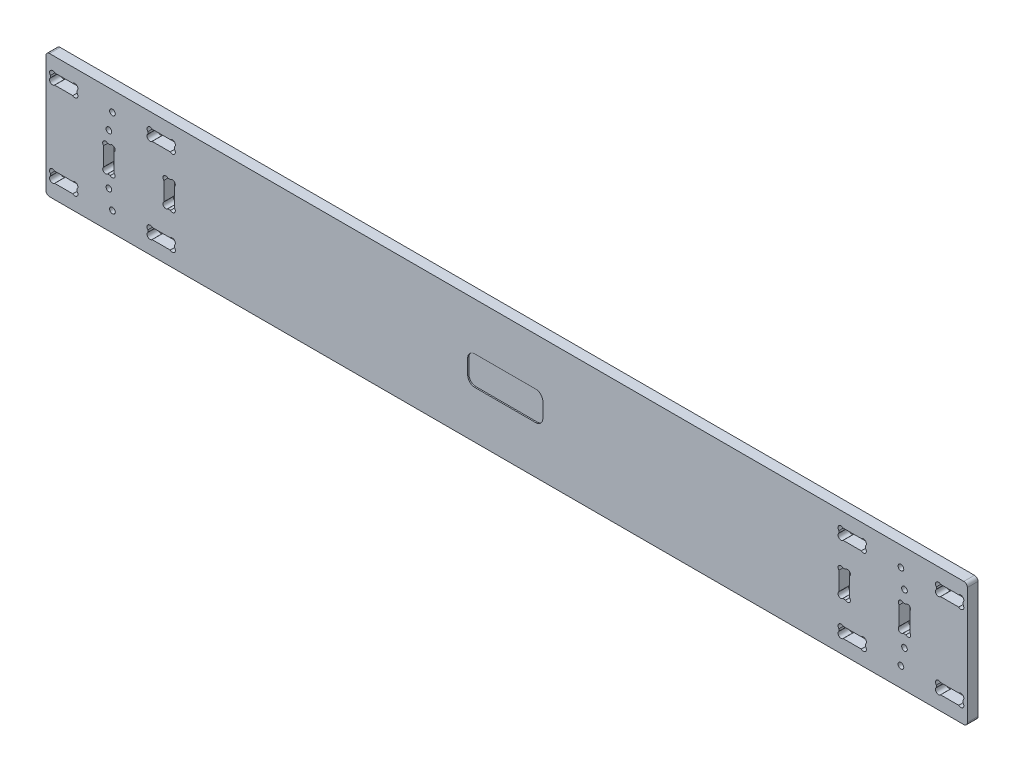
ISO-10303-21;
HEADER;
FILE_DESCRIPTION(('STEP AP214'),'2;1');
FILE_NAME('part.step','',(''),(''),'','','');
FILE_SCHEMA(('AUTOMOTIVE_DESIGN { 1 0 10303 214 1 1 1 1 }'));
ENDSEC;
DATA;
#1=APPLICATION_CONTEXT('core data for automotive mechanical design processes');
#2=APPLICATION_PROTOCOL_DEFINITION('international standard','automotive_design',2000,#1);
#3=PRODUCT_CONTEXT('',#1,'mechanical');
#4=PRODUCT('Part','Part','',(#3));
#5=PRODUCT_RELATED_PRODUCT_CATEGORY('part','',(#4));
#6=PRODUCT_DEFINITION_FORMATION('','',#4);
#7=PRODUCT_DEFINITION_CONTEXT('part definition',#1,'design');
#8=PRODUCT_DEFINITION('design','',#6,#7);
#9=PRODUCT_DEFINITION_SHAPE('','',#8);
#10=(LENGTH_UNIT() NAMED_UNIT(*) SI_UNIT(.MILLI.,.METRE.));
#11=(NAMED_UNIT(*) PLANE_ANGLE_UNIT() SI_UNIT($,.RADIAN.));
#12=(NAMED_UNIT(*) SI_UNIT($,.STERADIAN.) SOLID_ANGLE_UNIT());
#13=UNCERTAINTY_MEASURE_WITH_UNIT(LENGTH_MEASURE(1.E-05),#10,'distance_accuracy_value','');
#14=(GEOMETRIC_REPRESENTATION_CONTEXT(3) GLOBAL_UNCERTAINTY_ASSIGNED_CONTEXT((#13)) GLOBAL_UNIT_ASSIGNED_CONTEXT((#10,
#11,#12)) REPRESENTATION_CONTEXT('',''));
#15=CARTESIAN_POINT('',(0.,0.,0.));
#16=DIRECTION('',(0.,0.,1.));
#17=DIRECTION('',(1.,0.,0.));
#18=AXIS2_PLACEMENT_3D('',#15,#16,#17);
#19=CARTESIAN_POINT('',(55.5,-104.0000018,6.));
#20=DIRECTION('',(0.,0.,-1.));
#21=DIRECTION('',(-1.,0.,0.));
#22=AXIS2_PLACEMENT_3D('',#19,#20,#21);
#23=PLANE('',#22);
#24=DIRECTION('',(-1.,0.,0.));
#25=VECTOR('',#24,1.);
#26=CARTESIAN_POINT('',(-220.5,-128.8000018,6.));
#27=LINE('',#26,#25);
#28=CARTESIAN_POINT('',(-186.1,-128.8000018,6.));
#29=VERTEX_POINT('',#28);
#30=CARTESIAN_POINT('',(-220.5,-128.8000018,6.));
#31=VERTEX_POINT('',#30);
#32=EDGE_CURVE('E739',#29,#31,#27,.T.);
#33=ORIENTED_EDGE('',*,*,#32,.F.);
#34=CARTESIAN_POINT('',(-186.1,-132.8000018,6.));
#35=DIRECTION('',(0.,0.,1.));
#36=DIRECTION('',(-1.,0.,0.));
#37=AXIS2_PLACEMENT_3D('',#34,#35,#36);
#38=CIRCLE('',#37,4.00000000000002);
#39=CARTESIAN_POINT('',(-182.1,-132.8000018,6.));
#40=VERTEX_POINT('',#39);
#41=EDGE_CURVE('E50',#40,#29,#38,.T.);
#42=ORIENTED_EDGE('',*,*,#41,.F.);
#43=DIRECTION('',(0.,1.,0.));
#44=VECTOR('',#43,1.);
#45=CARTESIAN_POINT('',(-182.1,-132.8000018,6.));
#46=LINE('',#45,#44);
#47=CARTESIAN_POINT('',(-182.1,-141.2000018,6.));
#48=VERTEX_POINT('',#47);
#49=EDGE_CURVE('E760',#48,#40,#46,.T.);
#50=ORIENTED_EDGE('',*,*,#49,.F.);
#51=CARTESIAN_POINT('',(-186.1,-141.2000018,6.));
#52=DIRECTION('',(0.,0.,1.));
#53=DIRECTION('',(1.,0.,0.));
#54=AXIS2_PLACEMENT_3D('',#51,#52,#53);
#55=CIRCLE('',#54,4.);
#56=CARTESIAN_POINT('',(-186.1,-145.2000018,6.));
#57=VERTEX_POINT('',#56);
#58=EDGE_CURVE('E757',#57,#48,#55,.T.);
#59=ORIENTED_EDGE('',*,*,#58,.F.);
#60=DIRECTION('',(1.,0.,0.));
#61=VECTOR('',#60,1.);
#62=CARTESIAN_POINT('',(-220.5,-145.2000018,6.));
#63=LINE('',#62,#61);
#64=CARTESIAN_POINT('',(-220.5,-145.2000018,6.));
#65=VERTEX_POINT('',#64);
#66=EDGE_CURVE('E754',#65,#57,#63,.T.);
#67=ORIENTED_EDGE('',*,*,#66,.F.);
#68=CARTESIAN_POINT('',(-220.5,-141.2000018,6.));
#69=DIRECTION('',(0.,0.,1.));
#70=DIRECTION('',(1.,0.,0.));
#71=AXIS2_PLACEMENT_3D('',#68,#69,#70);
#72=CIRCLE('',#71,4.);
#73=CARTESIAN_POINT('',(-224.5,-141.2000018,6.));
#74=VERTEX_POINT('',#73);
#75=EDGE_CURVE('E748',#74,#65,#72,.T.);
#76=ORIENTED_EDGE('',*,*,#75,.F.);
#77=DIRECTION('',(0.,-1.,0.));
#78=VECTOR('',#77,1.);
#79=CARTESIAN_POINT('',(-224.5,-132.8000018,6.));
#80=LINE('',#79,#78);
#81=CARTESIAN_POINT('',(-224.5,-132.8000018,6.));
#82=VERTEX_POINT('',#81);
#83=EDGE_CURVE('E746',#82,#74,#80,.T.);
#84=ORIENTED_EDGE('',*,*,#83,.F.);
#85=CARTESIAN_POINT('',(-220.5,-132.8000018,6.));
#86=DIRECTION('',(0.,0.,1.));
#87=DIRECTION('',(1.,0.,0.));
#88=AXIS2_PLACEMENT_3D('',#85,#86,#87);
#89=CIRCLE('',#88,4.);
#90=EDGE_CURVE('E728',#31,#82,#89,.T.);
#91=ORIENTED_EDGE('',*,*,#90,.F.);
#92=EDGE_LOOP('',(#33,#42,#50,#59,#67,#76,#84,#91));
#93=FACE_BOUND('',#92,.T.);
#94=CARTESIAN_POINT('',(20.1,-130.6000018,6.));
#95=DIRECTION('',(0.,0.,1.));
#96=DIRECTION('',(-1.,0.,0.));
#97=AXIS2_PLACEMENT_3D('',#94,#95,#96);
#98=CIRCLE('',#97,1.60000000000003);
#99=CARTESIAN_POINT('',(21.2618950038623,-129.5000018,6.));
#100=VERTEX_POINT('',#99);
#101=CARTESIAN_POINT('',(19.,-131.761896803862,6.));
#102=VERTEX_POINT('',#101);
#103=EDGE_CURVE('E877',#100,#102,#98,.T.);
#104=ORIENTED_EDGE('',*,*,#103,.F.);
#105=DIRECTION('',(-1.,0.,0.));
#106=VECTOR('',#105,1.);
#107=CARTESIAN_POINT('',(22.7381049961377,-129.5000018,6.));
#108=LINE('',#107,#106);
#109=CARTESIAN_POINT('',(22.7381049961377,-129.5000018,6.));
#110=VERTEX_POINT('',#109);
#111=EDGE_CURVE('E892',#110,#100,#108,.T.);
#112=ORIENTED_EDGE('',*,*,#111,.F.);
#113=CARTESIAN_POINT('',(23.9,-130.6000018,6.));
#114=DIRECTION('',(0.,0.,1.));
#115=DIRECTION('',(-1.,0.,0.));
#116=AXIS2_PLACEMENT_3D('',#113,#114,#115);
#117=CIRCLE('',#116,1.60000000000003);
#118=CARTESIAN_POINT('',(25.,-131.761896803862,6.));
#119=VERTEX_POINT('',#118);
#120=EDGE_CURVE('E889',#119,#110,#117,.T.);
#121=ORIENTED_EDGE('',*,*,#120,.F.);
#122=DIRECTION('',(0.,1.,0.));
#123=VECTOR('',#122,1.);
#124=CARTESIAN_POINT('',(25.,-131.761896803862,6.));
#125=LINE('',#124,#123);
#126=CARTESIAN_POINT('',(25.,-142.238106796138,6.));
#127=VERTEX_POINT('',#126);
#128=EDGE_CURVE('E887',#127,#119,#125,.T.);
#129=ORIENTED_EDGE('',*,*,#128,.F.);
#130=CARTESIAN_POINT('',(23.9,-143.4000018,6.));
#131=DIRECTION('',(0.,0.,1.));
#132=DIRECTION('',(1.,0.,0.));
#133=AXIS2_PLACEMENT_3D('',#130,#131,#132);
#134=CIRCLE('',#133,1.60000000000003);
#135=CARTESIAN_POINT('',(22.7381049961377,-144.5000018,6.));
#136=VERTEX_POINT('',#135);
#137=EDGE_CURVE('E885',#136,#127,#134,.T.);
#138=ORIENTED_EDGE('',*,*,#137,.F.);
#139=DIRECTION('',(1.,0.,0.));
#140=VECTOR('',#139,1.);
#141=CARTESIAN_POINT('',(22.7381049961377,-144.5000018,6.));
#142=LINE('',#141,#140);
#143=CARTESIAN_POINT('',(21.2618950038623,-144.5000018,6.));
#144=VERTEX_POINT('',#143);
#145=EDGE_CURVE('E883',#144,#136,#142,.T.);
#146=ORIENTED_EDGE('',*,*,#145,.F.);
#147=CARTESIAN_POINT('',(20.1,-143.4000018,6.));
#148=DIRECTION('',(0.,0.,1.));
#149=DIRECTION('',(1.,0.,0.));
#150=AXIS2_PLACEMENT_3D('',#147,#148,#149);
#151=CIRCLE('',#150,1.60000000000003);
#152=CARTESIAN_POINT('',(19.,-142.238106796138,6.));
#153=VERTEX_POINT('',#152);
#154=EDGE_CURVE('E881',#153,#144,#151,.T.);
#155=ORIENTED_EDGE('',*,*,#154,.F.);
#156=DIRECTION('',(0.,-1.,0.));
#157=VECTOR('',#156,1.);
#158=CARTESIAN_POINT('',(19.,-142.238106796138,6.));
#159=LINE('',#158,#157);
#160=EDGE_CURVE('E879',#102,#153,#159,.T.);
#161=ORIENTED_EDGE('',*,*,#160,.F.);
#162=EDGE_LOOP('',(#104,#112,#121,#129,#138,#146,#155,#161));
#163=FACE_BOUND('',#162,.T.);
#164=CARTESIAN_POINT('',(-391.2,-114.79791847,6.));
#165=DIRECTION('',(0.,0.,1.));
#166=DIRECTION('',(1.,0.,0.));
#167=AXIS2_PLACEMENT_3D('',#164,#165,#166);
#168=CIRCLE('',#167,1.6999999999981);
#169=CARTESIAN_POINT('',(-392.402079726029,-116.0000018,6.));
#170=VERTEX_POINT('',#169);
#171=CARTESIAN_POINT('',(-390.,-113.593759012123,6.));
#172=VERTEX_POINT('',#171);
#173=EDGE_CURVE('E995',#170,#172,#168,.T.);
#174=ORIENTED_EDGE('',*,*,#173,.F.);
#175=DIRECTION('',(1.,0.,0.));
#176=VECTOR('',#175,1.);
#177=CARTESIAN_POINT('',(-392.402079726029,-116.0000018,6.));
#178=LINE('',#177,#176);
#179=CARTESIAN_POINT('',(-402.597920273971,-116.0000018,6.));
#180=VERTEX_POINT('',#179);
#181=EDGE_CURVE('E1010',#180,#170,#178,.T.);
#182=ORIENTED_EDGE('',*,*,#181,.F.);
#183=CARTESIAN_POINT('',(-403.8,-114.79791847,6.));
#184=DIRECTION('',(0.,0.,1.));
#185=DIRECTION('',(-1.,0.,0.));
#186=AXIS2_PLACEMENT_3D('',#183,#184,#185);
#187=CIRCLE('',#186,1.6999999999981);
#188=CARTESIAN_POINT('',(-405.,-113.593759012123,6.));
#189=VERTEX_POINT('',#188);
#190=EDGE_CURVE('E1007',#189,#180,#187,.T.);
#191=ORIENTED_EDGE('',*,*,#190,.F.);
#192=DIRECTION('',(0.,-1.,0.));
#193=VECTOR('',#192,1.);
#194=CARTESIAN_POINT('',(-405.,-112.406240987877,6.));
#195=LINE('',#194,#193);
#196=CARTESIAN_POINT('',(-405.,-112.406240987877,6.));
#197=VERTEX_POINT('',#196);
#198=EDGE_CURVE('E1005',#197,#189,#195,.T.);
#199=ORIENTED_EDGE('',*,*,#198,.F.);
#200=CARTESIAN_POINT('',(-403.8,-111.20208153,6.));
#201=DIRECTION('',(0.,0.,1.));
#202=DIRECTION('',(1.,0.,0.));
#203=AXIS2_PLACEMENT_3D('',#200,#201,#202);
#204=CIRCLE('',#203,1.6999999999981);
#205=CARTESIAN_POINT('',(-402.597918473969,-110.,6.));
#206=VERTEX_POINT('',#205);
#207=EDGE_CURVE('E1003',#206,#197,#204,.T.);
#208=ORIENTED_EDGE('',*,*,#207,.F.);
#209=DIRECTION('',(-1.,0.,0.));
#210=VECTOR('',#209,1.);
#211=CARTESIAN_POINT('',(-392.402081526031,-110.,6.));
#212=LINE('',#211,#210);
#213=CARTESIAN_POINT('',(-392.402081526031,-110.,6.));
#214=VERTEX_POINT('',#213);
#215=EDGE_CURVE('E1001',#214,#206,#212,.T.);
#216=ORIENTED_EDGE('',*,*,#215,.F.);
#217=CARTESIAN_POINT('',(-391.2,-111.20208153,6.));
#218=DIRECTION('',(0.,0.,1.));
#219=DIRECTION('',(-1.,0.,0.));
#220=AXIS2_PLACEMENT_3D('',#217,#218,#219);
#221=CIRCLE('',#220,1.6999999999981);
#222=CARTESIAN_POINT('',(-390.,-112.406240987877,6.));
#223=VERTEX_POINT('',#222);
#224=EDGE_CURVE('E999',#223,#214,#221,.T.);
#225=ORIENTED_EDGE('',*,*,#224,.F.);
#226=DIRECTION('',(0.,1.,0.));
#227=VECTOR('',#226,1.);
#228=CARTESIAN_POINT('',(-390.,-112.406240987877,6.));
#229=LINE('',#228,#227);
#230=EDGE_CURVE('E997',#172,#223,#229,.T.);
#231=ORIENTED_EDGE('',*,*,#230,.F.);
#232=EDGE_LOOP('',(#174,#182,#191,#199,#208,#216,#225,#231));
#233=FACE_BOUND('',#232,.T.);
#234=CARTESIAN_POINT('',(-458.8,-159.20208513,6.));
#235=DIRECTION('',(0.,0.,1.));
#236=DIRECTION('',(1.,0.,0.));
#237=AXIS2_PLACEMENT_3D('',#234,#235,#236);
#238=CIRCLE('',#237,1.69999999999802);
#239=CARTESIAN_POINT('',(-457.597920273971,-158.0000018,6.));
#240=VERTEX_POINT('',#239);
#241=CARTESIAN_POINT('',(-460.,-160.406244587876,6.));
#242=VERTEX_POINT('',#241);
#243=EDGE_CURVE('E1113',#240,#242,#238,.T.);
#244=ORIENTED_EDGE('',*,*,#243,.F.);
#245=DIRECTION('',(-1.,0.,0.));
#246=VECTOR('',#245,1.);
#247=CARTESIAN_POINT('',(-457.597920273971,-158.0000018,6.));
#248=LINE('',#247,#246);
#249=CARTESIAN_POINT('',(-447.402079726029,-158.0000018,6.));
#250=VERTEX_POINT('',#249);
#251=EDGE_CURVE('E1128',#250,#240,#248,.T.);
#252=ORIENTED_EDGE('',*,*,#251,.F.);
#253=CARTESIAN_POINT('',(-446.2,-159.20208513,6.));
#254=DIRECTION('',(0.,0.,1.));
#255=DIRECTION('',(-1.,0.,0.));
#256=AXIS2_PLACEMENT_3D('',#253,#254,#255);
#257=CIRCLE('',#256,1.69999999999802);
#258=CARTESIAN_POINT('',(-445.,-160.406244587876,6.));
#259=VERTEX_POINT('',#258);
#260=EDGE_CURVE('E1125',#259,#250,#257,.T.);
#261=ORIENTED_EDGE('',*,*,#260,.F.);
#262=DIRECTION('',(0.,1.,0.));
#263=VECTOR('',#262,1.);
#264=CARTESIAN_POINT('',(-445.,-161.593762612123,6.));
#265=LINE('',#264,#263);
#266=CARTESIAN_POINT('',(-445.,-161.593762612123,6.));
#267=VERTEX_POINT('',#266);
#268=EDGE_CURVE('E1123',#267,#259,#265,.T.);
#269=ORIENTED_EDGE('',*,*,#268,.F.);
#270=CARTESIAN_POINT('',(-446.2,-162.79792207,6.));
#271=DIRECTION('',(0.,0.,1.));
#272=DIRECTION('',(1.,0.,0.));
#273=AXIS2_PLACEMENT_3D('',#270,#271,#272);
#274=CIRCLE('',#273,1.69999999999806);
#275=CARTESIAN_POINT('',(-447.402081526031,-164.0000036,6.));
#276=VERTEX_POINT('',#275);
#277=EDGE_CURVE('E1121',#276,#267,#274,.T.);
#278=ORIENTED_EDGE('',*,*,#277,.F.);
#279=DIRECTION('',(1.,0.,0.));
#280=VECTOR('',#279,1.);
#281=CARTESIAN_POINT('',(-457.597918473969,-164.0000036,6.));
#282=LINE('',#281,#280);
#283=CARTESIAN_POINT('',(-457.597918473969,-164.0000036,6.));
#284=VERTEX_POINT('',#283);
#285=EDGE_CURVE('E1119',#284,#276,#282,.T.);
#286=ORIENTED_EDGE('',*,*,#285,.F.);
#287=CARTESIAN_POINT('',(-458.8,-162.79792207,6.));
#288=DIRECTION('',(0.,0.,1.));
#289=DIRECTION('',(-1.,0.,0.));
#290=AXIS2_PLACEMENT_3D('',#287,#288,#289);
#291=CIRCLE('',#290,1.69999999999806);
#292=CARTESIAN_POINT('',(-460.,-161.593762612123,6.));
#293=VERTEX_POINT('',#292);
#294=EDGE_CURVE('E1117',#293,#284,#291,.T.);
#295=ORIENTED_EDGE('',*,*,#294,.F.);
#296=DIRECTION('',(0.,-1.,0.));
#297=VECTOR('',#296,1.);
#298=CARTESIAN_POINT('',(-460.,-161.593762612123,6.));
#299=LINE('',#298,#297);
#300=EDGE_CURVE('E1115',#242,#293,#299,.T.);
#301=ORIENTED_EDGE('',*,*,#300,.F.);
#302=EDGE_LOOP('',(#244,#252,#261,#269,#278,#286,#295,#301));
#303=FACE_BOUND('',#302,.T.);
#304=CARTESIAN_POINT('',(20.,-113.0000018,6.));
#305=DIRECTION('',(0.,0.,1.));
#306=DIRECTION('',(1.,0.,0.));
#307=AXIS2_PLACEMENT_3D('',#304,#305,#306);
#308=CIRCLE('',#307,1.60000000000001);
#309=CARTESIAN_POINT('',(21.6,-113.0000018,6.));
#310=VERTEX_POINT('',#309);
#311=EDGE_CURVE('E1157',#310,#310,#308,.T.);
#312=ORIENTED_EDGE('',*,*,#311,.F.);
#313=EDGE_LOOP('',(#312));
#314=FACE_BOUND('',#313,.T.);
#315=CARTESIAN_POINT('',(53.8,-162.79792207,6.));
#316=DIRECTION('',(0.,0.,1.));
#317=DIRECTION('',(1.,0.,0.));
#318=AXIS2_PLACEMENT_3D('',#315,#316,#317);
#319=CIRCLE('',#318,1.69999999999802);
#320=CARTESIAN_POINT('',(52.5979184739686,-164.0000036,6.));
#321=VERTEX_POINT('',#320);
#322=CARTESIAN_POINT('',(55.,-161.593762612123,6.));
#323=VERTEX_POINT('',#322);
#324=EDGE_CURVE('E1243',#321,#323,#319,.T.);
#325=ORIENTED_EDGE('',*,*,#324,.F.);
#326=DIRECTION('',(1.,0.,0.));
#327=VECTOR('',#326,1.);
#328=CARTESIAN_POINT('',(52.5979184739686,-164.0000036,6.));
#329=LINE('',#328,#327);
#330=CARTESIAN_POINT('',(42.4020815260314,-164.0000036,6.));
#331=VERTEX_POINT('',#330);
#332=EDGE_CURVE('E1258',#331,#321,#329,.T.);
#333=ORIENTED_EDGE('',*,*,#332,.F.);
#334=CARTESIAN_POINT('',(41.2,-162.79792207,6.));
#335=DIRECTION('',(0.,0.,1.));
#336=DIRECTION('',(-1.,0.,0.));
#337=AXIS2_PLACEMENT_3D('',#334,#335,#336);
#338=CIRCLE('',#337,1.69999999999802);
#339=CARTESIAN_POINT('',(40.,-161.593762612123,6.));
#340=VERTEX_POINT('',#339);
#341=EDGE_CURVE('E1255',#340,#331,#338,.T.);
#342=ORIENTED_EDGE('',*,*,#341,.F.);
#343=DIRECTION('',(0.,-1.,0.));
#344=VECTOR('',#343,1.);
#345=CARTESIAN_POINT('',(40.,-161.593762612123,6.));
#346=LINE('',#345,#344);
#347=CARTESIAN_POINT('',(40.,-160.406244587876,6.));
#348=VERTEX_POINT('',#347);
#349=EDGE_CURVE('E1253',#348,#340,#346,.T.);
#350=ORIENTED_EDGE('',*,*,#349,.F.);
#351=CARTESIAN_POINT('',(41.2,-159.20208513,6.));
#352=DIRECTION('',(0.,0.,1.));
#353=DIRECTION('',(1.,0.,0.));
#354=AXIS2_PLACEMENT_3D('',#351,#352,#353);
#355=CIRCLE('',#354,1.69999999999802);
#356=CARTESIAN_POINT('',(42.4020797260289,-158.0000018,6.));
#357=VERTEX_POINT('',#356);
#358=EDGE_CURVE('E1251',#357,#348,#355,.T.);
#359=ORIENTED_EDGE('',*,*,#358,.F.);
#360=DIRECTION('',(-1.,0.,0.));
#361=VECTOR('',#360,1.);
#362=CARTESIAN_POINT('',(52.5979202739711,-158.0000018,6.));
#363=LINE('',#362,#361);
#364=CARTESIAN_POINT('',(52.5979202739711,-158.0000018,6.));
#365=VERTEX_POINT('',#364);
#366=EDGE_CURVE('E1249',#365,#357,#363,.T.);
#367=ORIENTED_EDGE('',*,*,#366,.F.);
#368=CARTESIAN_POINT('',(53.8,-159.20208513,6.));
#369=DIRECTION('',(0.,0.,1.));
#370=DIRECTION('',(-1.,0.,0.));
#371=AXIS2_PLACEMENT_3D('',#368,#369,#370);
#372=CIRCLE('',#371,1.69999999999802);
#373=CARTESIAN_POINT('',(55.,-160.406244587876,6.));
#374=VERTEX_POINT('',#373);
#375=EDGE_CURVE('E1247',#374,#365,#372,.T.);
#376=ORIENTED_EDGE('',*,*,#375,.F.);
#377=DIRECTION('',(0.,1.,0.));
#378=VECTOR('',#377,1.);
#379=CARTESIAN_POINT('',(55.,-161.593762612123,6.));
#380=LINE('',#379,#378);
#381=EDGE_CURVE('E1245',#323,#374,#380,.T.);
#382=ORIENTED_EDGE('',*,*,#381,.F.);
#383=EDGE_LOOP('',(#325,#333,#342,#350,#359,#367,#376,#382));
#384=FACE_BOUND('',#383,.T.);
#385=CARTESIAN_POINT('',(-13.8,-114.79791847,6.));
#386=DIRECTION('',(0.,0.,1.));
#387=DIRECTION('',(-1.,0.,0.));
#388=AXIS2_PLACEMENT_3D('',#385,#386,#387);
#389=CIRCLE('',#388,1.6999999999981);
#390=CARTESIAN_POINT('',(-15.,-113.593759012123,6.));
#391=VERTEX_POINT('',#390);
#392=CARTESIAN_POINT('',(-12.5979202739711,-116.0000018,6.));
#393=VERTEX_POINT('',#392);
#394=EDGE_CURVE('E1361',#391,#393,#389,.T.);
#395=ORIENTED_EDGE('',*,*,#394,.F.);
#396=DIRECTION('',(0.,-1.,0.));
#397=VECTOR('',#396,1.);
#398=CARTESIAN_POINT('',(-15.,-112.406240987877,6.));
#399=LINE('',#398,#397);
#400=CARTESIAN_POINT('',(-15.,-112.406240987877,6.));
#401=VERTEX_POINT('',#400);
#402=EDGE_CURVE('E1376',#401,#391,#399,.T.);
#403=ORIENTED_EDGE('',*,*,#402,.F.);
#404=CARTESIAN_POINT('',(-13.8,-111.20208153,6.));
#405=DIRECTION('',(0.,0.,1.));
#406=DIRECTION('',(1.,0.,0.));
#407=AXIS2_PLACEMENT_3D('',#404,#405,#406);
#408=CIRCLE('',#407,1.69999999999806);
#409=CARTESIAN_POINT('',(-12.5979184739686,-110.,6.));
#410=VERTEX_POINT('',#409);
#411=EDGE_CURVE('E1373',#410,#401,#408,.T.);
#412=ORIENTED_EDGE('',*,*,#411,.F.);
#413=DIRECTION('',(-1.,0.,0.));
#414=VECTOR('',#413,1.);
#415=CARTESIAN_POINT('',(-12.5979184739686,-110.,6.));
#416=LINE('',#415,#414);
#417=CARTESIAN_POINT('',(-2.4020815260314,-110.,6.));
#418=VERTEX_POINT('',#417);
#419=EDGE_CURVE('E1371',#418,#410,#416,.T.);
#420=ORIENTED_EDGE('',*,*,#419,.F.);
#421=CARTESIAN_POINT('',(-1.19999999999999,-111.20208153,6.));
#422=DIRECTION('',(0.,0.,1.));
#423=DIRECTION('',(-1.,0.,0.));
#424=AXIS2_PLACEMENT_3D('',#421,#422,#423);
#425=CIRCLE('',#424,1.69999999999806);
#426=CARTESIAN_POINT('',(0.,-112.406240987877,6.));
#427=VERTEX_POINT('',#426);
#428=EDGE_CURVE('E1369',#427,#418,#425,.T.);
#429=ORIENTED_EDGE('',*,*,#428,.F.);
#430=DIRECTION('',(0.,1.,0.));
#431=VECTOR('',#430,1.);
#432=CARTESIAN_POINT('',(0.,-112.406240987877,6.));
#433=LINE('',#432,#431);
#434=CARTESIAN_POINT('',(0.,-113.593759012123,6.));
#435=VERTEX_POINT('',#434);
#436=EDGE_CURVE('E1367',#435,#427,#433,.T.);
#437=ORIENTED_EDGE('',*,*,#436,.F.);
#438=CARTESIAN_POINT('',(-1.19999999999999,-114.79791847,6.));
#439=DIRECTION('',(0.,0.,1.));
#440=DIRECTION('',(1.,0.,0.));
#441=AXIS2_PLACEMENT_3D('',#438,#439,#440);
#442=CIRCLE('',#441,1.6999999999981);
#443=CARTESIAN_POINT('',(-2.40207972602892,-116.0000018,6.));
#444=VERTEX_POINT('',#443);
#445=EDGE_CURVE('E1365',#444,#435,#442,.T.);
#446=ORIENTED_EDGE('',*,*,#445,.F.);
#447=DIRECTION('',(1.,0.,0.));
#448=VECTOR('',#447,1.);
#449=CARTESIAN_POINT('',(-12.5979202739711,-116.0000018,6.));
#450=LINE('',#449,#448);
#451=EDGE_CURVE('E1363',#393,#444,#450,.T.);
#452=ORIENTED_EDGE('',*,*,#451,.F.);
#453=EDGE_LOOP('',(#395,#403,#412,#420,#429,#437,#446,#452));
#454=FACE_BOUND('',#453,.T.);
#455=CARTESIAN_POINT('',(-427.,-122.7500018,6.));
#456=DIRECTION('',(0.,0.,1.));
#457=DIRECTION('',(-1.,0.,0.));
#458=AXIS2_PLACEMENT_3D('',#455,#456,#457);
#459=CIRCLE('',#458,1.59999999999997);
#460=CARTESIAN_POINT('',(-428.6,-122.7500018,6.));
#461=VERTEX_POINT('',#460);
#462=EDGE_CURVE('E1405',#461,#461,#459,.T.);
#463=ORIENTED_EDGE('',*,*,#462,.F.);
#464=EDGE_LOOP('',(#463));
#465=FACE_BOUND('',#464,.T.);
#466=CARTESIAN_POINT('',(-425.,-161.0000018,6.));
#467=DIRECTION('',(0.,0.,1.));
#468=DIRECTION('',(1.,0.,0.));
#469=AXIS2_PLACEMENT_3D('',#466,#467,#468);
#470=CIRCLE('',#469,1.60000000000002);
#471=CARTESIAN_POINT('',(-423.4,-161.0000018,6.));
#472=VERTEX_POINT('',#471);
#473=EDGE_CURVE('E1417',#472,#472,#470,.T.);
#474=ORIENTED_EDGE('',*,*,#473,.F.);
#475=EDGE_LOOP('',(#474));
#476=FACE_BOUND('',#475,.T.);
#477=CARTESIAN_POINT('',(22.,-122.7500018,6.));
#478=DIRECTION('',(0.,0.,1.));
#479=DIRECTION('',(1.,0.,0.));
#480=AXIS2_PLACEMENT_3D('',#477,#478,#479);
#481=CIRCLE('',#480,1.6);
#482=CARTESIAN_POINT('',(23.6,-122.7500018,6.));
#483=VERTEX_POINT('',#482);
#484=EDGE_CURVE('E1429',#483,#483,#481,.T.);
#485=ORIENTED_EDGE('',*,*,#484,.F.);
#486=EDGE_LOOP('',(#485));
#487=FACE_BOUND('',#486,.T.);
#488=CARTESIAN_POINT('',(-13.9,-130.6000018,6.));
#489=DIRECTION('',(0.,0.,1.));
#490=DIRECTION('',(-1.,0.,0.));
#491=AXIS2_PLACEMENT_3D('',#488,#489,#490);
#492=CIRCLE('',#491,1.60000000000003);
#493=CARTESIAN_POINT('',(-12.7381049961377,-129.5000018,6.));
#494=VERTEX_POINT('',#493);
#495=CARTESIAN_POINT('',(-15.,-131.761896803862,6.));
#496=VERTEX_POINT('',#495);
#497=EDGE_CURVE('E1515',#494,#496,#492,.T.);
#498=ORIENTED_EDGE('',*,*,#497,.F.);
#499=DIRECTION('',(-1.,0.,0.));
#500=VECTOR('',#499,1.);
#501=CARTESIAN_POINT('',(-11.2618950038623,-129.5000018,6.));
#502=LINE('',#501,#500);
#503=CARTESIAN_POINT('',(-11.2618950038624,-129.5000018,6.));
#504=VERTEX_POINT('',#503);
#505=EDGE_CURVE('E1530',#504,#494,#502,.T.);
#506=ORIENTED_EDGE('',*,*,#505,.F.);
#507=CARTESIAN_POINT('',(-10.1,-130.6000018,6.));
#508=DIRECTION('',(0.,0.,1.));
#509=DIRECTION('',(-1.,0.,0.));
#510=AXIS2_PLACEMENT_3D('',#507,#508,#509);
#511=CIRCLE('',#510,1.60000000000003);
#512=CARTESIAN_POINT('',(-9.00000000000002,-131.761896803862,6.));
#513=VERTEX_POINT('',#512);
#514=EDGE_CURVE('E1527',#513,#504,#511,.T.);
#515=ORIENTED_EDGE('',*,*,#514,.F.);
#516=DIRECTION('',(0.,1.,0.));
#517=VECTOR('',#516,1.);
#518=CARTESIAN_POINT('',(-9.00000000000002,-131.761896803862,6.));
#519=LINE('',#518,#517);
#520=CARTESIAN_POINT('',(-9.00000000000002,-142.238106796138,6.));
#521=VERTEX_POINT('',#520);
#522=EDGE_CURVE('E1525',#521,#513,#519,.T.);
#523=ORIENTED_EDGE('',*,*,#522,.F.);
#524=CARTESIAN_POINT('',(-10.1,-143.4000018,6.));
#525=DIRECTION('',(0.,0.,1.));
#526=DIRECTION('',(1.,0.,0.));
#527=AXIS2_PLACEMENT_3D('',#524,#525,#526);
#528=CIRCLE('',#527,1.60000000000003);
#529=CARTESIAN_POINT('',(-11.2618950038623,-144.5000018,6.));
#530=VERTEX_POINT('',#529);
#531=EDGE_CURVE('E1523',#530,#521,#528,.T.);
#532=ORIENTED_EDGE('',*,*,#531,.F.);
#533=DIRECTION('',(1.,0.,0.));
#534=VECTOR('',#533,1.);
#535=CARTESIAN_POINT('',(-11.2618950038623,-144.5000018,6.));
#536=LINE('',#535,#534);
#537=CARTESIAN_POINT('',(-12.7381049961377,-144.5000018,6.));
#538=VERTEX_POINT('',#537);
#539=EDGE_CURVE('E1521',#538,#530,#536,.T.);
#540=ORIENTED_EDGE('',*,*,#539,.F.);
#541=CARTESIAN_POINT('',(-13.9,-143.4000018,6.));
#542=DIRECTION('',(0.,0.,1.));
#543=DIRECTION('',(1.,0.,0.));
#544=AXIS2_PLACEMENT_3D('',#541,#542,#543);
#545=CIRCLE('',#544,1.60000000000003);
#546=CARTESIAN_POINT('',(-15.,-142.238106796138,6.));
#547=VERTEX_POINT('',#546);
#548=EDGE_CURVE('E1519',#547,#538,#545,.T.);
#549=ORIENTED_EDGE('',*,*,#548,.F.);
#550=DIRECTION('',(0.,-1.,0.));
#551=VECTOR('',#550,1.);
#552=CARTESIAN_POINT('',(-15.,-142.238106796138,6.));
#553=LINE('',#552,#551);
#554=EDGE_CURVE('E1517',#496,#547,#553,.T.);
#555=ORIENTED_EDGE('',*,*,#554,.F.);
#556=EDGE_LOOP('',(#498,#506,#515,#523,#532,#540,#549,#555));
#557=FACE_BOUND('',#556,.T.);
#558=CARTESIAN_POINT('',(55.5,-104.0000018,6.));
#559=DIRECTION('',(0.,0.,1.));
#560=DIRECTION('',(-1.,0.,0.));
#561=AXIS2_PLACEMENT_3D('',#558,#559,#560);
#562=CIRCLE('',#561,2.);
#563=CARTESIAN_POINT('',(57.5,-104.0000018,6.));
#564=VERTEX_POINT('',#563);
#565=CARTESIAN_POINT('',(55.5,-102.0000018,6.));
#566=VERTEX_POINT('',#565);
#567=EDGE_CURVE('E1567',#564,#566,#562,.T.);
#568=ORIENTED_EDGE('',*,*,#567,.T.);
#569=DIRECTION('',(-1.,0.,0.));
#570=VECTOR('',#569,1.);
#571=CARTESIAN_POINT('',(-460.5,-102.0000018,6.));
#572=LINE('',#571,#570);
#573=CARTESIAN_POINT('',(-460.5,-102.0000018,6.));
#574=VERTEX_POINT('',#573);
#575=EDGE_CURVE('E1570',#566,#574,#572,.T.);
#576=ORIENTED_EDGE('',*,*,#575,.T.);
#577=CARTESIAN_POINT('',(-460.5,-104.0000018,6.));
#578=DIRECTION('',(0.,0.,1.));
#579=DIRECTION('',(-1.,0.,0.));
#580=AXIS2_PLACEMENT_3D('',#577,#578,#579);
#581=CIRCLE('',#580,2.);
#582=CARTESIAN_POINT('',(-462.5,-104.0000018,6.));
#583=VERTEX_POINT('',#582);
#584=EDGE_CURVE('E1572',#574,#583,#581,.T.);
#585=ORIENTED_EDGE('',*,*,#584,.T.);
#586=DIRECTION('',(0.,-1.,0.));
#587=VECTOR('',#586,1.);
#588=CARTESIAN_POINT('',(-462.5,-104.0000018,6.));
#589=LINE('',#588,#587);
#590=CARTESIAN_POINT('',(-462.5,-170.0000018,6.));
#591=VERTEX_POINT('',#590);
#592=EDGE_CURVE('E1574',#583,#591,#589,.T.);
#593=ORIENTED_EDGE('',*,*,#592,.T.);
#594=CARTESIAN_POINT('',(-460.5,-170.0000018,6.));
#595=DIRECTION('',(0.,0.,1.));
#596=DIRECTION('',(1.,0.,0.));
#597=AXIS2_PLACEMENT_3D('',#594,#595,#596);
#598=CIRCLE('',#597,2.);
#599=CARTESIAN_POINT('',(-460.5,-172.0000018,6.));
#600=VERTEX_POINT('',#599);
#601=EDGE_CURVE('E1576',#591,#600,#598,.T.);
#602=ORIENTED_EDGE('',*,*,#601,.T.);
#603=DIRECTION('',(1.,0.,0.));
#604=VECTOR('',#603,1.);
#605=CARTESIAN_POINT('',(-460.5,-172.0000018,6.));
#606=LINE('',#605,#604);
#607=CARTESIAN_POINT('',(55.5,-172.0000018,6.));
#608=VERTEX_POINT('',#607);
#609=EDGE_CURVE('E1578',#600,#608,#606,.T.);
#610=ORIENTED_EDGE('',*,*,#609,.T.);
#611=CARTESIAN_POINT('',(55.5,-170.0000018,6.));
#612=DIRECTION('',(0.,0.,1.));
#613=DIRECTION('',(1.,0.,0.));
#614=AXIS2_PLACEMENT_3D('',#611,#612,#613);
#615=CIRCLE('',#614,2.);
#616=CARTESIAN_POINT('',(57.5,-170.0000018,6.));
#617=VERTEX_POINT('',#616);
#618=EDGE_CURVE('E1580',#608,#617,#615,.T.);
#619=ORIENTED_EDGE('',*,*,#618,.T.);
#620=DIRECTION('',(0.,1.,0.));
#621=VECTOR('',#620,1.);
#622=CARTESIAN_POINT('',(57.5,-104.0000018,6.));
#623=LINE('',#622,#621);
#624=EDGE_CURVE('E1582',#617,#564,#623,.T.);
#625=ORIENTED_EDGE('',*,*,#624,.T.);
#626=EDGE_LOOP('',(#568,#576,#585,#593,#602,#610,#619,#625));
#627=FACE_BOUND('',#626,.T.);
#628=CARTESIAN_POINT('',(-394.9,-130.6000018,6.));
#629=DIRECTION('',(0.,0.,1.));
#630=DIRECTION('',(1.,0.,0.));
#631=AXIS2_PLACEMENT_3D('',#628,#629,#630);
#632=CIRCLE('',#631,1.6);
#633=CARTESIAN_POINT('',(-393.738104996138,-129.5000018,6.));
#634=VERTEX_POINT('',#633);
#635=CARTESIAN_POINT('',(-396.,-131.761896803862,6.));
#636=VERTEX_POINT('',#635);
#637=EDGE_CURVE('E1456',#634,#636,#632,.T.);
#638=ORIENTED_EDGE('',*,*,#637,.F.);
#639=DIRECTION('',(-1.,0.,0.));
#640=VECTOR('',#639,1.);
#641=CARTESIAN_POINT('',(-393.738104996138,-129.5000018,6.));
#642=LINE('',#641,#640);
#643=CARTESIAN_POINT('',(-392.261895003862,-129.5000018,6.));
#644=VERTEX_POINT('',#643);
#645=EDGE_CURVE('E1471',#644,#634,#642,.T.);
#646=ORIENTED_EDGE('',*,*,#645,.F.);
#647=CARTESIAN_POINT('',(-391.1,-130.6000018,6.));
#648=DIRECTION('',(0.,0.,1.));
#649=DIRECTION('',(1.,0.,0.));
#650=AXIS2_PLACEMENT_3D('',#647,#648,#649);
#651=CIRCLE('',#650,1.60000000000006);
#652=CARTESIAN_POINT('',(-390.,-131.761896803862,6.));
#653=VERTEX_POINT('',#652);
#654=EDGE_CURVE('E1468',#653,#644,#651,.T.);
#655=ORIENTED_EDGE('',*,*,#654,.F.);
#656=DIRECTION('',(0.,1.,0.));
#657=VECTOR('',#656,1.);
#658=CARTESIAN_POINT('',(-390.,-142.238106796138,6.));
#659=LINE('',#658,#657);
#660=CARTESIAN_POINT('',(-390.,-142.238106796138,6.));
#661=VERTEX_POINT('',#660);
#662=EDGE_CURVE('E1466',#661,#653,#659,.T.);
#663=ORIENTED_EDGE('',*,*,#662,.F.);
#664=CARTESIAN_POINT('',(-391.1,-143.4000018,6.));
#665=DIRECTION('',(0.,0.,1.));
#666=DIRECTION('',(-1.,0.,0.));
#667=AXIS2_PLACEMENT_3D('',#664,#665,#666);
#668=CIRCLE('',#667,1.60000000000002);
#669=CARTESIAN_POINT('',(-392.261895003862,-144.5000018,6.));
#670=VERTEX_POINT('',#669);
#671=EDGE_CURVE('E1464',#670,#661,#668,.T.);
#672=ORIENTED_EDGE('',*,*,#671,.F.);
#673=DIRECTION('',(1.,0.,0.));
#674=VECTOR('',#673,1.);
#675=CARTESIAN_POINT('',(-393.738104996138,-144.5000018,6.));
#676=LINE('',#675,#674);
#677=CARTESIAN_POINT('',(-393.738104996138,-144.5000018,6.));
#678=VERTEX_POINT('',#677);
#679=EDGE_CURVE('E1462',#678,#670,#676,.T.);
#680=ORIENTED_EDGE('',*,*,#679,.F.);
#681=CARTESIAN_POINT('',(-394.9,-143.4000018,6.));
#682=DIRECTION('',(0.,0.,1.));
#683=DIRECTION('',(-1.,0.,0.));
#684=AXIS2_PLACEMENT_3D('',#681,#682,#683);
#685=CIRCLE('',#684,1.60000000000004);
#686=CARTESIAN_POINT('',(-396.,-142.238106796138,6.));
#687=VERTEX_POINT('',#686);
#688=EDGE_CURVE('E1460',#687,#678,#685,.T.);
#689=ORIENTED_EDGE('',*,*,#688,.F.);
#690=DIRECTION('',(0.,-1.,0.));
#691=VECTOR('',#690,1.);
#692=CARTESIAN_POINT('',(-396.,-131.761896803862,6.));
#693=LINE('',#692,#691);
#694=EDGE_CURVE('E1458',#636,#687,#693,.T.);
#695=ORIENTED_EDGE('',*,*,#694,.F.);
#696=EDGE_LOOP('',(#638,#646,#655,#663,#672,#680,#689,#695));
#697=FACE_BOUND('',#696,.T.);
#698=CARTESIAN_POINT('',(22.,-151.2500018,6.));
#699=DIRECTION('',(0.,0.,1.));
#700=DIRECTION('',(-1.,0.,0.));
#701=AXIS2_PLACEMENT_3D('',#698,#699,#700);
#702=CIRCLE('',#701,1.60000000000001);
#703=CARTESIAN_POINT('',(20.4,-151.2500018,6.));
#704=VERTEX_POINT('',#703);
#705=EDGE_CURVE('E1423',#704,#704,#702,.T.);
#706=ORIENTED_EDGE('',*,*,#705,.F.);
#707=EDGE_LOOP('',(#706));
#708=FACE_BOUND('',#707,.T.);
#709=CARTESIAN_POINT('',(-427.,-151.2500018,6.));
#710=DIRECTION('',(0.,0.,1.));
#711=DIRECTION('',(1.,0.,0.));
#712=AXIS2_PLACEMENT_3D('',#709,#710,#711);
#713=CIRCLE('',#712,1.59999999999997);
#714=CARTESIAN_POINT('',(-425.4,-151.2500018,6.));
#715=VERTEX_POINT('',#714);
#716=EDGE_CURVE('E1411',#715,#715,#713,.T.);
#717=ORIENTED_EDGE('',*,*,#716,.F.);
#718=EDGE_LOOP('',(#717));
#719=FACE_BOUND('',#718,.T.);
#720=CARTESIAN_POINT('',(-425.,-113.0000018,6.));
#721=DIRECTION('',(0.,0.,1.));
#722=DIRECTION('',(-1.,0.,0.));
#723=AXIS2_PLACEMENT_3D('',#720,#721,#722);
#724=CIRCLE('',#723,1.59999999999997);
#725=CARTESIAN_POINT('',(-426.6,-113.0000018,6.));
#726=VERTEX_POINT('',#725);
#727=EDGE_CURVE('E1399',#726,#726,#724,.T.);
#728=ORIENTED_EDGE('',*,*,#727,.F.);
#729=EDGE_LOOP('',(#728));
#730=FACE_BOUND('',#729,.T.);
#731=CARTESIAN_POINT('',(53.8,-114.79791847,6.));
#732=DIRECTION('',(0.,0.,1.));
#733=DIRECTION('',(1.,0.,0.));
#734=AXIS2_PLACEMENT_3D('',#731,#732,#733);
#735=CIRCLE('',#734,1.6999999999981);
#736=CARTESIAN_POINT('',(52.5979202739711,-116.0000018,6.));
#737=VERTEX_POINT('',#736);
#738=CARTESIAN_POINT('',(55.,-113.593759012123,6.));
#739=VERTEX_POINT('',#738);
#740=EDGE_CURVE('E1302',#737,#739,#735,.T.);
#741=ORIENTED_EDGE('',*,*,#740,.F.);
#742=DIRECTION('',(1.,0.,0.));
#743=VECTOR('',#742,1.);
#744=CARTESIAN_POINT('',(52.5979202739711,-116.0000018,6.));
#745=LINE('',#744,#743);
#746=CARTESIAN_POINT('',(42.4020797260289,-116.0000018,6.));
#747=VERTEX_POINT('',#746);
#748=EDGE_CURVE('E1317',#747,#737,#745,.T.);
#749=ORIENTED_EDGE('',*,*,#748,.F.);
#750=CARTESIAN_POINT('',(41.2,-114.79791847,6.));
#751=DIRECTION('',(0.,0.,1.));
#752=DIRECTION('',(-1.,0.,0.));
#753=AXIS2_PLACEMENT_3D('',#750,#751,#752);
#754=CIRCLE('',#753,1.6999999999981);
#755=CARTESIAN_POINT('',(40.,-113.593759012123,6.));
#756=VERTEX_POINT('',#755);
#757=EDGE_CURVE('E1314',#756,#747,#754,.T.);
#758=ORIENTED_EDGE('',*,*,#757,.F.);
#759=DIRECTION('',(0.,-1.,0.));
#760=VECTOR('',#759,1.);
#761=CARTESIAN_POINT('',(40.,-112.406240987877,6.));
#762=LINE('',#761,#760);
#763=CARTESIAN_POINT('',(40.,-112.406240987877,6.));
#764=VERTEX_POINT('',#763);
#765=EDGE_CURVE('E1312',#764,#756,#762,.T.);
#766=ORIENTED_EDGE('',*,*,#765,.F.);
#767=CARTESIAN_POINT('',(41.2,-111.20208153,6.));
#768=DIRECTION('',(0.,0.,1.));
#769=DIRECTION('',(1.,0.,0.));
#770=AXIS2_PLACEMENT_3D('',#767,#768,#769);
#771=CIRCLE('',#770,1.69999999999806);
#772=CARTESIAN_POINT('',(42.4020815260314,-110.,6.));
#773=VERTEX_POINT('',#772);
#774=EDGE_CURVE('E1310',#773,#764,#771,.T.);
#775=ORIENTED_EDGE('',*,*,#774,.F.);
#776=DIRECTION('',(-1.,0.,0.));
#777=VECTOR('',#776,1.);
#778=CARTESIAN_POINT('',(52.5979184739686,-110.,6.));
#779=LINE('',#778,#777);
#780=CARTESIAN_POINT('',(52.5979184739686,-110.,6.));
#781=VERTEX_POINT('',#780);
#782=EDGE_CURVE('E1308',#781,#773,#779,.T.);
#783=ORIENTED_EDGE('',*,*,#782,.F.);
#784=CARTESIAN_POINT('',(53.8,-111.20208153,6.));
#785=DIRECTION('',(0.,0.,1.));
#786=DIRECTION('',(-1.,0.,0.));
#787=AXIS2_PLACEMENT_3D('',#784,#785,#786);
#788=CIRCLE('',#787,1.69999999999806);
#789=CARTESIAN_POINT('',(55.,-112.406240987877,6.));
#790=VERTEX_POINT('',#789);
#791=EDGE_CURVE('E1306',#790,#781,#788,.T.);
#792=ORIENTED_EDGE('',*,*,#791,.F.);
#793=DIRECTION('',(0.,1.,0.));
#794=VECTOR('',#793,1.);
#795=CARTESIAN_POINT('',(55.,-112.406240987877,6.));
#796=LINE('',#795,#794);
#797=EDGE_CURVE('E1304',#739,#790,#796,.T.);
#798=ORIENTED_EDGE('',*,*,#797,.F.);
#799=EDGE_LOOP('',(#741,#749,#758,#766,#775,#783,#792,#798));
#800=FACE_BOUND('',#799,.T.);
#801=CARTESIAN_POINT('',(-13.8,-159.20208513,6.));
#802=DIRECTION('',(0.,0.,1.));
#803=DIRECTION('',(1.,0.,0.));
#804=AXIS2_PLACEMENT_3D('',#801,#802,#803);
#805=CIRCLE('',#804,1.69999999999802);
#806=CARTESIAN_POINT('',(-12.5979202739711,-158.0000018,6.));
#807=VERTEX_POINT('',#806);
#808=CARTESIAN_POINT('',(-15.,-160.406244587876,6.));
#809=VERTEX_POINT('',#808);
#810=EDGE_CURVE('E1184',#807,#809,#805,.T.);
#811=ORIENTED_EDGE('',*,*,#810,.F.);
#812=DIRECTION('',(-1.,0.,0.));
#813=VECTOR('',#812,1.);
#814=CARTESIAN_POINT('',(-12.5979202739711,-158.0000018,6.));
#815=LINE('',#814,#813);
#816=CARTESIAN_POINT('',(-2.40207972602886,-158.0000018,6.));
#817=VERTEX_POINT('',#816);
#818=EDGE_CURVE('E1199',#817,#807,#815,.T.);
#819=ORIENTED_EDGE('',*,*,#818,.F.);
#820=CARTESIAN_POINT('',(-1.19999999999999,-159.20208513,6.));
#821=DIRECTION('',(0.,0.,1.));
#822=DIRECTION('',(-1.,0.,0.));
#823=AXIS2_PLACEMENT_3D('',#820,#821,#822);
#824=CIRCLE('',#823,1.69999999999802);
#825=CARTESIAN_POINT('',(0.,-160.406244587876,6.));
#826=VERTEX_POINT('',#825);
#827=EDGE_CURVE('E1196',#826,#817,#824,.T.);
#828=ORIENTED_EDGE('',*,*,#827,.F.);
#829=DIRECTION('',(0.,1.,0.));
#830=VECTOR('',#829,1.);
#831=CARTESIAN_POINT('',(0.,-161.593762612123,6.));
#832=LINE('',#831,#830);
#833=CARTESIAN_POINT('',(0.,-161.593762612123,6.));
#834=VERTEX_POINT('',#833);
#835=EDGE_CURVE('E1194',#834,#826,#832,.T.);
#836=ORIENTED_EDGE('',*,*,#835,.F.);
#837=CARTESIAN_POINT('',(-1.19999999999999,-162.79792207,6.));
#838=DIRECTION('',(0.,0.,1.));
#839=DIRECTION('',(1.,0.,0.));
#840=AXIS2_PLACEMENT_3D('',#837,#838,#839);
#841=CIRCLE('',#840,1.69999999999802);
#842=CARTESIAN_POINT('',(-2.40208152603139,-164.0000036,6.));
#843=VERTEX_POINT('',#842);
#844=EDGE_CURVE('E1192',#843,#834,#841,.T.);
#845=ORIENTED_EDGE('',*,*,#844,.F.);
#846=DIRECTION('',(1.,0.,0.));
#847=VECTOR('',#846,1.);
#848=CARTESIAN_POINT('',(-12.5979184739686,-164.0000036,6.));
#849=LINE('',#848,#847);
#850=CARTESIAN_POINT('',(-12.5979184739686,-164.0000036,6.));
#851=VERTEX_POINT('',#850);
#852=EDGE_CURVE('E1190',#851,#843,#849,.T.);
#853=ORIENTED_EDGE('',*,*,#852,.F.);
#854=CARTESIAN_POINT('',(-13.8,-162.79792207,6.));
#855=DIRECTION('',(0.,0.,1.));
#856=DIRECTION('',(-1.,0.,0.));
#857=AXIS2_PLACEMENT_3D('',#854,#855,#856);
#858=CIRCLE('',#857,1.69999999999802);
#859=CARTESIAN_POINT('',(-15.,-161.593762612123,6.));
#860=VERTEX_POINT('',#859);
#861=EDGE_CURVE('E1188',#860,#851,#858,.T.);
#862=ORIENTED_EDGE('',*,*,#861,.F.);
#863=DIRECTION('',(0.,-1.,0.));
#864=VECTOR('',#863,1.);
#865=CARTESIAN_POINT('',(-15.,-161.593762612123,6.));
#866=LINE('',#865,#864);
#867=EDGE_CURVE('E1186',#809,#860,#866,.T.);
#868=ORIENTED_EDGE('',*,*,#867,.F.);
#869=EDGE_LOOP('',(#811,#819,#828,#836,#845,#853,#862,#868));
#870=FACE_BOUND('',#869,.T.);
#871=CARTESIAN_POINT('',(20.,-161.0000018,6.));
#872=DIRECTION('',(0.,0.,1.));
#873=DIRECTION('',(-1.,0.,0.));
#874=AXIS2_PLACEMENT_3D('',#871,#872,#873);
#875=CIRCLE('',#874,1.59999999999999);
#876=CARTESIAN_POINT('',(18.4,-161.0000018,6.));
#877=VERTEX_POINT('',#876);
#878=EDGE_CURVE('E1151',#877,#877,#875,.T.);
#879=ORIENTED_EDGE('',*,*,#878,.F.);
#880=EDGE_LOOP('',(#879));
#881=FACE_BOUND('',#880,.T.);
#882=CARTESIAN_POINT('',(-391.2,-162.79792207,6.));
#883=DIRECTION('',(0.,0.,1.));
#884=DIRECTION('',(1.,0.,0.));
#885=AXIS2_PLACEMENT_3D('',#882,#883,#884);
#886=CIRCLE('',#885,1.69999999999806);
#887=CARTESIAN_POINT('',(-392.402081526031,-164.0000036,6.));
#888=VERTEX_POINT('',#887);
#889=CARTESIAN_POINT('',(-390.,-161.593762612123,6.));
#890=VERTEX_POINT('',#889);
#891=EDGE_CURVE('E1054',#888,#890,#886,.T.);
#892=ORIENTED_EDGE('',*,*,#891,.F.);
#893=DIRECTION('',(1.,0.,0.));
#894=VECTOR('',#893,1.);
#895=CARTESIAN_POINT('',(-392.402081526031,-164.0000036,6.));
#896=LINE('',#895,#894);
#897=CARTESIAN_POINT('',(-402.597918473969,-164.0000036,6.));
#898=VERTEX_POINT('',#897);
#899=EDGE_CURVE('E1069',#898,#888,#896,.T.);
#900=ORIENTED_EDGE('',*,*,#899,.F.);
#901=CARTESIAN_POINT('',(-403.8,-162.79792207,6.));
#902=DIRECTION('',(0.,0.,1.));
#903=DIRECTION('',(-1.,0.,0.));
#904=AXIS2_PLACEMENT_3D('',#901,#902,#903);
#905=CIRCLE('',#904,1.69999999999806);
#906=CARTESIAN_POINT('',(-405.,-161.593762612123,6.));
#907=VERTEX_POINT('',#906);
#908=EDGE_CURVE('E1066',#907,#898,#905,.T.);
#909=ORIENTED_EDGE('',*,*,#908,.F.);
#910=DIRECTION('',(0.,-1.,0.));
#911=VECTOR('',#910,1.);
#912=CARTESIAN_POINT('',(-405.,-161.593762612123,6.));
#913=LINE('',#912,#911);
#914=CARTESIAN_POINT('',(-405.,-160.406244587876,6.));
#915=VERTEX_POINT('',#914);
#916=EDGE_CURVE('E1064',#915,#907,#913,.T.);
#917=ORIENTED_EDGE('',*,*,#916,.F.);
#918=CARTESIAN_POINT('',(-403.8,-159.20208513,6.));
#919=DIRECTION('',(0.,0.,1.));
#920=DIRECTION('',(1.,0.,0.));
#921=AXIS2_PLACEMENT_3D('',#918,#919,#920);
#922=CIRCLE('',#921,1.69999999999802);
#923=CARTESIAN_POINT('',(-402.597920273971,-158.0000018,6.));
#924=VERTEX_POINT('',#923);
#925=EDGE_CURVE('E1062',#924,#915,#922,.T.);
#926=ORIENTED_EDGE('',*,*,#925,.F.);
#927=DIRECTION('',(-1.,0.,0.));
#928=VECTOR('',#927,1.);
#929=CARTESIAN_POINT('',(-392.402079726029,-158.0000018,6.));
#930=LINE('',#929,#928);
#931=CARTESIAN_POINT('',(-392.402079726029,-158.0000018,6.));
#932=VERTEX_POINT('',#931);
#933=EDGE_CURVE('E1060',#932,#924,#930,.T.);
#934=ORIENTED_EDGE('',*,*,#933,.F.);
#935=CARTESIAN_POINT('',(-391.2,-159.20208513,6.));
#936=DIRECTION('',(0.,0.,1.));
#937=DIRECTION('',(-1.,0.,0.));
#938=AXIS2_PLACEMENT_3D('',#935,#936,#937);
#939=CIRCLE('',#938,1.699999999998);
#940=CARTESIAN_POINT('',(-390.,-160.406244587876,6.));
#941=VERTEX_POINT('',#940);
#942=EDGE_CURVE('E1058',#941,#932,#939,.T.);
#943=ORIENTED_EDGE('',*,*,#942,.F.);
#944=DIRECTION('',(0.,1.,0.));
#945=VECTOR('',#944,1.);
#946=CARTESIAN_POINT('',(-390.,-161.593762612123,6.));
#947=LINE('',#946,#945);
#948=EDGE_CURVE('E1056',#890,#941,#947,.T.);
#949=ORIENTED_EDGE('',*,*,#948,.F.);
#950=EDGE_LOOP('',(#892,#900,#909,#917,#926,#934,#943,#949));
#951=FACE_BOUND('',#950,.T.);
#952=CARTESIAN_POINT('',(-458.8,-111.20208153,6.));
#953=DIRECTION('',(0.,0.,1.));
#954=DIRECTION('',(1.,0.,0.));
#955=AXIS2_PLACEMENT_3D('',#952,#953,#954);
#956=CIRCLE('',#955,1.6999999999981);
#957=CARTESIAN_POINT('',(-457.597918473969,-110.,6.));
#958=VERTEX_POINT('',#957);
#959=CARTESIAN_POINT('',(-460.,-112.406240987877,6.));
#960=VERTEX_POINT('',#959);
#961=EDGE_CURVE('E936',#958,#960,#956,.T.);
#962=ORIENTED_EDGE('',*,*,#961,.F.);
#963=DIRECTION('',(-1.,0.,0.));
#964=VECTOR('',#963,1.);
#965=CARTESIAN_POINT('',(-457.597918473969,-110.,6.));
#966=LINE('',#965,#964);
#967=CARTESIAN_POINT('',(-447.402081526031,-110.,6.));
#968=VERTEX_POINT('',#967);
#969=EDGE_CURVE('E951',#968,#958,#966,.T.);
#970=ORIENTED_EDGE('',*,*,#969,.F.);
#971=CARTESIAN_POINT('',(-446.2,-111.20208153,6.));
#972=DIRECTION('',(0.,0.,1.));
#973=DIRECTION('',(-1.,0.,0.));
#974=AXIS2_PLACEMENT_3D('',#971,#972,#973);
#975=CIRCLE('',#974,1.6999999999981);
#976=CARTESIAN_POINT('',(-445.,-112.406240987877,6.));
#977=VERTEX_POINT('',#976);
#978=EDGE_CURVE('E948',#977,#968,#975,.T.);
#979=ORIENTED_EDGE('',*,*,#978,.F.);
#980=DIRECTION('',(0.,1.,0.));
#981=VECTOR('',#980,1.);
#982=CARTESIAN_POINT('',(-445.,-112.406240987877,6.));
#983=LINE('',#982,#981);
#984=CARTESIAN_POINT('',(-445.,-113.593759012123,6.));
#985=VERTEX_POINT('',#984);
#986=EDGE_CURVE('E946',#985,#977,#983,.T.);
#987=ORIENTED_EDGE('',*,*,#986,.F.);
#988=CARTESIAN_POINT('',(-446.2,-114.79791847,6.));
#989=DIRECTION('',(0.,0.,1.));
#990=DIRECTION('',(1.,0.,0.));
#991=AXIS2_PLACEMENT_3D('',#988,#989,#990);
#992=CIRCLE('',#991,1.6999999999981);
#993=CARTESIAN_POINT('',(-447.402079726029,-116.0000018,6.));
#994=VERTEX_POINT('',#993);
#995=EDGE_CURVE('E944',#994,#985,#992,.T.);
#996=ORIENTED_EDGE('',*,*,#995,.F.);
#997=DIRECTION('',(1.,0.,0.));
#998=VECTOR('',#997,1.);
#999=CARTESIAN_POINT('',(-457.597920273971,-116.0000018,6.));
#1000=LINE('',#999,#998);
#1001=CARTESIAN_POINT('',(-457.597920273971,-116.0000018,6.));
#1002=VERTEX_POINT('',#1001);
#1003=EDGE_CURVE('E942',#1002,#994,#1000,.T.);
#1004=ORIENTED_EDGE('',*,*,#1003,.F.);
#1005=CARTESIAN_POINT('',(-458.8,-114.79791847,6.));
#1006=DIRECTION('',(0.,0.,1.));
#1007=DIRECTION('',(-1.,0.,0.));
#1008=AXIS2_PLACEMENT_3D('',#1005,#1006,#1007);
#1009=CIRCLE('',#1008,1.6999999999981);
#1010=CARTESIAN_POINT('',(-460.,-113.593759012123,6.));
#1011=VERTEX_POINT('',#1010);
#1012=EDGE_CURVE('E940',#1011,#1002,#1009,.T.);
#1013=ORIENTED_EDGE('',*,*,#1012,.F.);
#1014=DIRECTION('',(0.,-1.,0.));
#1015=VECTOR('',#1014,1.);
#1016=CARTESIAN_POINT('',(-460.,-112.406240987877,6.));
#1017=LINE('',#1016,#1015);
#1018=EDGE_CURVE('E938',#960,#1011,#1017,.T.);
#1019=ORIENTED_EDGE('',*,*,#1018,.F.);
#1020=EDGE_LOOP('',(#962,#970,#979,#987,#996,#1004,#1013,#1019));
#1021=FACE_BOUND('',#1020,.T.);
#1022=CARTESIAN_POINT('',(-425.1,-143.4000018,6.));
#1023=DIRECTION('',(0.,0.,1.));
#1024=DIRECTION('',(-1.,0.,0.));
#1025=AXIS2_PLACEMENT_3D('',#1022,#1023,#1024);
#1026=CIRCLE('',#1025,1.60000000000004);
#1027=CARTESIAN_POINT('',(-426.261895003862,-144.5000018,6.));
#1028=VERTEX_POINT('',#1027);
#1029=CARTESIAN_POINT('',(-424.,-142.238106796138,6.));
#1030=VERTEX_POINT('',#1029);
#1031=EDGE_CURVE('E820',#1028,#1030,#1026,.T.);
#1032=ORIENTED_EDGE('',*,*,#1031,.F.);
#1033=DIRECTION('',(1.,0.,0.));
#1034=VECTOR('',#1033,1.);
#1035=CARTESIAN_POINT('',(-427.738104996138,-144.5000018,6.));
#1036=LINE('',#1035,#1034);
#1037=CARTESIAN_POINT('',(-427.738104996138,-144.5000018,6.));
#1038=VERTEX_POINT('',#1037);
#1039=EDGE_CURVE('E834',#1038,#1028,#1036,.T.);
#1040=ORIENTED_EDGE('',*,*,#1039,.F.);
#1041=CARTESIAN_POINT('',(-428.9,-143.4000018,6.));
#1042=DIRECTION('',(0.,0.,1.));
#1043=DIRECTION('',(-1.,0.,0.));
#1044=AXIS2_PLACEMENT_3D('',#1041,#1042,#1043);
#1045=CIRCLE('',#1044,1.60000000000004);
#1046=CARTESIAN_POINT('',(-430.,-142.238106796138,6.));
#1047=VERTEX_POINT('',#1046);
#1048=EDGE_CURVE('E832',#1047,#1038,#1045,.T.);
#1049=ORIENTED_EDGE('',*,*,#1048,.F.);
#1050=DIRECTION('',(0.,-1.,0.));
#1051=VECTOR('',#1050,1.);
#1052=CARTESIAN_POINT('',(-430.,-131.761896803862,6.));
#1053=LINE('',#1052,#1051);
#1054=CARTESIAN_POINT('',(-430.,-131.761896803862,6.));
#1055=VERTEX_POINT('',#1054);
#1056=EDGE_CURVE('E830',#1055,#1047,#1053,.T.);
#1057=ORIENTED_EDGE('',*,*,#1056,.F.);
#1058=CARTESIAN_POINT('',(-428.9,-130.6000018,6.));
#1059=DIRECTION('',(0.,0.,1.));
#1060=DIRECTION('',(1.,0.,0.));
#1061=AXIS2_PLACEMENT_3D('',#1058,#1059,#1060);
#1062=CIRCLE('',#1061,1.60000000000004);
#1063=CARTESIAN_POINT('',(-427.738104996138,-129.5000018,6.));
#1064=VERTEX_POINT('',#1063);
#1065=EDGE_CURVE('E828',#1064,#1055,#1062,.T.);
#1066=ORIENTED_EDGE('',*,*,#1065,.F.);
#1067=DIRECTION('',(-1.,0.,0.));
#1068=VECTOR('',#1067,1.);
#1069=CARTESIAN_POINT('',(-427.738104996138,-129.5000018,6.));
#1070=LINE('',#1069,#1068);
#1071=CARTESIAN_POINT('',(-426.261895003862,-129.5000018,6.));
#1072=VERTEX_POINT('',#1071);
#1073=EDGE_CURVE('E826',#1072,#1064,#1070,.T.);
#1074=ORIENTED_EDGE('',*,*,#1073,.F.);
#1075=CARTESIAN_POINT('',(-425.1,-130.6000018,6.));
#1076=DIRECTION('',(0.,0.,1.));
#1077=DIRECTION('',(1.,0.,0.));
#1078=AXIS2_PLACEMENT_3D('',#1075,#1076,#1077);
#1079=CIRCLE('',#1078,1.60000000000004);
#1080=CARTESIAN_POINT('',(-424.,-131.761896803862,6.));
#1081=VERTEX_POINT('',#1080);
#1082=EDGE_CURVE('E824',#1081,#1072,#1079,.T.);
#1083=ORIENTED_EDGE('',*,*,#1082,.F.);
#1084=DIRECTION('',(0.,1.,0.));
#1085=VECTOR('',#1084,1.);
#1086=CARTESIAN_POINT('',(-424.,-142.238106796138,6.));
#1087=LINE('',#1086,#1085);
#1088=EDGE_CURVE('E822',#1030,#1081,#1087,.T.);
#1089=ORIENTED_EDGE('',*,*,#1088,.F.);
#1090=EDGE_LOOP('',(#1032,#1040,#1049,#1057,#1066,#1074,#1083,#1089));
#1091=FACE_BOUND('',#1090,.T.);
#1092=ADVANCED_FACE('F35',(#93,#163,#233,#303,#314,#384,#454,#465,#476,#487,#557,#627,#697,#708,
#719,#730,#800,#870,#881,#951,#1021,#1091),#23,.F.);
#1093=CARTESIAN_POINT('',(55.5,-104.0000018,0.));
#1094=DIRECTION('',(0.,0.,-1.));
#1095=DIRECTION('',(-1.,0.,0.));
#1096=AXIS2_PLACEMENT_3D('',#1093,#1094,#1095);
#1097=PLANE('',#1096);
#1098=DIRECTION('',(-1.,0.,0.));
#1099=VECTOR('',#1098,1.);
#1100=CARTESIAN_POINT('',(22.7381049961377,-129.5000018,0.));
#1101=LINE('',#1100,#1099);
#1102=CARTESIAN_POINT('',(22.7381049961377,-129.5000018,0.));
#1103=VERTEX_POINT('',#1102);
#1104=CARTESIAN_POINT('',(21.2618950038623,-129.5000018,0.));
#1105=VERTEX_POINT('',#1104);
#1106=EDGE_CURVE('E874',#1103,#1105,#1101,.T.);
#1107=ORIENTED_EDGE('',*,*,#1106,.T.);
#1108=CARTESIAN_POINT('',(20.1,-130.6000018,0.));
#1109=DIRECTION('',(0.,0.,1.));
#1110=DIRECTION('',(-1.,0.,0.));
#1111=AXIS2_PLACEMENT_3D('',#1108,#1109,#1110);
#1112=CIRCLE('',#1111,1.60000000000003);
#1113=CARTESIAN_POINT('',(19.,-131.761896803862,0.));
#1114=VERTEX_POINT('',#1113);
#1115=EDGE_CURVE('E853',#1105,#1114,#1112,.T.);
#1116=ORIENTED_EDGE('',*,*,#1115,.T.);
#1117=DIRECTION('',(0.,-1.,0.));
#1118=VECTOR('',#1117,1.);
#1119=CARTESIAN_POINT('',(19.,-142.238106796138,0.));
#1120=LINE('',#1119,#1118);
#1121=CARTESIAN_POINT('',(19.,-142.238106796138,0.));
#1122=VERTEX_POINT('',#1121);
#1123=EDGE_CURVE('E856',#1114,#1122,#1120,.T.);
#1124=ORIENTED_EDGE('',*,*,#1123,.T.);
#1125=CARTESIAN_POINT('',(20.1,-143.4000018,0.));
#1126=DIRECTION('',(0.,0.,1.));
#1127=DIRECTION('',(1.,0.,0.));
#1128=AXIS2_PLACEMENT_3D('',#1125,#1126,#1127);
#1129=CIRCLE('',#1128,1.60000000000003);
#1130=CARTESIAN_POINT('',(21.2618950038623,-144.5000018,0.));
#1131=VERTEX_POINT('',#1130);
#1132=EDGE_CURVE('E859',#1122,#1131,#1129,.T.);
#1133=ORIENTED_EDGE('',*,*,#1132,.T.);
#1134=DIRECTION('',(1.,0.,0.));
#1135=VECTOR('',#1134,1.);
#1136=CARTESIAN_POINT('',(22.7381049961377,-144.5000018,0.));
#1137=LINE('',#1136,#1135);
#1138=CARTESIAN_POINT('',(22.7381049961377,-144.5000018,0.));
#1139=VERTEX_POINT('',#1138);
#1140=EDGE_CURVE('E862',#1131,#1139,#1137,.T.);
#1141=ORIENTED_EDGE('',*,*,#1140,.T.);
#1142=CARTESIAN_POINT('',(23.9,-143.4000018,0.));
#1143=DIRECTION('',(0.,0.,1.));
#1144=DIRECTION('',(1.,0.,0.));
#1145=AXIS2_PLACEMENT_3D('',#1142,#1143,#1144);
#1146=CIRCLE('',#1145,1.60000000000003);
#1147=CARTESIAN_POINT('',(25.,-142.238106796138,0.));
#1148=VERTEX_POINT('',#1147);
#1149=EDGE_CURVE('E865',#1139,#1148,#1146,.T.);
#1150=ORIENTED_EDGE('',*,*,#1149,.T.);
#1151=DIRECTION('',(0.,1.,0.));
#1152=VECTOR('',#1151,1.);
#1153=CARTESIAN_POINT('',(25.,-131.761896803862,0.));
#1154=LINE('',#1153,#1152);
#1155=CARTESIAN_POINT('',(25.,-131.761896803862,0.));
#1156=VERTEX_POINT('',#1155);
#1157=EDGE_CURVE('E868',#1148,#1156,#1154,.T.);
#1158=ORIENTED_EDGE('',*,*,#1157,.T.);
#1159=CARTESIAN_POINT('',(23.9,-130.6000018,0.));
#1160=DIRECTION('',(0.,0.,1.));
#1161=DIRECTION('',(-1.,0.,0.));
#1162=AXIS2_PLACEMENT_3D('',#1159,#1160,#1161);
#1163=CIRCLE('',#1162,1.60000000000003);
#1164=EDGE_CURVE('E871',#1156,#1103,#1163,.T.);
#1165=ORIENTED_EDGE('',*,*,#1164,.T.);
#1166=EDGE_LOOP('',(#1107,#1116,#1124,#1133,#1141,#1150,#1158,#1165));
#1167=FACE_BOUND('',#1166,.T.);
#1168=DIRECTION('',(1.,0.,0.));
#1169=VECTOR('',#1168,1.);
#1170=CARTESIAN_POINT('',(-392.402079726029,-116.0000018,0.));
#1171=LINE('',#1170,#1169);
#1172=CARTESIAN_POINT('',(-402.597920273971,-116.0000018,0.));
#1173=VERTEX_POINT('',#1172);
#1174=CARTESIAN_POINT('',(-392.402079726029,-116.0000018,0.));
#1175=VERTEX_POINT('',#1174);
#1176=EDGE_CURVE('E992',#1173,#1175,#1171,.T.);
#1177=ORIENTED_EDGE('',*,*,#1176,.T.);
#1178=CARTESIAN_POINT('',(-391.2,-114.79791847,0.));
#1179=DIRECTION('',(0.,0.,1.));
#1180=DIRECTION('',(1.,0.,0.));
#1181=AXIS2_PLACEMENT_3D('',#1178,#1179,#1180);
#1182=CIRCLE('',#1181,1.6999999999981);
#1183=CARTESIAN_POINT('',(-390.,-113.593759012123,0.));
#1184=VERTEX_POINT('',#1183);
#1185=EDGE_CURVE('E971',#1175,#1184,#1182,.T.);
#1186=ORIENTED_EDGE('',*,*,#1185,.T.);
#1187=DIRECTION('',(0.,1.,0.));
#1188=VECTOR('',#1187,1.);
#1189=CARTESIAN_POINT('',(-390.,-112.406240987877,0.));
#1190=LINE('',#1189,#1188);
#1191=CARTESIAN_POINT('',(-390.,-112.406240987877,0.));
#1192=VERTEX_POINT('',#1191);
#1193=EDGE_CURVE('E974',#1184,#1192,#1190,.T.);
#1194=ORIENTED_EDGE('',*,*,#1193,.T.);
#1195=CARTESIAN_POINT('',(-391.2,-111.20208153,0.));
#1196=DIRECTION('',(0.,0.,1.));
#1197=DIRECTION('',(-1.,0.,0.));
#1198=AXIS2_PLACEMENT_3D('',#1195,#1196,#1197);
#1199=CIRCLE('',#1198,1.6999999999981);
#1200=CARTESIAN_POINT('',(-392.402081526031,-110.,0.));
#1201=VERTEX_POINT('',#1200);
#1202=EDGE_CURVE('E977',#1192,#1201,#1199,.T.);
#1203=ORIENTED_EDGE('',*,*,#1202,.T.);
#1204=DIRECTION('',(-1.,0.,0.));
#1205=VECTOR('',#1204,1.);
#1206=CARTESIAN_POINT('',(-392.402081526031,-110.,0.));
#1207=LINE('',#1206,#1205);
#1208=CARTESIAN_POINT('',(-402.597918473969,-110.,0.));
#1209=VERTEX_POINT('',#1208);
#1210=EDGE_CURVE('E980',#1201,#1209,#1207,.T.);
#1211=ORIENTED_EDGE('',*,*,#1210,.T.);
#1212=CARTESIAN_POINT('',(-403.8,-111.20208153,0.));
#1213=DIRECTION('',(0.,0.,1.));
#1214=DIRECTION('',(1.,0.,0.));
#1215=AXIS2_PLACEMENT_3D('',#1212,#1213,#1214);
#1216=CIRCLE('',#1215,1.6999999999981);
#1217=CARTESIAN_POINT('',(-405.,-112.406240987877,0.));
#1218=VERTEX_POINT('',#1217);
#1219=EDGE_CURVE('E983',#1209,#1218,#1216,.T.);
#1220=ORIENTED_EDGE('',*,*,#1219,.T.);
#1221=DIRECTION('',(0.,-1.,0.));
#1222=VECTOR('',#1221,1.);
#1223=CARTESIAN_POINT('',(-405.,-112.406240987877,0.));
#1224=LINE('',#1223,#1222);
#1225=CARTESIAN_POINT('',(-405.,-113.593759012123,0.));
#1226=VERTEX_POINT('',#1225);
#1227=EDGE_CURVE('E986',#1218,#1226,#1224,.T.);
#1228=ORIENTED_EDGE('',*,*,#1227,.T.);
#1229=CARTESIAN_POINT('',(-403.8,-114.79791847,0.));
#1230=DIRECTION('',(0.,0.,1.));
#1231=DIRECTION('',(-1.,0.,0.));
#1232=AXIS2_PLACEMENT_3D('',#1229,#1230,#1231);
#1233=CIRCLE('',#1232,1.6999999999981);
#1234=EDGE_CURVE('E989',#1226,#1173,#1233,.T.);
#1235=ORIENTED_EDGE('',*,*,#1234,.T.);
#1236=EDGE_LOOP('',(#1177,#1186,#1194,#1203,#1211,#1220,#1228,#1235));
#1237=FACE_BOUND('',#1236,.T.);
#1238=DIRECTION('',(-1.,0.,0.));
#1239=VECTOR('',#1238,1.);
#1240=CARTESIAN_POINT('',(-457.597920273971,-158.0000018,0.));
#1241=LINE('',#1240,#1239);
#1242=CARTESIAN_POINT('',(-447.402079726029,-158.0000018,0.));
#1243=VERTEX_POINT('',#1242);
#1244=CARTESIAN_POINT('',(-457.597920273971,-158.0000018,0.));
#1245=VERTEX_POINT('',#1244);
#1246=EDGE_CURVE('E1110',#1243,#1245,#1241,.T.);
#1247=ORIENTED_EDGE('',*,*,#1246,.T.);
#1248=CARTESIAN_POINT('',(-458.8,-159.20208513,0.));
#1249=DIRECTION('',(0.,0.,1.));
#1250=DIRECTION('',(1.,0.,0.));
#1251=AXIS2_PLACEMENT_3D('',#1248,#1249,#1250);
#1252=CIRCLE('',#1251,1.69999999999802);
#1253=CARTESIAN_POINT('',(-460.,-160.406244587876,0.));
#1254=VERTEX_POINT('',#1253);
#1255=EDGE_CURVE('E1089',#1245,#1254,#1252,.T.);
#1256=ORIENTED_EDGE('',*,*,#1255,.T.);
#1257=DIRECTION('',(0.,-1.,0.));
#1258=VECTOR('',#1257,1.);
#1259=CARTESIAN_POINT('',(-460.,-161.593762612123,0.));
#1260=LINE('',#1259,#1258);
#1261=CARTESIAN_POINT('',(-460.,-161.593762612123,0.));
#1262=VERTEX_POINT('',#1261);
#1263=EDGE_CURVE('E1092',#1254,#1262,#1260,.T.);
#1264=ORIENTED_EDGE('',*,*,#1263,.T.);
#1265=CARTESIAN_POINT('',(-458.8,-162.79792207,0.));
#1266=DIRECTION('',(0.,0.,1.));
#1267=DIRECTION('',(-1.,0.,0.));
#1268=AXIS2_PLACEMENT_3D('',#1265,#1266,#1267);
#1269=CIRCLE('',#1268,1.69999999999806);
#1270=CARTESIAN_POINT('',(-457.597918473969,-164.0000036,0.));
#1271=VERTEX_POINT('',#1270);
#1272=EDGE_CURVE('E1095',#1262,#1271,#1269,.T.);
#1273=ORIENTED_EDGE('',*,*,#1272,.T.);
#1274=DIRECTION('',(1.,0.,0.));
#1275=VECTOR('',#1274,1.);
#1276=CARTESIAN_POINT('',(-457.597918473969,-164.0000036,0.));
#1277=LINE('',#1276,#1275);
#1278=CARTESIAN_POINT('',(-447.402081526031,-164.0000036,0.));
#1279=VERTEX_POINT('',#1278);
#1280=EDGE_CURVE('E1098',#1271,#1279,#1277,.T.);
#1281=ORIENTED_EDGE('',*,*,#1280,.T.);
#1282=CARTESIAN_POINT('',(-446.2,-162.79792207,0.));
#1283=DIRECTION('',(0.,0.,1.));
#1284=DIRECTION('',(1.,0.,0.));
#1285=AXIS2_PLACEMENT_3D('',#1282,#1283,#1284);
#1286=CIRCLE('',#1285,1.69999999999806);
#1287=CARTESIAN_POINT('',(-445.,-161.593762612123,0.));
#1288=VERTEX_POINT('',#1287);
#1289=EDGE_CURVE('E1101',#1279,#1288,#1286,.T.);
#1290=ORIENTED_EDGE('',*,*,#1289,.T.);
#1291=DIRECTION('',(0.,1.,0.));
#1292=VECTOR('',#1291,1.);
#1293=CARTESIAN_POINT('',(-445.,-161.593762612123,0.));
#1294=LINE('',#1293,#1292);
#1295=CARTESIAN_POINT('',(-445.,-160.406244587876,0.));
#1296=VERTEX_POINT('',#1295);
#1297=EDGE_CURVE('E1104',#1288,#1296,#1294,.T.);
#1298=ORIENTED_EDGE('',*,*,#1297,.T.);
#1299=CARTESIAN_POINT('',(-446.2,-159.20208513,0.));
#1300=DIRECTION('',(0.,0.,1.));
#1301=DIRECTION('',(-1.,0.,0.));
#1302=AXIS2_PLACEMENT_3D('',#1299,#1300,#1301);
#1303=CIRCLE('',#1302,1.69999999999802);
#1304=EDGE_CURVE('E1107',#1296,#1243,#1303,.T.);
#1305=ORIENTED_EDGE('',*,*,#1304,.T.);
#1306=EDGE_LOOP('',(#1247,#1256,#1264,#1273,#1281,#1290,#1298,#1305));
#1307=FACE_BOUND('',#1306,.T.);
#1308=CARTESIAN_POINT('',(20.,-113.0000018,0.));
#1309=DIRECTION('',(0.,0.,1.));
#1310=DIRECTION('',(1.,0.,0.));
#1311=AXIS2_PLACEMENT_3D('',#1308,#1309,#1310);
#1312=CIRCLE('',#1311,1.60000000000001);
#1313=CARTESIAN_POINT('',(21.6,-113.0000018,0.));
#1314=VERTEX_POINT('',#1313);
#1315=EDGE_CURVE('E1154',#1314,#1314,#1312,.T.);
#1316=ORIENTED_EDGE('',*,*,#1315,.T.);
#1317=EDGE_LOOP('',(#1316));
#1318=FACE_BOUND('',#1317,.T.);
#1319=DIRECTION('',(1.,0.,0.));
#1320=VECTOR('',#1319,1.);
#1321=CARTESIAN_POINT('',(52.5979184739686,-164.0000036,0.));
#1322=LINE('',#1321,#1320);
#1323=CARTESIAN_POINT('',(42.4020815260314,-164.0000036,0.));
#1324=VERTEX_POINT('',#1323);
#1325=CARTESIAN_POINT('',(52.5979184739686,-164.0000036,0.));
#1326=VERTEX_POINT('',#1325);
#1327=EDGE_CURVE('E1240',#1324,#1326,#1322,.T.);
#1328=ORIENTED_EDGE('',*,*,#1327,.T.);
#1329=CARTESIAN_POINT('',(53.8,-162.79792207,0.));
#1330=DIRECTION('',(0.,0.,1.));
#1331=DIRECTION('',(1.,0.,0.));
#1332=AXIS2_PLACEMENT_3D('',#1329,#1330,#1331);
#1333=CIRCLE('',#1332,1.69999999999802);
#1334=CARTESIAN_POINT('',(55.,-161.593762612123,0.));
#1335=VERTEX_POINT('',#1334);
#1336=EDGE_CURVE('E1219',#1326,#1335,#1333,.T.);
#1337=ORIENTED_EDGE('',*,*,#1336,.T.);
#1338=DIRECTION('',(0.,1.,0.));
#1339=VECTOR('',#1338,1.);
#1340=CARTESIAN_POINT('',(55.,-161.593762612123,0.));
#1341=LINE('',#1340,#1339);
#1342=CARTESIAN_POINT('',(55.,-160.406244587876,0.));
#1343=VERTEX_POINT('',#1342);
#1344=EDGE_CURVE('E1222',#1335,#1343,#1341,.T.);
#1345=ORIENTED_EDGE('',*,*,#1344,.T.);
#1346=CARTESIAN_POINT('',(53.8,-159.20208513,0.));
#1347=DIRECTION('',(0.,0.,1.));
#1348=DIRECTION('',(-1.,0.,0.));
#1349=AXIS2_PLACEMENT_3D('',#1346,#1347,#1348);
#1350=CIRCLE('',#1349,1.69999999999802);
#1351=CARTESIAN_POINT('',(52.5979202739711,-158.0000018,0.));
#1352=VERTEX_POINT('',#1351);
#1353=EDGE_CURVE('E1225',#1343,#1352,#1350,.T.);
#1354=ORIENTED_EDGE('',*,*,#1353,.T.);
#1355=DIRECTION('',(-1.,0.,0.));
#1356=VECTOR('',#1355,1.);
#1357=CARTESIAN_POINT('',(52.5979202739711,-158.0000018,0.));
#1358=LINE('',#1357,#1356);
#1359=CARTESIAN_POINT('',(42.4020797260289,-158.0000018,0.));
#1360=VERTEX_POINT('',#1359);
#1361=EDGE_CURVE('E1228',#1352,#1360,#1358,.T.);
#1362=ORIENTED_EDGE('',*,*,#1361,.T.);
#1363=CARTESIAN_POINT('',(41.2,-159.20208513,0.));
#1364=DIRECTION('',(0.,0.,1.));
#1365=DIRECTION('',(1.,0.,0.));
#1366=AXIS2_PLACEMENT_3D('',#1363,#1364,#1365);
#1367=CIRCLE('',#1366,1.69999999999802);
#1368=CARTESIAN_POINT('',(40.,-160.406244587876,0.));
#1369=VERTEX_POINT('',#1368);
#1370=EDGE_CURVE('E1231',#1360,#1369,#1367,.T.);
#1371=ORIENTED_EDGE('',*,*,#1370,.T.);
#1372=DIRECTION('',(0.,-1.,0.));
#1373=VECTOR('',#1372,1.);
#1374=CARTESIAN_POINT('',(40.,-161.593762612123,0.));
#1375=LINE('',#1374,#1373);
#1376=CARTESIAN_POINT('',(40.,-161.593762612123,0.));
#1377=VERTEX_POINT('',#1376);
#1378=EDGE_CURVE('E1234',#1369,#1377,#1375,.T.);
#1379=ORIENTED_EDGE('',*,*,#1378,.T.);
#1380=CARTESIAN_POINT('',(41.2,-162.79792207,0.));
#1381=DIRECTION('',(0.,0.,1.));
#1382=DIRECTION('',(-1.,0.,0.));
#1383=AXIS2_PLACEMENT_3D('',#1380,#1381,#1382);
#1384=CIRCLE('',#1383,1.69999999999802);
#1385=EDGE_CURVE('E1237',#1377,#1324,#1384,.T.);
#1386=ORIENTED_EDGE('',*,*,#1385,.T.);
#1387=EDGE_LOOP('',(#1328,#1337,#1345,#1354,#1362,#1371,#1379,#1386));
#1388=FACE_BOUND('',#1387,.T.);
#1389=DIRECTION('',(0.,-1.,0.));
#1390=VECTOR('',#1389,1.);
#1391=CARTESIAN_POINT('',(-15.,-112.406240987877,0.));
#1392=LINE('',#1391,#1390);
#1393=CARTESIAN_POINT('',(-15.,-112.406240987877,0.));
#1394=VERTEX_POINT('',#1393);
#1395=CARTESIAN_POINT('',(-15.,-113.593759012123,0.));
#1396=VERTEX_POINT('',#1395);
#1397=EDGE_CURVE('E1358',#1394,#1396,#1392,.T.);
#1398=ORIENTED_EDGE('',*,*,#1397,.T.);
#1399=CARTESIAN_POINT('',(-13.8,-114.79791847,0.));
#1400=DIRECTION('',(0.,0.,1.));
#1401=DIRECTION('',(-1.,0.,0.));
#1402=AXIS2_PLACEMENT_3D('',#1399,#1400,#1401);
#1403=CIRCLE('',#1402,1.6999999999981);
#1404=CARTESIAN_POINT('',(-12.5979202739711,-116.0000018,0.));
#1405=VERTEX_POINT('',#1404);
#1406=EDGE_CURVE('E1337',#1396,#1405,#1403,.T.);
#1407=ORIENTED_EDGE('',*,*,#1406,.T.);
#1408=DIRECTION('',(1.,0.,0.));
#1409=VECTOR('',#1408,1.);
#1410=CARTESIAN_POINT('',(-12.5979202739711,-116.0000018,0.));
#1411=LINE('',#1410,#1409);
#1412=CARTESIAN_POINT('',(-2.40207972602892,-116.0000018,0.));
#1413=VERTEX_POINT('',#1412);
#1414=EDGE_CURVE('E1340',#1405,#1413,#1411,.T.);
#1415=ORIENTED_EDGE('',*,*,#1414,.T.);
#1416=CARTESIAN_POINT('',(-1.19999999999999,-114.79791847,0.));
#1417=DIRECTION('',(0.,0.,1.));
#1418=DIRECTION('',(1.,0.,0.));
#1419=AXIS2_PLACEMENT_3D('',#1416,#1417,#1418);
#1420=CIRCLE('',#1419,1.6999999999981);
#1421=CARTESIAN_POINT('',(0.,-113.593759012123,0.));
#1422=VERTEX_POINT('',#1421);
#1423=EDGE_CURVE('E1343',#1413,#1422,#1420,.T.);
#1424=ORIENTED_EDGE('',*,*,#1423,.T.);
#1425=DIRECTION('',(0.,1.,0.));
#1426=VECTOR('',#1425,1.);
#1427=CARTESIAN_POINT('',(0.,-112.406240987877,0.));
#1428=LINE('',#1427,#1426);
#1429=CARTESIAN_POINT('',(0.,-112.406240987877,0.));
#1430=VERTEX_POINT('',#1429);
#1431=EDGE_CURVE('E1346',#1422,#1430,#1428,.T.);
#1432=ORIENTED_EDGE('',*,*,#1431,.T.);
#1433=CARTESIAN_POINT('',(-1.19999999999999,-111.20208153,0.));
#1434=DIRECTION('',(0.,0.,1.));
#1435=DIRECTION('',(-1.,0.,0.));
#1436=AXIS2_PLACEMENT_3D('',#1433,#1434,#1435);
#1437=CIRCLE('',#1436,1.69999999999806);
#1438=CARTESIAN_POINT('',(-2.4020815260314,-110.,0.));
#1439=VERTEX_POINT('',#1438);
#1440=EDGE_CURVE('E1349',#1430,#1439,#1437,.T.);
#1441=ORIENTED_EDGE('',*,*,#1440,.T.);
#1442=DIRECTION('',(-1.,0.,0.));
#1443=VECTOR('',#1442,1.);
#1444=CARTESIAN_POINT('',(-12.5979184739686,-110.,0.));
#1445=LINE('',#1444,#1443);
#1446=CARTESIAN_POINT('',(-12.5979184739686,-110.,0.));
#1447=VERTEX_POINT('',#1446);
#1448=EDGE_CURVE('E1352',#1439,#1447,#1445,.T.);
#1449=ORIENTED_EDGE('',*,*,#1448,.T.);
#1450=CARTESIAN_POINT('',(-13.8,-111.20208153,0.));
#1451=DIRECTION('',(0.,0.,1.));
#1452=DIRECTION('',(1.,0.,0.));
#1453=AXIS2_PLACEMENT_3D('',#1450,#1451,#1452);
#1454=CIRCLE('',#1453,1.69999999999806);
#1455=EDGE_CURVE('E1355',#1447,#1394,#1454,.T.);
#1456=ORIENTED_EDGE('',*,*,#1455,.T.);
#1457=EDGE_LOOP('',(#1398,#1407,#1415,#1424,#1432,#1441,#1449,#1456));
#1458=FACE_BOUND('',#1457,.T.);
#1459=CARTESIAN_POINT('',(-427.,-122.7500018,0.));
#1460=DIRECTION('',(0.,0.,1.));
#1461=DIRECTION('',(-1.,0.,0.));
#1462=AXIS2_PLACEMENT_3D('',#1459,#1460,#1461);
#1463=CIRCLE('',#1462,1.59999999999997);
#1464=CARTESIAN_POINT('',(-428.6,-122.7500018,0.));
#1465=VERTEX_POINT('',#1464);
#1466=EDGE_CURVE('E1402',#1465,#1465,#1463,.T.);
#1467=ORIENTED_EDGE('',*,*,#1466,.T.);
#1468=EDGE_LOOP('',(#1467));
#1469=FACE_BOUND('',#1468,.T.);
#1470=CARTESIAN_POINT('',(-425.,-161.0000018,0.));
#1471=DIRECTION('',(0.,0.,1.));
#1472=DIRECTION('',(1.,0.,0.));
#1473=AXIS2_PLACEMENT_3D('',#1470,#1471,#1472);
#1474=CIRCLE('',#1473,1.60000000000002);
#1475=CARTESIAN_POINT('',(-423.4,-161.0000018,0.));
#1476=VERTEX_POINT('',#1475);
#1477=EDGE_CURVE('E1414',#1476,#1476,#1474,.T.);
#1478=ORIENTED_EDGE('',*,*,#1477,.T.);
#1479=EDGE_LOOP('',(#1478));
#1480=FACE_BOUND('',#1479,.T.);
#1481=CARTESIAN_POINT('',(22.,-122.7500018,0.));
#1482=DIRECTION('',(0.,0.,1.));
#1483=DIRECTION('',(1.,0.,0.));
#1484=AXIS2_PLACEMENT_3D('',#1481,#1482,#1483);
#1485=CIRCLE('',#1484,1.6);
#1486=CARTESIAN_POINT('',(23.6,-122.7500018,0.));
#1487=VERTEX_POINT('',#1486);
#1488=EDGE_CURVE('E1426',#1487,#1487,#1485,.T.);
#1489=ORIENTED_EDGE('',*,*,#1488,.T.);
#1490=EDGE_LOOP('',(#1489));
#1491=FACE_BOUND('',#1490,.T.);
#1492=DIRECTION('',(-1.,0.,0.));
#1493=VECTOR('',#1492,1.);
#1494=CARTESIAN_POINT('',(-11.2618950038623,-129.5000018,0.));
#1495=LINE('',#1494,#1493);
#1496=CARTESIAN_POINT('',(-11.2618950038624,-129.5000018,0.));
#1497=VERTEX_POINT('',#1496);
#1498=CARTESIAN_POINT('',(-12.7381049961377,-129.5000018,0.));
#1499=VERTEX_POINT('',#1498);
#1500=EDGE_CURVE('E1512',#1497,#1499,#1495,.T.);
#1501=ORIENTED_EDGE('',*,*,#1500,.T.);
#1502=CARTESIAN_POINT('',(-13.9,-130.6000018,0.));
#1503=DIRECTION('',(0.,0.,1.));
#1504=DIRECTION('',(-1.,0.,0.));
#1505=AXIS2_PLACEMENT_3D('',#1502,#1503,#1504);
#1506=CIRCLE('',#1505,1.60000000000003);
#1507=CARTESIAN_POINT('',(-15.,-131.761896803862,0.));
#1508=VERTEX_POINT('',#1507);
#1509=EDGE_CURVE('E1491',#1499,#1508,#1506,.T.);
#1510=ORIENTED_EDGE('',*,*,#1509,.T.);
#1511=DIRECTION('',(0.,-1.,0.));
#1512=VECTOR('',#1511,1.);
#1513=CARTESIAN_POINT('',(-15.,-142.238106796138,0.));
#1514=LINE('',#1513,#1512);
#1515=CARTESIAN_POINT('',(-15.,-142.238106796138,0.));
#1516=VERTEX_POINT('',#1515);
#1517=EDGE_CURVE('E1494',#1508,#1516,#1514,.T.);
#1518=ORIENTED_EDGE('',*,*,#1517,.T.);
#1519=CARTESIAN_POINT('',(-13.9,-143.4000018,0.));
#1520=DIRECTION('',(0.,0.,1.));
#1521=DIRECTION('',(1.,0.,0.));
#1522=AXIS2_PLACEMENT_3D('',#1519,#1520,#1521);
#1523=CIRCLE('',#1522,1.60000000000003);
#1524=CARTESIAN_POINT('',(-12.7381049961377,-144.5000018,0.));
#1525=VERTEX_POINT('',#1524);
#1526=EDGE_CURVE('E1497',#1516,#1525,#1523,.T.);
#1527=ORIENTED_EDGE('',*,*,#1526,.T.);
#1528=DIRECTION('',(1.,0.,0.));
#1529=VECTOR('',#1528,1.);
#1530=CARTESIAN_POINT('',(-11.2618950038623,-144.5000018,0.));
#1531=LINE('',#1530,#1529);
#1532=CARTESIAN_POINT('',(-11.2618950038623,-144.5000018,0.));
#1533=VERTEX_POINT('',#1532);
#1534=EDGE_CURVE('E1500',#1525,#1533,#1531,.T.);
#1535=ORIENTED_EDGE('',*,*,#1534,.T.);
#1536=CARTESIAN_POINT('',(-10.1,-143.4000018,0.));
#1537=DIRECTION('',(0.,0.,1.));
#1538=DIRECTION('',(1.,0.,0.));
#1539=AXIS2_PLACEMENT_3D('',#1536,#1537,#1538);
#1540=CIRCLE('',#1539,1.60000000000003);
#1541=CARTESIAN_POINT('',(-9.00000000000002,-142.238106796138,0.));
#1542=VERTEX_POINT('',#1541);
#1543=EDGE_CURVE('E1503',#1533,#1542,#1540,.T.);
#1544=ORIENTED_EDGE('',*,*,#1543,.T.);
#1545=DIRECTION('',(0.,1.,0.));
#1546=VECTOR('',#1545,1.);
#1547=CARTESIAN_POINT('',(-9.00000000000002,-131.761896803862,0.));
#1548=LINE('',#1547,#1546);
#1549=CARTESIAN_POINT('',(-9.00000000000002,-131.761896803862,0.));
#1550=VERTEX_POINT('',#1549);
#1551=EDGE_CURVE('E1506',#1542,#1550,#1548,.T.);
#1552=ORIENTED_EDGE('',*,*,#1551,.T.);
#1553=CARTESIAN_POINT('',(-10.1,-130.6000018,0.));
#1554=DIRECTION('',(0.,0.,1.));
#1555=DIRECTION('',(-1.,0.,0.));
#1556=AXIS2_PLACEMENT_3D('',#1553,#1554,#1555);
#1557=CIRCLE('',#1556,1.60000000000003);
#1558=EDGE_CURVE('E1509',#1550,#1497,#1557,.T.);
#1559=ORIENTED_EDGE('',*,*,#1558,.T.);
#1560=EDGE_LOOP('',(#1501,#1510,#1518,#1527,#1535,#1544,#1552,#1559));
#1561=FACE_BOUND('',#1560,.T.);
#1562=CARTESIAN_POINT('',(55.5,-104.0000018,0.));
#1563=DIRECTION('',(0.,0.,1.));
#1564=DIRECTION('',(-1.,0.,0.));
#1565=AXIS2_PLACEMENT_3D('',#1562,#1563,#1564);
#1566=CIRCLE('',#1565,2.);
#1567=CARTESIAN_POINT('',(57.5,-104.0000018,0.));
#1568=VERTEX_POINT('',#1567);
#1569=CARTESIAN_POINT('',(55.5,-102.0000018,0.));
#1570=VERTEX_POINT('',#1569);
#1571=EDGE_CURVE('E1550',#1568,#1570,#1566,.T.);
#1572=ORIENTED_EDGE('',*,*,#1571,.F.);
#1573=DIRECTION('',(0.,1.,0.));
#1574=VECTOR('',#1573,1.);
#1575=CARTESIAN_POINT('',(57.5,-104.0000018,0.));
#1576=LINE('',#1575,#1574);
#1577=CARTESIAN_POINT('',(57.5,-170.0000018,0.));
#1578=VERTEX_POINT('',#1577);
#1579=EDGE_CURVE('E1565',#1578,#1568,#1576,.T.);
#1580=ORIENTED_EDGE('',*,*,#1579,.F.);
#1581=CARTESIAN_POINT('',(55.5,-170.0000018,0.));
#1582=DIRECTION('',(0.,0.,1.));
#1583=DIRECTION('',(1.,0.,0.));
#1584=AXIS2_PLACEMENT_3D('',#1581,#1582,#1583);
#1585=CIRCLE('',#1584,2.);
#1586=CARTESIAN_POINT('',(55.5,-172.0000018,0.));
#1587=VERTEX_POINT('',#1586);
#1588=EDGE_CURVE('E1563',#1587,#1578,#1585,.T.);
#1589=ORIENTED_EDGE('',*,*,#1588,.F.);
#1590=DIRECTION('',(1.,0.,0.));
#1591=VECTOR('',#1590,1.);
#1592=CARTESIAN_POINT('',(-460.5,-172.0000018,0.));
#1593=LINE('',#1592,#1591);
#1594=CARTESIAN_POINT('',(-460.5,-172.0000018,0.));
#1595=VERTEX_POINT('',#1594);
#1596=EDGE_CURVE('E1561',#1595,#1587,#1593,.T.);
#1597=ORIENTED_EDGE('',*,*,#1596,.F.);
#1598=CARTESIAN_POINT('',(-460.5,-170.0000018,0.));
#1599=DIRECTION('',(0.,0.,1.));
#1600=DIRECTION('',(1.,0.,0.));
#1601=AXIS2_PLACEMENT_3D('',#1598,#1599,#1600);
#1602=CIRCLE('',#1601,2.);
#1603=CARTESIAN_POINT('',(-462.5,-170.0000018,0.));
#1604=VERTEX_POINT('',#1603);
#1605=EDGE_CURVE('E1559',#1604,#1595,#1602,.T.);
#1606=ORIENTED_EDGE('',*,*,#1605,.F.);
#1607=DIRECTION('',(0.,-1.,0.));
#1608=VECTOR('',#1607,1.);
#1609=CARTESIAN_POINT('',(-462.5,-104.0000018,0.));
#1610=LINE('',#1609,#1608);
#1611=CARTESIAN_POINT('',(-462.5,-104.0000018,0.));
#1612=VERTEX_POINT('',#1611);
#1613=EDGE_CURVE('E1557',#1612,#1604,#1610,.T.);
#1614=ORIENTED_EDGE('',*,*,#1613,.F.);
#1615=CARTESIAN_POINT('',(-460.5,-104.0000018,0.));
#1616=DIRECTION('',(0.,0.,1.));
#1617=DIRECTION('',(-1.,0.,0.));
#1618=AXIS2_PLACEMENT_3D('',#1615,#1616,#1617);
#1619=CIRCLE('',#1618,2.);
#1620=CARTESIAN_POINT('',(-460.5,-102.0000018,0.));
#1621=VERTEX_POINT('',#1620);
#1622=EDGE_CURVE('E1555',#1621,#1612,#1619,.T.);
#1623=ORIENTED_EDGE('',*,*,#1622,.F.);
#1624=DIRECTION('',(-1.,0.,0.));
#1625=VECTOR('',#1624,1.);
#1626=CARTESIAN_POINT('',(-460.5,-102.0000018,0.));
#1627=LINE('',#1626,#1625);
#1628=EDGE_CURVE('E1553',#1570,#1621,#1627,.T.);
#1629=ORIENTED_EDGE('',*,*,#1628,.F.);
#1630=EDGE_LOOP('',(#1572,#1580,#1589,#1597,#1606,#1614,#1623,#1629));
#1631=FACE_BOUND('',#1630,.T.);
#1632=DIRECTION('',(-1.,0.,0.));
#1633=VECTOR('',#1632,1.);
#1634=CARTESIAN_POINT('',(-393.738104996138,-129.5000018,0.));
#1635=LINE('',#1634,#1633);
#1636=CARTESIAN_POINT('',(-392.261895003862,-129.5000018,0.));
#1637=VERTEX_POINT('',#1636);
#1638=CARTESIAN_POINT('',(-393.738104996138,-129.5000018,0.));
#1639=VERTEX_POINT('',#1638);
#1640=EDGE_CURVE('E1453',#1637,#1639,#1635,.T.);
#1641=ORIENTED_EDGE('',*,*,#1640,.T.);
#1642=CARTESIAN_POINT('',(-394.9,-130.6000018,0.));
#1643=DIRECTION('',(0.,0.,1.));
#1644=DIRECTION('',(1.,0.,0.));
#1645=AXIS2_PLACEMENT_3D('',#1642,#1643,#1644);
#1646=CIRCLE('',#1645,1.6);
#1647=CARTESIAN_POINT('',(-396.,-131.761896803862,0.));
#1648=VERTEX_POINT('',#1647);
#1649=EDGE_CURVE('E1432',#1639,#1648,#1646,.T.);
#1650=ORIENTED_EDGE('',*,*,#1649,.T.);
#1651=DIRECTION('',(0.,-1.,0.));
#1652=VECTOR('',#1651,1.);
#1653=CARTESIAN_POINT('',(-396.,-131.761896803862,0.));
#1654=LINE('',#1653,#1652);
#1655=CARTESIAN_POINT('',(-396.,-142.238106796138,0.));
#1656=VERTEX_POINT('',#1655);
#1657=EDGE_CURVE('E1435',#1648,#1656,#1654,.T.);
#1658=ORIENTED_EDGE('',*,*,#1657,.T.);
#1659=CARTESIAN_POINT('',(-394.9,-143.4000018,0.));
#1660=DIRECTION('',(0.,0.,1.));
#1661=DIRECTION('',(-1.,0.,0.));
#1662=AXIS2_PLACEMENT_3D('',#1659,#1660,#1661);
#1663=CIRCLE('',#1662,1.60000000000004);
#1664=CARTESIAN_POINT('',(-393.738104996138,-144.5000018,0.));
#1665=VERTEX_POINT('',#1664);
#1666=EDGE_CURVE('E1438',#1656,#1665,#1663,.T.);
#1667=ORIENTED_EDGE('',*,*,#1666,.T.);
#1668=DIRECTION('',(1.,0.,0.));
#1669=VECTOR('',#1668,1.);
#1670=CARTESIAN_POINT('',(-393.738104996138,-144.5000018,0.));
#1671=LINE('',#1670,#1669);
#1672=CARTESIAN_POINT('',(-392.261895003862,-144.5000018,0.));
#1673=VERTEX_POINT('',#1672);
#1674=EDGE_CURVE('E1441',#1665,#1673,#1671,.T.);
#1675=ORIENTED_EDGE('',*,*,#1674,.T.);
#1676=CARTESIAN_POINT('',(-391.1,-143.4000018,0.));
#1677=DIRECTION('',(0.,0.,1.));
#1678=DIRECTION('',(-1.,0.,0.));
#1679=AXIS2_PLACEMENT_3D('',#1676,#1677,#1678);
#1680=CIRCLE('',#1679,1.60000000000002);
#1681=CARTESIAN_POINT('',(-390.,-142.238106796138,0.));
#1682=VERTEX_POINT('',#1681);
#1683=EDGE_CURVE('E1444',#1673,#1682,#1680,.T.);
#1684=ORIENTED_EDGE('',*,*,#1683,.T.);
#1685=DIRECTION('',(0.,1.,0.));
#1686=VECTOR('',#1685,1.);
#1687=CARTESIAN_POINT('',(-390.,-142.238106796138,0.));
#1688=LINE('',#1687,#1686);
#1689=CARTESIAN_POINT('',(-390.,-131.761896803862,0.));
#1690=VERTEX_POINT('',#1689);
#1691=EDGE_CURVE('E1447',#1682,#1690,#1688,.T.);
#1692=ORIENTED_EDGE('',*,*,#1691,.T.);
#1693=CARTESIAN_POINT('',(-391.1,-130.6000018,0.));
#1694=DIRECTION('',(0.,0.,1.));
#1695=DIRECTION('',(1.,0.,0.));
#1696=AXIS2_PLACEMENT_3D('',#1693,#1694,#1695);
#1697=CIRCLE('',#1696,1.60000000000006);
#1698=EDGE_CURVE('E1450',#1690,#1637,#1697,.T.);
#1699=ORIENTED_EDGE('',*,*,#1698,.T.);
#1700=EDGE_LOOP('',(#1641,#1650,#1658,#1667,#1675,#1684,#1692,#1699));
#1701=FACE_BOUND('',#1700,.T.);
#1702=CARTESIAN_POINT('',(22.,-151.2500018,0.));
#1703=DIRECTION('',(0.,0.,1.));
#1704=DIRECTION('',(-1.,0.,0.));
#1705=AXIS2_PLACEMENT_3D('',#1702,#1703,#1704);
#1706=CIRCLE('',#1705,1.60000000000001);
#1707=CARTESIAN_POINT('',(20.4,-151.2500018,0.));
#1708=VERTEX_POINT('',#1707);
#1709=EDGE_CURVE('E1420',#1708,#1708,#1706,.T.);
#1710=ORIENTED_EDGE('',*,*,#1709,.T.);
#1711=EDGE_LOOP('',(#1710));
#1712=FACE_BOUND('',#1711,.T.);
#1713=CARTESIAN_POINT('',(-427.,-151.2500018,0.));
#1714=DIRECTION('',(0.,0.,1.));
#1715=DIRECTION('',(1.,0.,0.));
#1716=AXIS2_PLACEMENT_3D('',#1713,#1714,#1715);
#1717=CIRCLE('',#1716,1.59999999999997);
#1718=CARTESIAN_POINT('',(-425.4,-151.2500018,0.));
#1719=VERTEX_POINT('',#1718);
#1720=EDGE_CURVE('E1408',#1719,#1719,#1717,.T.);
#1721=ORIENTED_EDGE('',*,*,#1720,.T.);
#1722=EDGE_LOOP('',(#1721));
#1723=FACE_BOUND('',#1722,.T.);
#1724=CARTESIAN_POINT('',(-425.,-113.0000018,0.));
#1725=DIRECTION('',(0.,0.,1.));
#1726=DIRECTION('',(-1.,0.,0.));
#1727=AXIS2_PLACEMENT_3D('',#1724,#1725,#1726);
#1728=CIRCLE('',#1727,1.59999999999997);
#1729=CARTESIAN_POINT('',(-426.6,-113.0000018,0.));
#1730=VERTEX_POINT('',#1729);
#1731=EDGE_CURVE('E1396',#1730,#1730,#1728,.T.);
#1732=ORIENTED_EDGE('',*,*,#1731,.T.);
#1733=EDGE_LOOP('',(#1732));
#1734=FACE_BOUND('',#1733,.T.);
#1735=DIRECTION('',(1.,0.,0.));
#1736=VECTOR('',#1735,1.);
#1737=CARTESIAN_POINT('',(52.5979202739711,-116.0000018,0.));
#1738=LINE('',#1737,#1736);
#1739=CARTESIAN_POINT('',(42.4020797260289,-116.0000018,0.));
#1740=VERTEX_POINT('',#1739);
#1741=CARTESIAN_POINT('',(52.5979202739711,-116.0000018,0.));
#1742=VERTEX_POINT('',#1741);
#1743=EDGE_CURVE('E1299',#1740,#1742,#1738,.T.);
#1744=ORIENTED_EDGE('',*,*,#1743,.T.);
#1745=CARTESIAN_POINT('',(53.8,-114.79791847,0.));
#1746=DIRECTION('',(0.,0.,1.));
#1747=DIRECTION('',(1.,0.,0.));
#1748=AXIS2_PLACEMENT_3D('',#1745,#1746,#1747);
#1749=CIRCLE('',#1748,1.6999999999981);
#1750=CARTESIAN_POINT('',(55.,-113.593759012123,0.));
#1751=VERTEX_POINT('',#1750);
#1752=EDGE_CURVE('E1278',#1742,#1751,#1749,.T.);
#1753=ORIENTED_EDGE('',*,*,#1752,.T.);
#1754=DIRECTION('',(0.,1.,0.));
#1755=VECTOR('',#1754,1.);
#1756=CARTESIAN_POINT('',(55.,-112.406240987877,0.));
#1757=LINE('',#1756,#1755);
#1758=CARTESIAN_POINT('',(55.,-112.406240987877,0.));
#1759=VERTEX_POINT('',#1758);
#1760=EDGE_CURVE('E1281',#1751,#1759,#1757,.T.);
#1761=ORIENTED_EDGE('',*,*,#1760,.T.);
#1762=CARTESIAN_POINT('',(53.8,-111.20208153,0.));
#1763=DIRECTION('',(0.,0.,1.));
#1764=DIRECTION('',(-1.,0.,0.));
#1765=AXIS2_PLACEMENT_3D('',#1762,#1763,#1764);
#1766=CIRCLE('',#1765,1.69999999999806);
#1767=CARTESIAN_POINT('',(52.5979184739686,-110.,0.));
#1768=VERTEX_POINT('',#1767);
#1769=EDGE_CURVE('E1284',#1759,#1768,#1766,.T.);
#1770=ORIENTED_EDGE('',*,*,#1769,.T.);
#1771=DIRECTION('',(-1.,0.,0.));
#1772=VECTOR('',#1771,1.);
#1773=CARTESIAN_POINT('',(52.5979184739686,-110.,0.));
#1774=LINE('',#1773,#1772);
#1775=CARTESIAN_POINT('',(42.4020815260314,-110.,0.));
#1776=VERTEX_POINT('',#1775);
#1777=EDGE_CURVE('E1287',#1768,#1776,#1774,.T.);
#1778=ORIENTED_EDGE('',*,*,#1777,.T.);
#1779=CARTESIAN_POINT('',(41.2,-111.20208153,0.));
#1780=DIRECTION('',(0.,0.,1.));
#1781=DIRECTION('',(1.,0.,0.));
#1782=AXIS2_PLACEMENT_3D('',#1779,#1780,#1781);
#1783=CIRCLE('',#1782,1.69999999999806);
#1784=CARTESIAN_POINT('',(40.,-112.406240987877,0.));
#1785=VERTEX_POINT('',#1784);
#1786=EDGE_CURVE('E1290',#1776,#1785,#1783,.T.);
#1787=ORIENTED_EDGE('',*,*,#1786,.T.);
#1788=DIRECTION('',(0.,-1.,0.));
#1789=VECTOR('',#1788,1.);
#1790=CARTESIAN_POINT('',(40.,-112.406240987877,0.));
#1791=LINE('',#1790,#1789);
#1792=CARTESIAN_POINT('',(40.,-113.593759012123,0.));
#1793=VERTEX_POINT('',#1792);
#1794=EDGE_CURVE('E1293',#1785,#1793,#1791,.T.);
#1795=ORIENTED_EDGE('',*,*,#1794,.T.);
#1796=CARTESIAN_POINT('',(41.2,-114.79791847,0.));
#1797=DIRECTION('',(0.,0.,1.));
#1798=DIRECTION('',(-1.,0.,0.));
#1799=AXIS2_PLACEMENT_3D('',#1796,#1797,#1798);
#1800=CIRCLE('',#1799,1.6999999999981);
#1801=EDGE_CURVE('E1296',#1793,#1740,#1800,.T.);
#1802=ORIENTED_EDGE('',*,*,#1801,.T.);
#1803=EDGE_LOOP('',(#1744,#1753,#1761,#1770,#1778,#1787,#1795,#1802));
#1804=FACE_BOUND('',#1803,.T.);
#1805=DIRECTION('',(-1.,0.,0.));
#1806=VECTOR('',#1805,1.);
#1807=CARTESIAN_POINT('',(-12.5979202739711,-158.0000018,0.));
#1808=LINE('',#1807,#1806);
#1809=CARTESIAN_POINT('',(-2.40207972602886,-158.0000018,0.));
#1810=VERTEX_POINT('',#1809);
#1811=CARTESIAN_POINT('',(-12.5979202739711,-158.0000018,0.));
#1812=VERTEX_POINT('',#1811);
#1813=EDGE_CURVE('E1181',#1810,#1812,#1808,.T.);
#1814=ORIENTED_EDGE('',*,*,#1813,.T.);
#1815=CARTESIAN_POINT('',(-13.8,-159.20208513,0.));
#1816=DIRECTION('',(0.,0.,1.));
#1817=DIRECTION('',(1.,0.,0.));
#1818=AXIS2_PLACEMENT_3D('',#1815,#1816,#1817);
#1819=CIRCLE('',#1818,1.69999999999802);
#1820=CARTESIAN_POINT('',(-15.,-160.406244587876,0.));
#1821=VERTEX_POINT('',#1820);
#1822=EDGE_CURVE('E1160',#1812,#1821,#1819,.T.);
#1823=ORIENTED_EDGE('',*,*,#1822,.T.);
#1824=DIRECTION('',(0.,-1.,0.));
#1825=VECTOR('',#1824,1.);
#1826=CARTESIAN_POINT('',(-15.,-161.593762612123,0.));
#1827=LINE('',#1826,#1825);
#1828=CARTESIAN_POINT('',(-15.,-161.593762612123,0.));
#1829=VERTEX_POINT('',#1828);
#1830=EDGE_CURVE('E1163',#1821,#1829,#1827,.T.);
#1831=ORIENTED_EDGE('',*,*,#1830,.T.);
#1832=CARTESIAN_POINT('',(-13.8,-162.79792207,0.));
#1833=DIRECTION('',(0.,0.,1.));
#1834=DIRECTION('',(-1.,0.,0.));
#1835=AXIS2_PLACEMENT_3D('',#1832,#1833,#1834);
#1836=CIRCLE('',#1835,1.69999999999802);
#1837=CARTESIAN_POINT('',(-12.5979184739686,-164.0000036,0.));
#1838=VERTEX_POINT('',#1837);
#1839=EDGE_CURVE('E1166',#1829,#1838,#1836,.T.);
#1840=ORIENTED_EDGE('',*,*,#1839,.T.);
#1841=DIRECTION('',(1.,0.,0.));
#1842=VECTOR('',#1841,1.);
#1843=CARTESIAN_POINT('',(-12.5979184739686,-164.0000036,0.));
#1844=LINE('',#1843,#1842);
#1845=CARTESIAN_POINT('',(-2.40208152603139,-164.0000036,0.));
#1846=VERTEX_POINT('',#1845);
#1847=EDGE_CURVE('E1169',#1838,#1846,#1844,.T.);
#1848=ORIENTED_EDGE('',*,*,#1847,.T.);
#1849=CARTESIAN_POINT('',(-1.19999999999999,-162.79792207,0.));
#1850=DIRECTION('',(0.,0.,1.));
#1851=DIRECTION('',(1.,0.,0.));
#1852=AXIS2_PLACEMENT_3D('',#1849,#1850,#1851);
#1853=CIRCLE('',#1852,1.69999999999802);
#1854=CARTESIAN_POINT('',(0.,-161.593762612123,0.));
#1855=VERTEX_POINT('',#1854);
#1856=EDGE_CURVE('E1172',#1846,#1855,#1853,.T.);
#1857=ORIENTED_EDGE('',*,*,#1856,.T.);
#1858=DIRECTION('',(0.,1.,0.));
#1859=VECTOR('',#1858,1.);
#1860=CARTESIAN_POINT('',(0.,-161.593762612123,0.));
#1861=LINE('',#1860,#1859);
#1862=CARTESIAN_POINT('',(0.,-160.406244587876,0.));
#1863=VERTEX_POINT('',#1862);
#1864=EDGE_CURVE('E1175',#1855,#1863,#1861,.T.);
#1865=ORIENTED_EDGE('',*,*,#1864,.T.);
#1866=CARTESIAN_POINT('',(-1.19999999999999,-159.20208513,0.));
#1867=DIRECTION('',(0.,0.,1.));
#1868=DIRECTION('',(-1.,0.,0.));
#1869=AXIS2_PLACEMENT_3D('',#1866,#1867,#1868);
#1870=CIRCLE('',#1869,1.69999999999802);
#1871=EDGE_CURVE('E1178',#1863,#1810,#1870,.T.);
#1872=ORIENTED_EDGE('',*,*,#1871,.T.);
#1873=EDGE_LOOP('',(#1814,#1823,#1831,#1840,#1848,#1857,#1865,#1872));
#1874=FACE_BOUND('',#1873,.T.);
#1875=CARTESIAN_POINT('',(20.,-161.0000018,0.));
#1876=DIRECTION('',(0.,0.,1.));
#1877=DIRECTION('',(-1.,0.,0.));
#1878=AXIS2_PLACEMENT_3D('',#1875,#1876,#1877);
#1879=CIRCLE('',#1878,1.59999999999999);
#1880=CARTESIAN_POINT('',(18.4,-161.0000018,0.));
#1881=VERTEX_POINT('',#1880);
#1882=EDGE_CURVE('E1148',#1881,#1881,#1879,.T.);
#1883=ORIENTED_EDGE('',*,*,#1882,.T.);
#1884=EDGE_LOOP('',(#1883));
#1885=FACE_BOUND('',#1884,.T.);
#1886=DIRECTION('',(1.,0.,0.));
#1887=VECTOR('',#1886,1.);
#1888=CARTESIAN_POINT('',(-392.402081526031,-164.0000036,0.));
#1889=LINE('',#1888,#1887);
#1890=CARTESIAN_POINT('',(-402.597918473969,-164.0000036,0.));
#1891=VERTEX_POINT('',#1890);
#1892=CARTESIAN_POINT('',(-392.402081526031,-164.0000036,0.));
#1893=VERTEX_POINT('',#1892);
#1894=EDGE_CURVE('E1051',#1891,#1893,#1889,.T.);
#1895=ORIENTED_EDGE('',*,*,#1894,.T.);
#1896=CARTESIAN_POINT('',(-391.2,-162.79792207,0.));
#1897=DIRECTION('',(0.,0.,1.));
#1898=DIRECTION('',(1.,0.,0.));
#1899=AXIS2_PLACEMENT_3D('',#1896,#1897,#1898);
#1900=CIRCLE('',#1899,1.69999999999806);
#1901=CARTESIAN_POINT('',(-390.,-161.593762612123,0.));
#1902=VERTEX_POINT('',#1901);
#1903=EDGE_CURVE('E1030',#1893,#1902,#1900,.T.);
#1904=ORIENTED_EDGE('',*,*,#1903,.T.);
#1905=DIRECTION('',(0.,1.,0.));
#1906=VECTOR('',#1905,1.);
#1907=CARTESIAN_POINT('',(-390.,-161.593762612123,0.));
#1908=LINE('',#1907,#1906);
#1909=CARTESIAN_POINT('',(-390.,-160.406244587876,0.));
#1910=VERTEX_POINT('',#1909);
#1911=EDGE_CURVE('E1033',#1902,#1910,#1908,.T.);
#1912=ORIENTED_EDGE('',*,*,#1911,.T.);
#1913=CARTESIAN_POINT('',(-391.2,-159.20208513,0.));
#1914=DIRECTION('',(0.,0.,1.));
#1915=DIRECTION('',(-1.,0.,0.));
#1916=AXIS2_PLACEMENT_3D('',#1913,#1914,#1915);
#1917=CIRCLE('',#1916,1.699999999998);
#1918=CARTESIAN_POINT('',(-392.402079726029,-158.0000018,0.));
#1919=VERTEX_POINT('',#1918);
#1920=EDGE_CURVE('E1036',#1910,#1919,#1917,.T.);
#1921=ORIENTED_EDGE('',*,*,#1920,.T.);
#1922=DIRECTION('',(-1.,0.,0.));
#1923=VECTOR('',#1922,1.);
#1924=CARTESIAN_POINT('',(-392.402079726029,-158.0000018,0.));
#1925=LINE('',#1924,#1923);
#1926=CARTESIAN_POINT('',(-402.597920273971,-158.0000018,0.));
#1927=VERTEX_POINT('',#1926);
#1928=EDGE_CURVE('E1039',#1919,#1927,#1925,.T.);
#1929=ORIENTED_EDGE('',*,*,#1928,.T.);
#1930=CARTESIAN_POINT('',(-403.8,-159.20208513,0.));
#1931=DIRECTION('',(0.,0.,1.));
#1932=DIRECTION('',(1.,0.,0.));
#1933=AXIS2_PLACEMENT_3D('',#1930,#1931,#1932);
#1934=CIRCLE('',#1933,1.69999999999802);
#1935=CARTESIAN_POINT('',(-405.,-160.406244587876,0.));
#1936=VERTEX_POINT('',#1935);
#1937=EDGE_CURVE('E1042',#1927,#1936,#1934,.T.);
#1938=ORIENTED_EDGE('',*,*,#1937,.T.);
#1939=DIRECTION('',(0.,-1.,0.));
#1940=VECTOR('',#1939,1.);
#1941=CARTESIAN_POINT('',(-405.,-161.593762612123,0.));
#1942=LINE('',#1941,#1940);
#1943=CARTESIAN_POINT('',(-405.,-161.593762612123,0.));
#1944=VERTEX_POINT('',#1943);
#1945=EDGE_CURVE('E1045',#1936,#1944,#1942,.T.);
#1946=ORIENTED_EDGE('',*,*,#1945,.T.);
#1947=CARTESIAN_POINT('',(-403.8,-162.79792207,0.));
#1948=DIRECTION('',(0.,0.,1.));
#1949=DIRECTION('',(-1.,0.,0.));
#1950=AXIS2_PLACEMENT_3D('',#1947,#1948,#1949);
#1951=CIRCLE('',#1950,1.69999999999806);
#1952=EDGE_CURVE('E1048',#1944,#1891,#1951,.T.);
#1953=ORIENTED_EDGE('',*,*,#1952,.T.);
#1954=EDGE_LOOP('',(#1895,#1904,#1912,#1921,#1929,#1938,#1946,#1953));
#1955=FACE_BOUND('',#1954,.T.);
#1956=DIRECTION('',(-1.,0.,0.));
#1957=VECTOR('',#1956,1.);
#1958=CARTESIAN_POINT('',(-457.597918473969,-110.,0.));
#1959=LINE('',#1958,#1957);
#1960=CARTESIAN_POINT('',(-447.402081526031,-110.,0.));
#1961=VERTEX_POINT('',#1960);
#1962=CARTESIAN_POINT('',(-457.597918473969,-110.,0.));
#1963=VERTEX_POINT('',#1962);
#1964=EDGE_CURVE('E933',#1961,#1963,#1959,.T.);
#1965=ORIENTED_EDGE('',*,*,#1964,.T.);
#1966=CARTESIAN_POINT('',(-458.8,-111.20208153,0.));
#1967=DIRECTION('',(0.,0.,1.));
#1968=DIRECTION('',(1.,0.,0.));
#1969=AXIS2_PLACEMENT_3D('',#1966,#1967,#1968);
#1970=CIRCLE('',#1969,1.6999999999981);
#1971=CARTESIAN_POINT('',(-460.,-112.406240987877,0.));
#1972=VERTEX_POINT('',#1971);
#1973=EDGE_CURVE('E912',#1963,#1972,#1970,.T.);
#1974=ORIENTED_EDGE('',*,*,#1973,.T.);
#1975=DIRECTION('',(0.,-1.,0.));
#1976=VECTOR('',#1975,1.);
#1977=CARTESIAN_POINT('',(-460.,-112.406240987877,0.));
#1978=LINE('',#1977,#1976);
#1979=CARTESIAN_POINT('',(-460.,-113.593759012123,0.));
#1980=VERTEX_POINT('',#1979);
#1981=EDGE_CURVE('E915',#1972,#1980,#1978,.T.);
#1982=ORIENTED_EDGE('',*,*,#1981,.T.);
#1983=CARTESIAN_POINT('',(-458.8,-114.79791847,0.));
#1984=DIRECTION('',(0.,0.,1.));
#1985=DIRECTION('',(-1.,0.,0.));
#1986=AXIS2_PLACEMENT_3D('',#1983,#1984,#1985);
#1987=CIRCLE('',#1986,1.6999999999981);
#1988=CARTESIAN_POINT('',(-457.597920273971,-116.0000018,0.));
#1989=VERTEX_POINT('',#1988);
#1990=EDGE_CURVE('E918',#1980,#1989,#1987,.T.);
#1991=ORIENTED_EDGE('',*,*,#1990,.T.);
#1992=DIRECTION('',(1.,0.,0.));
#1993=VECTOR('',#1992,1.);
#1994=CARTESIAN_POINT('',(-457.597920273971,-116.0000018,0.));
#1995=LINE('',#1994,#1993);
#1996=CARTESIAN_POINT('',(-447.402079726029,-116.0000018,0.));
#1997=VERTEX_POINT('',#1996);
#1998=EDGE_CURVE('E921',#1989,#1997,#1995,.T.);
#1999=ORIENTED_EDGE('',*,*,#1998,.T.);
#2000=CARTESIAN_POINT('',(-446.2,-114.79791847,0.));
#2001=DIRECTION('',(0.,0.,1.));
#2002=DIRECTION('',(1.,0.,0.));
#2003=AXIS2_PLACEMENT_3D('',#2000,#2001,#2002);
#2004=CIRCLE('',#2003,1.6999999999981);
#2005=CARTESIAN_POINT('',(-445.,-113.593759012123,0.));
#2006=VERTEX_POINT('',#2005);
#2007=EDGE_CURVE('E924',#1997,#2006,#2004,.T.);
#2008=ORIENTED_EDGE('',*,*,#2007,.T.);
#2009=DIRECTION('',(0.,1.,0.));
#2010=VECTOR('',#2009,1.);
#2011=CARTESIAN_POINT('',(-445.,-112.406240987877,0.));
#2012=LINE('',#2011,#2010);
#2013=CARTESIAN_POINT('',(-445.,-112.406240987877,0.));
#2014=VERTEX_POINT('',#2013);
#2015=EDGE_CURVE('E927',#2006,#2014,#2012,.T.);
#2016=ORIENTED_EDGE('',*,*,#2015,.T.);
#2017=CARTESIAN_POINT('',(-446.2,-111.20208153,0.));
#2018=DIRECTION('',(0.,0.,1.));
#2019=DIRECTION('',(-1.,0.,0.));
#2020=AXIS2_PLACEMENT_3D('',#2017,#2018,#2019);
#2021=CIRCLE('',#2020,1.6999999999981);
#2022=EDGE_CURVE('E930',#2014,#1961,#2021,.T.);
#2023=ORIENTED_EDGE('',*,*,#2022,.T.);
#2024=EDGE_LOOP('',(#1965,#1974,#1982,#1991,#1999,#2008,#2016,#2023));
#2025=FACE_BOUND('',#2024,.T.);
#2026=DIRECTION('',(1.,0.,0.));
#2027=VECTOR('',#2026,1.);
#2028=CARTESIAN_POINT('',(-427.738104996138,-144.5000018,0.));
#2029=LINE('',#2028,#2027);
#2030=CARTESIAN_POINT('',(-427.738104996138,-144.5000018,0.));
#2031=VERTEX_POINT('',#2030);
#2032=CARTESIAN_POINT('',(-426.261895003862,-144.5000018,0.));
#2033=VERTEX_POINT('',#2032);
#2034=EDGE_CURVE('E817',#2031,#2033,#2029,.T.);
#2035=ORIENTED_EDGE('',*,*,#2034,.T.);
#2036=CARTESIAN_POINT('',(-425.1,-143.4000018,0.));
#2037=DIRECTION('',(0.,0.,1.));
#2038=DIRECTION('',(-1.,0.,0.));
#2039=AXIS2_PLACEMENT_3D('',#2036,#2037,#2038);
#2040=CIRCLE('',#2039,1.60000000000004);
#2041=CARTESIAN_POINT('',(-424.,-142.238106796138,0.));
#2042=VERTEX_POINT('',#2041);
#2043=EDGE_CURVE('E786',#2033,#2042,#2040,.T.);
#2044=ORIENTED_EDGE('',*,*,#2043,.T.);
#2045=DIRECTION('',(0.,1.,0.));
#2046=VECTOR('',#2045,1.);
#2047=CARTESIAN_POINT('',(-424.,-142.238106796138,0.));
#2048=LINE('',#2047,#2046);
#2049=CARTESIAN_POINT('',(-424.,-131.761896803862,0.));
#2050=VERTEX_POINT('',#2049);
#2051=EDGE_CURVE('E799',#2042,#2050,#2048,.T.);
#2052=ORIENTED_EDGE('',*,*,#2051,.T.);
#2053=CARTESIAN_POINT('',(-425.1,-130.6000018,0.));
#2054=DIRECTION('',(0.,0.,1.));
#2055=DIRECTION('',(1.,0.,0.));
#2056=AXIS2_PLACEMENT_3D('',#2053,#2054,#2055);
#2057=CIRCLE('',#2056,1.60000000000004);
#2058=CARTESIAN_POINT('',(-426.261895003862,-129.5000018,0.));
#2059=VERTEX_POINT('',#2058);
#2060=EDGE_CURVE('E802',#2050,#2059,#2057,.T.);
#2061=ORIENTED_EDGE('',*,*,#2060,.T.);
#2062=DIRECTION('',(-1.,0.,0.));
#2063=VECTOR('',#2062,1.);
#2064=CARTESIAN_POINT('',(-427.738104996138,-129.5000018,0.));
#2065=LINE('',#2064,#2063);
#2066=CARTESIAN_POINT('',(-427.738104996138,-129.5000018,0.));
#2067=VERTEX_POINT('',#2066);
#2068=EDGE_CURVE('E805',#2059,#2067,#2065,.T.);
#2069=ORIENTED_EDGE('',*,*,#2068,.T.);
#2070=CARTESIAN_POINT('',(-428.9,-130.6000018,0.));
#2071=DIRECTION('',(0.,0.,1.));
#2072=DIRECTION('',(1.,0.,0.));
#2073=AXIS2_PLACEMENT_3D('',#2070,#2071,#2072);
#2074=CIRCLE('',#2073,1.60000000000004);
#2075=CARTESIAN_POINT('',(-430.,-131.761896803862,0.));
#2076=VERTEX_POINT('',#2075);
#2077=EDGE_CURVE('E808',#2067,#2076,#2074,.T.);
#2078=ORIENTED_EDGE('',*,*,#2077,.T.);
#2079=DIRECTION('',(0.,-1.,0.));
#2080=VECTOR('',#2079,1.);
#2081=CARTESIAN_POINT('',(-430.,-131.761896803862,0.));
#2082=LINE('',#2081,#2080);
#2083=CARTESIAN_POINT('',(-430.,-142.238106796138,0.));
#2084=VERTEX_POINT('',#2083);
#2085=EDGE_CURVE('E811',#2076,#2084,#2082,.T.);
#2086=ORIENTED_EDGE('',*,*,#2085,.T.);
#2087=CARTESIAN_POINT('',(-428.9,-143.4000018,0.));
#2088=DIRECTION('',(0.,0.,1.));
#2089=DIRECTION('',(-1.,0.,0.));
#2090=AXIS2_PLACEMENT_3D('',#2087,#2088,#2089);
#2091=CIRCLE('',#2090,1.60000000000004);
#2092=EDGE_CURVE('E814',#2084,#2031,#2091,.T.);
#2093=ORIENTED_EDGE('',*,*,#2092,.T.);
#2094=EDGE_LOOP('',(#2035,#2044,#2052,#2061,#2069,#2078,#2086,#2093));
#2095=FACE_BOUND('',#2094,.T.);
#2096=ADVANCED_FACE('F1612',(#1167,#1237,#1307,#1318,#1388,#1458,#1469,#1480,#1491,#1561,#1631,
#1701,#1712,#1723,#1734,#1804,#1874,#1885,#1955,#2025,#2095),#1097,.T.);
#2097=CARTESIAN_POINT('',(55.5,-104.0000018,6.));
#2098=DIRECTION('',(0.,0.,-1.));
#2099=DIRECTION('',(-1.,0.,0.));
#2100=AXIS2_PLACEMENT_3D('',#2097,#2098,#2099);
#2101=CYLINDRICAL_SURFACE('',#2100,2.);
#2102=ORIENTED_EDGE('',*,*,#1571,.T.);
#2103=DIRECTION('',(0.,0.,-1.));
#2104=VECTOR('',#2103,1.);
#2105=CARTESIAN_POINT('',(55.5,-102.0000018,6.));
#2106=LINE('',#2105,#2104);
#2107=EDGE_CURVE('E11',#566,#1570,#2106,.T.);
#2108=ORIENTED_EDGE('',*,*,#2107,.F.);
#2109=ORIENTED_EDGE('',*,*,#567,.F.);
#2110=DIRECTION('',(0.,0.,-1.));
#2111=VECTOR('',#2110,1.);
#2112=CARTESIAN_POINT('',(57.5,-104.0000018,6.));
#2113=LINE('',#2112,#2111);
#2114=EDGE_CURVE('E1584',#564,#1568,#2113,.T.);
#2115=ORIENTED_EDGE('',*,*,#2114,.T.);
#2116=EDGE_LOOP('',(#2102,#2108,#2109,#2115));
#2117=FACE_BOUND('',#2116,.T.);
#2118=ADVANCED_FACE('F37',(#2117),#2101,.T.);
#2119=CARTESIAN_POINT('',(-460.5,-102.0000018,6.));
#2120=DIRECTION('',(0.,-1.,0.));
#2121=DIRECTION('',(1.,0.,0.));
#2122=AXIS2_PLACEMENT_3D('',#2119,#2120,#2121);
#2123=PLANE('',#2122);
#2124=ORIENTED_EDGE('',*,*,#1628,.T.);
#2125=DIRECTION('',(0.,0.,-1.));
#2126=VECTOR('',#2125,1.);
#2127=CARTESIAN_POINT('',(-460.5,-102.0000018,6.));
#2128=LINE('',#2127,#2126);
#2129=EDGE_CURVE('E43',#574,#1621,#2128,.T.);
#2130=ORIENTED_EDGE('',*,*,#2129,.F.);
#2131=ORIENTED_EDGE('',*,*,#575,.F.);
#2132=ORIENTED_EDGE('',*,*,#2107,.T.);
#2133=EDGE_LOOP('',(#2124,#2130,#2131,#2132));
#2134=FACE_BOUND('',#2133,.T.);
#2135=ADVANCED_FACE('F1630',(#2134),#2123,.F.);
#2136=CARTESIAN_POINT('',(-460.5,-104.0000018,6.));
#2137=DIRECTION('',(0.,0.,-1.));
#2138=DIRECTION('',(-1.,0.,0.));
#2139=AXIS2_PLACEMENT_3D('',#2136,#2137,#2138);
#2140=CYLINDRICAL_SURFACE('',#2139,2.);
#2141=ORIENTED_EDGE('',*,*,#1622,.T.);
#2142=DIRECTION('',(0.,0.,-1.));
#2143=VECTOR('',#2142,1.);
#2144=CARTESIAN_POINT('',(-462.5,-104.0000018,6.));
#2145=LINE('',#2144,#2143);
#2146=EDGE_CURVE('E1599',#583,#1612,#2145,.T.);
#2147=ORIENTED_EDGE('',*,*,#2146,.F.);
#2148=ORIENTED_EDGE('',*,*,#584,.F.);
#2149=ORIENTED_EDGE('',*,*,#2129,.T.);
#2150=EDGE_LOOP('',(#2141,#2147,#2148,#2149));
#2151=FACE_BOUND('',#2150,.T.);
#2152=ADVANCED_FACE('F1606',(#2151),#2140,.T.);
#2153=CARTESIAN_POINT('',(-462.5,-104.0000018,6.));
#2154=DIRECTION('',(1.,0.,0.));
#2155=DIRECTION('',(0.,0.,-1.));
#2156=AXIS2_PLACEMENT_3D('',#2153,#2154,#2155);
#2157=PLANE('',#2156);
#2158=ORIENTED_EDGE('',*,*,#1613,.T.);
#2159=DIRECTION('',(0.,0.,-1.));
#2160=VECTOR('',#2159,1.);
#2161=CARTESIAN_POINT('',(-462.5,-170.0000018,6.));
#2162=LINE('',#2161,#2160);
#2163=EDGE_CURVE('E1596',#591,#1604,#2162,.T.);
#2164=ORIENTED_EDGE('',*,*,#2163,.F.);
#2165=ORIENTED_EDGE('',*,*,#592,.F.);
#2166=ORIENTED_EDGE('',*,*,#2146,.T.);
#2167=EDGE_LOOP('',(#2158,#2164,#2165,#2166));
#2168=FACE_BOUND('',#2167,.T.);
#2169=ADVANCED_FACE('F1618',(#2168),#2157,.F.);
#2170=CARTESIAN_POINT('',(-460.5,-170.0000018,6.));
#2171=DIRECTION('',(0.,0.,-1.));
#2172=DIRECTION('',(-1.,0.,0.));
#2173=AXIS2_PLACEMENT_3D('',#2170,#2171,#2172);
#2174=CYLINDRICAL_SURFACE('',#2173,2.);
#2175=ORIENTED_EDGE('',*,*,#1605,.T.);
#2176=DIRECTION('',(0.,0.,-1.));
#2177=VECTOR('',#2176,1.);
#2178=CARTESIAN_POINT('',(-460.5,-172.0000018,6.));
#2179=LINE('',#2178,#2177);
#2180=EDGE_CURVE('E1593',#600,#1595,#2179,.T.);
#2181=ORIENTED_EDGE('',*,*,#2180,.F.);
#2182=ORIENTED_EDGE('',*,*,#601,.F.);
#2183=ORIENTED_EDGE('',*,*,#2163,.T.);
#2184=EDGE_LOOP('',(#2175,#2181,#2182,#2183));
#2185=FACE_BOUND('',#2184,.T.);
#2186=ADVANCED_FACE('F1622',(#2185),#2174,.T.);
#2187=CARTESIAN_POINT('',(-460.5,-172.0000018,6.));
#2188=DIRECTION('',(0.,1.,0.));
#2189=DIRECTION('',(-1.,0.,0.));
#2190=AXIS2_PLACEMENT_3D('',#2187,#2188,#2189);
#2191=PLANE('',#2190);
#2192=ORIENTED_EDGE('',*,*,#1596,.T.);
#2193=DIRECTION('',(0.,0.,-1.));
#2194=VECTOR('',#2193,1.);
#2195=CARTESIAN_POINT('',(55.5,-172.0000018,6.));
#2196=LINE('',#2195,#2194);
#2197=EDGE_CURVE('E1590',#608,#1587,#2196,.T.);
#2198=ORIENTED_EDGE('',*,*,#2197,.F.);
#2199=ORIENTED_EDGE('',*,*,#609,.F.);
#2200=ORIENTED_EDGE('',*,*,#2180,.T.);
#2201=EDGE_LOOP('',(#2192,#2198,#2199,#2200));
#2202=FACE_BOUND('',#2201,.T.);
#2203=ADVANCED_FACE('F1643',(#2202),#2191,.F.);
#2204=CARTESIAN_POINT('',(55.5,-170.0000018,6.));
#2205=DIRECTION('',(0.,0.,-1.));
#2206=DIRECTION('',(-1.,0.,0.));
#2207=AXIS2_PLACEMENT_3D('',#2204,#2205,#2206);
#2208=CYLINDRICAL_SURFACE('',#2207,2.);
#2209=ORIENTED_EDGE('',*,*,#1588,.T.);
#2210=DIRECTION('',(0.,0.,-1.));
#2211=VECTOR('',#2210,1.);
#2212=CARTESIAN_POINT('',(57.5,-170.0000018,6.));
#2213=LINE('',#2212,#2211);
#2214=EDGE_CURVE('E1587',#617,#1578,#2213,.T.);
#2215=ORIENTED_EDGE('',*,*,#2214,.F.);
#2216=ORIENTED_EDGE('',*,*,#618,.F.);
#2217=ORIENTED_EDGE('',*,*,#2197,.T.);
#2218=EDGE_LOOP('',(#2209,#2215,#2216,#2217));
#2219=FACE_BOUND('',#2218,.T.);
#2220=ADVANCED_FACE('F1641',(#2219),#2208,.T.);
#2221=CARTESIAN_POINT('',(57.5,-104.0000018,6.));
#2222=DIRECTION('',(-1.,0.,0.));
#2223=DIRECTION('',(0.,0.,1.));
#2224=AXIS2_PLACEMENT_3D('',#2221,#2222,#2223);
#2225=PLANE('',#2224);
#2226=ORIENTED_EDGE('',*,*,#1579,.T.);
#2227=ORIENTED_EDGE('',*,*,#2114,.F.);
#2228=ORIENTED_EDGE('',*,*,#624,.F.);
#2229=ORIENTED_EDGE('',*,*,#2214,.T.);
#2230=EDGE_LOOP('',(#2226,#2227,#2228,#2229));
#2231=FACE_BOUND('',#2230,.T.);
#2232=ADVANCED_FACE('F1636',(#2231),#2225,.F.);
#2233=CARTESIAN_POINT('',(-13.9,-130.6000018,6.));
#2234=DIRECTION('',(0.,0.,-1.));
#2235=DIRECTION('',(-1.,0.,0.));
#2236=AXIS2_PLACEMENT_3D('',#2233,#2234,#2235);
#2237=CYLINDRICAL_SURFACE('',#2236,1.60000000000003);
#2238=ORIENTED_EDGE('',*,*,#1509,.F.);
#2239=DIRECTION('',(0.,0.,-1.));
#2240=VECTOR('',#2239,1.);
#2241=CARTESIAN_POINT('',(-12.7381049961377,-129.5000018,6.));
#2242=LINE('',#2241,#2240);
#2243=EDGE_CURVE('E1532',#494,#1499,#2242,.T.);
#2244=ORIENTED_EDGE('',*,*,#2243,.F.);
#2245=ORIENTED_EDGE('',*,*,#497,.T.);
#2246=DIRECTION('',(0.,0.,-1.));
#2247=VECTOR('',#2246,1.);
#2248=CARTESIAN_POINT('',(-15.,-131.761896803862,6.));
#2249=LINE('',#2248,#2247);
#2250=EDGE_CURVE('E1547',#496,#1508,#2249,.T.);
#2251=ORIENTED_EDGE('',*,*,#2250,.T.);
#2252=EDGE_LOOP('',(#2238,#2244,#2245,#2251));
#2253=FACE_BOUND('',#2252,.T.);
#2254=ADVANCED_FACE('F1662',(#2253),#2237,.F.);
#2255=CARTESIAN_POINT('',(-15.,-142.238106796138,6.));
#2256=DIRECTION('',(1.,0.,0.));
#2257=DIRECTION('',(0.,0.,-1.));
#2258=AXIS2_PLACEMENT_3D('',#2255,#2256,#2257);
#2259=PLANE('',#2258);
#2260=ORIENTED_EDGE('',*,*,#1517,.F.);
#2261=ORIENTED_EDGE('',*,*,#2250,.F.);
#2262=ORIENTED_EDGE('',*,*,#554,.T.);
#2263=DIRECTION('',(0.,0.,-1.));
#2264=VECTOR('',#2263,1.);
#2265=CARTESIAN_POINT('',(-15.,-142.238106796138,6.));
#2266=LINE('',#2265,#2264);
#2267=EDGE_CURVE('E1545',#547,#1516,#2266,.T.);
#2268=ORIENTED_EDGE('',*,*,#2267,.T.);
#2269=EDGE_LOOP('',(#2260,#2261,#2262,#2268));
#2270=FACE_BOUND('',#2269,.T.);
#2271=ADVANCED_FACE('F1666',(#2270),#2259,.T.);
#2272=CARTESIAN_POINT('',(-13.9,-143.4000018,6.));
#2273=DIRECTION('',(0.,0.,-1.));
#2274=DIRECTION('',(-1.,0.,0.));
#2275=AXIS2_PLACEMENT_3D('',#2272,#2273,#2274);
#2276=CYLINDRICAL_SURFACE('',#2275,1.60000000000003);
#2277=ORIENTED_EDGE('',*,*,#1526,.F.);
#2278=ORIENTED_EDGE('',*,*,#2267,.F.);
#2279=ORIENTED_EDGE('',*,*,#548,.T.);
#2280=DIRECTION('',(0.,0.,-1.));
#2281=VECTOR('',#2280,1.);
#2282=CARTESIAN_POINT('',(-12.7381049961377,-144.5000018,6.));
#2283=LINE('',#2282,#2281);
#2284=EDGE_CURVE('E1543',#538,#1525,#2283,.T.);
#2285=ORIENTED_EDGE('',*,*,#2284,.T.);
#2286=EDGE_LOOP('',(#2277,#2278,#2279,#2285));
#2287=FACE_BOUND('',#2286,.T.);
#2288=ADVANCED_FACE('F1671',(#2287),#2276,.F.);
#2289=CARTESIAN_POINT('',(-11.2618950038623,-144.5000018,6.));
#2290=DIRECTION('',(0.,1.,0.));
#2291=DIRECTION('',(-1.,0.,0.));
#2292=AXIS2_PLACEMENT_3D('',#2289,#2290,#2291);
#2293=PLANE('',#2292);
#2294=ORIENTED_EDGE('',*,*,#1534,.F.);
#2295=ORIENTED_EDGE('',*,*,#2284,.F.);
#2296=ORIENTED_EDGE('',*,*,#539,.T.);
#2297=DIRECTION('',(0.,0.,-1.));
#2298=VECTOR('',#2297,1.);
#2299=CARTESIAN_POINT('',(-11.2618950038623,-144.5000018,6.));
#2300=LINE('',#2299,#2298);
#2301=EDGE_CURVE('E1541',#530,#1533,#2300,.T.);
#2302=ORIENTED_EDGE('',*,*,#2301,.T.);
#2303=EDGE_LOOP('',(#2294,#2295,#2296,#2302));
#2304=FACE_BOUND('',#2303,.T.);
#2305=ADVANCED_FACE('F1677',(#2304),#2293,.T.);
#2306=CARTESIAN_POINT('',(-10.1,-143.4000018,6.));
#2307=DIRECTION('',(0.,0.,-1.));
#2308=DIRECTION('',(-1.,0.,0.));
#2309=AXIS2_PLACEMENT_3D('',#2306,#2307,#2308);
#2310=CYLINDRICAL_SURFACE('',#2309,1.60000000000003);
#2311=ORIENTED_EDGE('',*,*,#1543,.F.);
#2312=ORIENTED_EDGE('',*,*,#2301,.F.);
#2313=ORIENTED_EDGE('',*,*,#531,.T.);
#2314=DIRECTION('',(0.,0.,-1.));
#2315=VECTOR('',#2314,1.);
#2316=CARTESIAN_POINT('',(-9.00000000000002,-142.238106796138,6.));
#2317=LINE('',#2316,#2315);
#2318=EDGE_CURVE('E1539',#521,#1542,#2317,.T.);
#2319=ORIENTED_EDGE('',*,*,#2318,.T.);
#2320=EDGE_LOOP('',(#2311,#2312,#2313,#2319));
#2321=FACE_BOUND('',#2320,.T.);
#2322=ADVANCED_FACE('F1681',(#2321),#2310,.F.);
#2323=CARTESIAN_POINT('',(-9.00000000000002,-131.761896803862,6.));
#2324=DIRECTION('',(-1.,0.,0.));
#2325=DIRECTION('',(0.,0.,1.));
#2326=AXIS2_PLACEMENT_3D('',#2323,#2324,#2325);
#2327=PLANE('',#2326);
#2328=ORIENTED_EDGE('',*,*,#1551,.F.);
#2329=ORIENTED_EDGE('',*,*,#2318,.F.);
#2330=ORIENTED_EDGE('',*,*,#522,.T.);
#2331=DIRECTION('',(0.,0.,-1.));
#2332=VECTOR('',#2331,1.);
#2333=CARTESIAN_POINT('',(-9.00000000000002,-131.761896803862,6.));
#2334=LINE('',#2333,#2332);
#2335=EDGE_CURVE('E1537',#513,#1550,#2334,.T.);
#2336=ORIENTED_EDGE('',*,*,#2335,.T.);
#2337=EDGE_LOOP('',(#2328,#2329,#2330,#2336));
#2338=FACE_BOUND('',#2337,.T.);
#2339=ADVANCED_FACE('F1685',(#2338),#2327,.T.);
#2340=CARTESIAN_POINT('',(-10.1,-130.6000018,6.));
#2341=DIRECTION('',(0.,0.,-1.));
#2342=DIRECTION('',(-1.,0.,0.));
#2343=AXIS2_PLACEMENT_3D('',#2340,#2341,#2342);
#2344=CYLINDRICAL_SURFACE('',#2343,1.60000000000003);
#2345=ORIENTED_EDGE('',*,*,#1558,.F.);
#2346=ORIENTED_EDGE('',*,*,#2335,.F.);
#2347=ORIENTED_EDGE('',*,*,#514,.T.);
#2348=DIRECTION('',(0.,0.,-1.));
#2349=VECTOR('',#2348,1.);
#2350=CARTESIAN_POINT('',(-11.2618950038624,-129.5000018,6.));
#2351=LINE('',#2350,#2349);
#2352=EDGE_CURVE('E1535',#504,#1497,#2351,.T.);
#2353=ORIENTED_EDGE('',*,*,#2352,.T.);
#2354=EDGE_LOOP('',(#2345,#2346,#2347,#2353));
#2355=FACE_BOUND('',#2354,.T.);
#2356=ADVANCED_FACE('F1689',(#2355),#2344,.F.);
#2357=CARTESIAN_POINT('',(-11.2618950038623,-129.5000018,6.));
#2358=DIRECTION('',(0.,-1.,0.));
#2359=DIRECTION('',(1.,0.,0.));
#2360=AXIS2_PLACEMENT_3D('',#2357,#2358,#2359);
#2361=PLANE('',#2360);
#2362=ORIENTED_EDGE('',*,*,#1500,.F.);
#2363=ORIENTED_EDGE('',*,*,#2352,.F.);
#2364=ORIENTED_EDGE('',*,*,#505,.T.);
#2365=ORIENTED_EDGE('',*,*,#2243,.T.);
#2366=EDGE_LOOP('',(#2362,#2363,#2364,#2365));
#2367=FACE_BOUND('',#2366,.T.);
#2368=ADVANCED_FACE('F1693',(#2367),#2361,.T.);
#2369=CARTESIAN_POINT('',(-394.9,-130.6000018,6.));
#2370=DIRECTION('',(0.,0.,-1.));
#2371=DIRECTION('',(-1.,0.,0.));
#2372=AXIS2_PLACEMENT_3D('',#2369,#2370,#2371);
#2373=CYLINDRICAL_SURFACE('',#2372,1.6);
#2374=ORIENTED_EDGE('',*,*,#1649,.F.);
#2375=DIRECTION('',(0.,0.,-1.));
#2376=VECTOR('',#2375,1.);
#2377=CARTESIAN_POINT('',(-393.738104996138,-129.5000018,6.));
#2378=LINE('',#2377,#2376);
#2379=EDGE_CURVE('E1473',#634,#1639,#2378,.T.);
#2380=ORIENTED_EDGE('',*,*,#2379,.F.);
#2381=ORIENTED_EDGE('',*,*,#637,.T.);
#2382=DIRECTION('',(0.,0.,-1.));
#2383=VECTOR('',#2382,1.);
#2384=CARTESIAN_POINT('',(-396.,-131.761896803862,6.));
#2385=LINE('',#2384,#2383);
#2386=EDGE_CURVE('E1488',#636,#1648,#2385,.T.);
#2387=ORIENTED_EDGE('',*,*,#2386,.T.);
#2388=EDGE_LOOP('',(#2374,#2380,#2381,#2387));
#2389=FACE_BOUND('',#2388,.T.);
#2390=ADVANCED_FACE('F1697',(#2389),#2373,.F.);
#2391=CARTESIAN_POINT('',(-396.,-131.761896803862,6.));
#2392=DIRECTION('',(1.,0.,0.));
#2393=DIRECTION('',(0.,0.,-1.));
#2394=AXIS2_PLACEMENT_3D('',#2391,#2392,#2393);
#2395=PLANE('',#2394);
#2396=ORIENTED_EDGE('',*,*,#1657,.F.);
#2397=ORIENTED_EDGE('',*,*,#2386,.F.);
#2398=ORIENTED_EDGE('',*,*,#694,.T.);
#2399=DIRECTION('',(0.,0.,-1.));
#2400=VECTOR('',#2399,1.);
#2401=CARTESIAN_POINT('',(-396.,-142.238106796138,6.));
#2402=LINE('',#2401,#2400);
#2403=EDGE_CURVE('E1486',#687,#1656,#2402,.T.);
#2404=ORIENTED_EDGE('',*,*,#2403,.T.);
#2405=EDGE_LOOP('',(#2396,#2397,#2398,#2404));
#2406=FACE_BOUND('',#2405,.T.);
#2407=ADVANCED_FACE('F1701',(#2406),#2395,.T.);
#2408=CARTESIAN_POINT('',(-394.9,-143.4000018,6.));
#2409=DIRECTION('',(0.,0.,-1.));
#2410=DIRECTION('',(-1.,0.,0.));
#2411=AXIS2_PLACEMENT_3D('',#2408,#2409,#2410);
#2412=CYLINDRICAL_SURFACE('',#2411,1.60000000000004);
#2413=ORIENTED_EDGE('',*,*,#1666,.F.);
#2414=ORIENTED_EDGE('',*,*,#2403,.F.);
#2415=ORIENTED_EDGE('',*,*,#688,.T.);
#2416=DIRECTION('',(0.,0.,-1.));
#2417=VECTOR('',#2416,1.);
#2418=CARTESIAN_POINT('',(-393.738104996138,-144.5000018,6.));
#2419=LINE('',#2418,#2417);
#2420=EDGE_CURVE('E1484',#678,#1665,#2419,.T.);
#2421=ORIENTED_EDGE('',*,*,#2420,.T.);
#2422=EDGE_LOOP('',(#2413,#2414,#2415,#2421));
#2423=FACE_BOUND('',#2422,.T.);
#2424=ADVANCED_FACE('F1705',(#2423),#2412,.F.);
#2425=CARTESIAN_POINT('',(-393.738104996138,-144.5000018,6.));
#2426=DIRECTION('',(0.,1.,0.));
#2427=DIRECTION('',(-1.,0.,0.));
#2428=AXIS2_PLACEMENT_3D('',#2425,#2426,#2427);
#2429=PLANE('',#2428);
#2430=ORIENTED_EDGE('',*,*,#1674,.F.);
#2431=ORIENTED_EDGE('',*,*,#2420,.F.);
#2432=ORIENTED_EDGE('',*,*,#679,.T.);
#2433=DIRECTION('',(0.,0.,-1.));
#2434=VECTOR('',#2433,1.);
#2435=CARTESIAN_POINT('',(-392.261895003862,-144.5000018,6.));
#2436=LINE('',#2435,#2434);
#2437=EDGE_CURVE('E1482',#670,#1673,#2436,.T.);
#2438=ORIENTED_EDGE('',*,*,#2437,.T.);
#2439=EDGE_LOOP('',(#2430,#2431,#2432,#2438));
#2440=FACE_BOUND('',#2439,.T.);
#2441=ADVANCED_FACE('F1709',(#2440),#2429,.T.);
#2442=CARTESIAN_POINT('',(-391.1,-143.4000018,6.));
#2443=DIRECTION('',(0.,0.,-1.));
#2444=DIRECTION('',(-1.,0.,0.));
#2445=AXIS2_PLACEMENT_3D('',#2442,#2443,#2444);
#2446=CYLINDRICAL_SURFACE('',#2445,1.60000000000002);
#2447=ORIENTED_EDGE('',*,*,#1683,.F.);
#2448=ORIENTED_EDGE('',*,*,#2437,.F.);
#2449=ORIENTED_EDGE('',*,*,#671,.T.);
#2450=DIRECTION('',(0.,0.,-1.));
#2451=VECTOR('',#2450,1.);
#2452=CARTESIAN_POINT('',(-390.,-142.238106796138,6.));
#2453=LINE('',#2452,#2451);
#2454=EDGE_CURVE('E1480',#661,#1682,#2453,.T.);
#2455=ORIENTED_EDGE('',*,*,#2454,.T.);
#2456=EDGE_LOOP('',(#2447,#2448,#2449,#2455));
#2457=FACE_BOUND('',#2456,.T.);
#2458=ADVANCED_FACE('F1713',(#2457),#2446,.F.);
#2459=CARTESIAN_POINT('',(-390.,-142.238106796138,6.));
#2460=DIRECTION('',(-1.,0.,0.));
#2461=DIRECTION('',(0.,0.,1.));
#2462=AXIS2_PLACEMENT_3D('',#2459,#2460,#2461);
#2463=PLANE('',#2462);
#2464=ORIENTED_EDGE('',*,*,#1691,.F.);
#2465=ORIENTED_EDGE('',*,*,#2454,.F.);
#2466=ORIENTED_EDGE('',*,*,#662,.T.);
#2467=DIRECTION('',(0.,0.,-1.));
#2468=VECTOR('',#2467,1.);
#2469=CARTESIAN_POINT('',(-390.,-131.761896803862,6.));
#2470=LINE('',#2469,#2468);
#2471=EDGE_CURVE('E1478',#653,#1690,#2470,.T.);
#2472=ORIENTED_EDGE('',*,*,#2471,.T.);
#2473=EDGE_LOOP('',(#2464,#2465,#2466,#2472));
#2474=FACE_BOUND('',#2473,.T.);
#2475=ADVANCED_FACE('F1717',(#2474),#2463,.T.);
#2476=CARTESIAN_POINT('',(-391.1,-130.6000018,6.));
#2477=DIRECTION('',(0.,0.,-1.));
#2478=DIRECTION('',(-1.,0.,0.));
#2479=AXIS2_PLACEMENT_3D('',#2476,#2477,#2478);
#2480=CYLINDRICAL_SURFACE('',#2479,1.60000000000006);
#2481=ORIENTED_EDGE('',*,*,#1698,.F.);
#2482=ORIENTED_EDGE('',*,*,#2471,.F.);
#2483=ORIENTED_EDGE('',*,*,#654,.T.);
#2484=DIRECTION('',(0.,0.,-1.));
#2485=VECTOR('',#2484,1.);
#2486=CARTESIAN_POINT('',(-392.261895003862,-129.5000018,6.));
#2487=LINE('',#2486,#2485);
#2488=EDGE_CURVE('E1476',#644,#1637,#2487,.T.);
#2489=ORIENTED_EDGE('',*,*,#2488,.T.);
#2490=EDGE_LOOP('',(#2481,#2482,#2483,#2489));
#2491=FACE_BOUND('',#2490,.T.);
#2492=ADVANCED_FACE('F1721',(#2491),#2480,.F.);
#2493=CARTESIAN_POINT('',(-393.738104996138,-129.5000018,6.));
#2494=DIRECTION('',(0.,-1.,0.));
#2495=DIRECTION('',(1.,0.,0.));
#2496=AXIS2_PLACEMENT_3D('',#2493,#2494,#2495);
#2497=PLANE('',#2496);
#2498=ORIENTED_EDGE('',*,*,#1640,.F.);
#2499=ORIENTED_EDGE('',*,*,#2488,.F.);
#2500=ORIENTED_EDGE('',*,*,#645,.T.);
#2501=ORIENTED_EDGE('',*,*,#2379,.T.);
#2502=EDGE_LOOP('',(#2498,#2499,#2500,#2501));
#2503=FACE_BOUND('',#2502,.T.);
#2504=ADVANCED_FACE('F1725',(#2503),#2497,.T.);
#2505=CARTESIAN_POINT('',(22.,-122.7500018,6.));
#2506=DIRECTION('',(0.,0.,-1.));
#2507=DIRECTION('',(-1.,0.,0.));
#2508=AXIS2_PLACEMENT_3D('',#2505,#2506,#2507);
#2509=CYLINDRICAL_SURFACE('',#2508,1.6);
#2510=ORIENTED_EDGE('',*,*,#484,.T.);
#2511=EDGE_LOOP('',(#2510));
#2512=FACE_BOUND('',#2511,.T.);
#2513=ORIENTED_EDGE('',*,*,#1488,.F.);
#2514=EDGE_LOOP('',(#2513));
#2515=FACE_BOUND('',#2514,.T.);
#2516=ADVANCED_FACE('F1729',(#2512,#2515),#2509,.F.);
#2517=CARTESIAN_POINT('',(22.,-151.2500018,6.));
#2518=DIRECTION('',(0.,0.,-1.));
#2519=DIRECTION('',(-1.,0.,0.));
#2520=AXIS2_PLACEMENT_3D('',#2517,#2518,#2519);
#2521=CYLINDRICAL_SURFACE('',#2520,1.60000000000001);
#2522=ORIENTED_EDGE('',*,*,#705,.T.);
#2523=EDGE_LOOP('',(#2522));
#2524=FACE_BOUND('',#2523,.T.);
#2525=ORIENTED_EDGE('',*,*,#1709,.F.);
#2526=EDGE_LOOP('',(#2525));
#2527=FACE_BOUND('',#2526,.T.);
#2528=ADVANCED_FACE('F1733',(#2524,#2527),#2521,.F.);
#2529=CARTESIAN_POINT('',(-425.,-161.0000018,6.));
#2530=DIRECTION('',(0.,0.,-1.));
#2531=DIRECTION('',(-1.,0.,0.));
#2532=AXIS2_PLACEMENT_3D('',#2529,#2530,#2531);
#2533=CYLINDRICAL_SURFACE('',#2532,1.60000000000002);
#2534=ORIENTED_EDGE('',*,*,#473,.T.);
#2535=EDGE_LOOP('',(#2534));
#2536=FACE_BOUND('',#2535,.T.);
#2537=ORIENTED_EDGE('',*,*,#1477,.F.);
#2538=EDGE_LOOP('',(#2537));
#2539=FACE_BOUND('',#2538,.T.);
#2540=ADVANCED_FACE('F1737',(#2536,#2539),#2533,.F.);
#2541=CARTESIAN_POINT('',(-427.,-151.2500018,6.));
#2542=DIRECTION('',(0.,0.,-1.));
#2543=DIRECTION('',(-1.,0.,0.));
#2544=AXIS2_PLACEMENT_3D('',#2541,#2542,#2543);
#2545=CYLINDRICAL_SURFACE('',#2544,1.59999999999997);
#2546=ORIENTED_EDGE('',*,*,#716,.T.);
#2547=EDGE_LOOP('',(#2546));
#2548=FACE_BOUND('',#2547,.T.);
#2549=ORIENTED_EDGE('',*,*,#1720,.F.);
#2550=EDGE_LOOP('',(#2549));
#2551=FACE_BOUND('',#2550,.T.);
#2552=ADVANCED_FACE('F1741',(#2548,#2551),#2545,.F.);
#2553=CARTESIAN_POINT('',(-427.,-122.7500018,6.));
#2554=DIRECTION('',(0.,0.,-1.));
#2555=DIRECTION('',(-1.,0.,0.));
#2556=AXIS2_PLACEMENT_3D('',#2553,#2554,#2555);
#2557=CYLINDRICAL_SURFACE('',#2556,1.59999999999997);
#2558=ORIENTED_EDGE('',*,*,#462,.T.);
#2559=EDGE_LOOP('',(#2558));
#2560=FACE_BOUND('',#2559,.T.);
#2561=ORIENTED_EDGE('',*,*,#1466,.F.);
#2562=EDGE_LOOP('',(#2561));
#2563=FACE_BOUND('',#2562,.T.);
#2564=ADVANCED_FACE('F1745',(#2560,#2563),#2557,.F.);
#2565=CARTESIAN_POINT('',(-425.,-113.0000018,6.));
#2566=DIRECTION('',(0.,0.,-1.));
#2567=DIRECTION('',(-1.,0.,0.));
#2568=AXIS2_PLACEMENT_3D('',#2565,#2566,#2567);
#2569=CYLINDRICAL_SURFACE('',#2568,1.59999999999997);
#2570=ORIENTED_EDGE('',*,*,#727,.T.);
#2571=EDGE_LOOP('',(#2570));
#2572=FACE_BOUND('',#2571,.T.);
#2573=ORIENTED_EDGE('',*,*,#1731,.F.);
#2574=EDGE_LOOP('',(#2573));
#2575=FACE_BOUND('',#2574,.T.);
#2576=ADVANCED_FACE('F1749',(#2572,#2575),#2569,.F.);
#2577=CARTESIAN_POINT('',(-13.8,-114.79791847,6.));
#2578=DIRECTION('',(0.,0.,-1.));
#2579=DIRECTION('',(-1.,0.,0.));
#2580=AXIS2_PLACEMENT_3D('',#2577,#2578,#2579);
#2581=CYLINDRICAL_SURFACE('',#2580,1.6999999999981);
#2582=ORIENTED_EDGE('',*,*,#1406,.F.);
#2583=DIRECTION('',(0.,0.,-1.));
#2584=VECTOR('',#2583,1.);
#2585=CARTESIAN_POINT('',(-15.,-113.593759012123,6.));
#2586=LINE('',#2585,#2584);
#2587=EDGE_CURVE('E1378',#391,#1396,#2586,.T.);
#2588=ORIENTED_EDGE('',*,*,#2587,.F.);
#2589=ORIENTED_EDGE('',*,*,#394,.T.);
#2590=DIRECTION('',(0.,0.,-1.));
#2591=VECTOR('',#2590,1.);
#2592=CARTESIAN_POINT('',(-12.5979202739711,-116.0000018,6.));
#2593=LINE('',#2592,#2591);
#2594=EDGE_CURVE('E1393',#393,#1405,#2593,.T.);
#2595=ORIENTED_EDGE('',*,*,#2594,.T.);
#2596=EDGE_LOOP('',(#2582,#2588,#2589,#2595));
#2597=FACE_BOUND('',#2596,.T.);
#2598=ADVANCED_FACE('F1753',(#2597),#2581,.F.);
#2599=CARTESIAN_POINT('',(-12.5979202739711,-116.0000018,6.));
#2600=DIRECTION('',(0.,1.,0.));
#2601=DIRECTION('',(0.,0.,1.));
#2602=AXIS2_PLACEMENT_3D('',#2599,#2600,#2601);
#2603=PLANE('',#2602);
#2604=ORIENTED_EDGE('',*,*,#1414,.F.);
#2605=ORIENTED_EDGE('',*,*,#2594,.F.);
#2606=ORIENTED_EDGE('',*,*,#451,.T.);
#2607=DIRECTION('',(0.,0.,-1.));
#2608=VECTOR('',#2607,1.);
#2609=CARTESIAN_POINT('',(-2.40207972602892,-116.0000018,6.));
#2610=LINE('',#2609,#2608);
#2611=EDGE_CURVE('E1391',#444,#1413,#2610,.T.);
#2612=ORIENTED_EDGE('',*,*,#2611,.T.);
#2613=EDGE_LOOP('',(#2604,#2605,#2606,#2612));
#2614=FACE_BOUND('',#2613,.T.);
#2615=ADVANCED_FACE('F1757',(#2614),#2603,.T.);
#2616=CARTESIAN_POINT('',(-1.19999999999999,-114.79791847,6.));
#2617=DIRECTION('',(0.,0.,-1.));
#2618=DIRECTION('',(-1.,0.,0.));
#2619=AXIS2_PLACEMENT_3D('',#2616,#2617,#2618);
#2620=CYLINDRICAL_SURFACE('',#2619,1.6999999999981);
#2621=ORIENTED_EDGE('',*,*,#1423,.F.);
#2622=ORIENTED_EDGE('',*,*,#2611,.F.);
#2623=ORIENTED_EDGE('',*,*,#445,.T.);
#2624=DIRECTION('',(0.,0.,-1.));
#2625=VECTOR('',#2624,1.);
#2626=CARTESIAN_POINT('',(0.,-113.593759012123,6.));
#2627=LINE('',#2626,#2625);
#2628=EDGE_CURVE('E1389',#435,#1422,#2627,.T.);
#2629=ORIENTED_EDGE('',*,*,#2628,.T.);
#2630=EDGE_LOOP('',(#2621,#2622,#2623,#2629));
#2631=FACE_BOUND('',#2630,.T.);
#2632=ADVANCED_FACE('F1761',(#2631),#2620,.F.);
#2633=CARTESIAN_POINT('',(0.,-112.406240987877,6.));
#2634=DIRECTION('',(-1.,0.,0.));
#2635=DIRECTION('',(0.,0.,1.));
#2636=AXIS2_PLACEMENT_3D('',#2633,#2634,#2635);
#2637=PLANE('',#2636);
#2638=ORIENTED_EDGE('',*,*,#1431,.F.);
#2639=ORIENTED_EDGE('',*,*,#2628,.F.);
#2640=ORIENTED_EDGE('',*,*,#436,.T.);
#2641=DIRECTION('',(0.,0.,-1.));
#2642=VECTOR('',#2641,1.);
#2643=CARTESIAN_POINT('',(0.,-112.406240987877,6.));
#2644=LINE('',#2643,#2642);
#2645=EDGE_CURVE('E1387',#427,#1430,#2644,.T.);
#2646=ORIENTED_EDGE('',*,*,#2645,.T.);
#2647=EDGE_LOOP('',(#2638,#2639,#2640,#2646));
#2648=FACE_BOUND('',#2647,.T.);
#2649=ADVANCED_FACE('F1765',(#2648),#2637,.T.);
#2650=CARTESIAN_POINT('',(-1.19999999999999,-111.20208153,6.));
#2651=DIRECTION('',(0.,0.,-1.));
#2652=DIRECTION('',(-1.,0.,0.));
#2653=AXIS2_PLACEMENT_3D('',#2650,#2651,#2652);
#2654=CYLINDRICAL_SURFACE('',#2653,1.69999999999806);
#2655=ORIENTED_EDGE('',*,*,#1440,.F.);
#2656=ORIENTED_EDGE('',*,*,#2645,.F.);
#2657=ORIENTED_EDGE('',*,*,#428,.T.);
#2658=DIRECTION('',(0.,0.,-1.));
#2659=VECTOR('',#2658,1.);
#2660=CARTESIAN_POINT('',(-2.4020815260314,-110.,6.));
#2661=LINE('',#2660,#2659);
#2662=EDGE_CURVE('E1385',#418,#1439,#2661,.T.);
#2663=ORIENTED_EDGE('',*,*,#2662,.T.);
#2664=EDGE_LOOP('',(#2655,#2656,#2657,#2663));
#2665=FACE_BOUND('',#2664,.T.);
#2666=ADVANCED_FACE('F1769',(#2665),#2654,.F.);
#2667=CARTESIAN_POINT('',(-12.5979184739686,-110.,6.));
#2668=DIRECTION('',(0.,-1.,0.));
#2669=DIRECTION('',(0.,0.,-1.));
#2670=AXIS2_PLACEMENT_3D('',#2667,#2668,#2669);
#2671=PLANE('',#2670);
#2672=ORIENTED_EDGE('',*,*,#1448,.F.);
#2673=ORIENTED_EDGE('',*,*,#2662,.F.);
#2674=ORIENTED_EDGE('',*,*,#419,.T.);
#2675=DIRECTION('',(0.,0.,-1.));
#2676=VECTOR('',#2675,1.);
#2677=CARTESIAN_POINT('',(-12.5979184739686,-110.,6.));
#2678=LINE('',#2677,#2676);
#2679=EDGE_CURVE('E1383',#410,#1447,#2678,.T.);
#2680=ORIENTED_EDGE('',*,*,#2679,.T.);
#2681=EDGE_LOOP('',(#2672,#2673,#2674,#2680));
#2682=FACE_BOUND('',#2681,.T.);
#2683=ADVANCED_FACE('F1773',(#2682),#2671,.T.);
#2684=CARTESIAN_POINT('',(-13.8,-111.20208153,6.));
#2685=DIRECTION('',(0.,0.,-1.));
#2686=DIRECTION('',(-1.,0.,0.));
#2687=AXIS2_PLACEMENT_3D('',#2684,#2685,#2686);
#2688=CYLINDRICAL_SURFACE('',#2687,1.69999999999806);
#2689=ORIENTED_EDGE('',*,*,#1455,.F.);
#2690=ORIENTED_EDGE('',*,*,#2679,.F.);
#2691=ORIENTED_EDGE('',*,*,#411,.T.);
#2692=DIRECTION('',(0.,0.,-1.));
#2693=VECTOR('',#2692,1.);
#2694=CARTESIAN_POINT('',(-15.,-112.406240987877,6.));
#2695=LINE('',#2694,#2693);
#2696=EDGE_CURVE('E1381',#401,#1394,#2695,.T.);
#2697=ORIENTED_EDGE('',*,*,#2696,.T.);
#2698=EDGE_LOOP('',(#2689,#2690,#2691,#2697));
#2699=FACE_BOUND('',#2698,.T.);
#2700=ADVANCED_FACE('F1777',(#2699),#2688,.F.);
#2701=CARTESIAN_POINT('',(-15.,-112.406240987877,6.));
#2702=DIRECTION('',(1.,0.,0.));
#2703=DIRECTION('',(0.,0.,-1.));
#2704=AXIS2_PLACEMENT_3D('',#2701,#2702,#2703);
#2705=PLANE('',#2704);
#2706=ORIENTED_EDGE('',*,*,#1397,.F.);
#2707=ORIENTED_EDGE('',*,*,#2696,.F.);
#2708=ORIENTED_EDGE('',*,*,#402,.T.);
#2709=ORIENTED_EDGE('',*,*,#2587,.T.);
#2710=EDGE_LOOP('',(#2706,#2707,#2708,#2709));
#2711=FACE_BOUND('',#2710,.T.);
#2712=ADVANCED_FACE('F1781',(#2711),#2705,.T.);
#2713=CARTESIAN_POINT('',(53.8,-114.79791847,6.));
#2714=DIRECTION('',(0.,0.,-1.));
#2715=DIRECTION('',(-1.,0.,0.));
#2716=AXIS2_PLACEMENT_3D('',#2713,#2714,#2715);
#2717=CYLINDRICAL_SURFACE('',#2716,1.6999999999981);
#2718=ORIENTED_EDGE('',*,*,#1752,.F.);
#2719=DIRECTION('',(0.,0.,-1.));
#2720=VECTOR('',#2719,1.);
#2721=CARTESIAN_POINT('',(52.5979202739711,-116.0000018,6.));
#2722=LINE('',#2721,#2720);
#2723=EDGE_CURVE('E1319',#737,#1742,#2722,.T.);
#2724=ORIENTED_EDGE('',*,*,#2723,.F.);
#2725=ORIENTED_EDGE('',*,*,#740,.T.);
#2726=DIRECTION('',(0.,0.,-1.));
#2727=VECTOR('',#2726,1.);
#2728=CARTESIAN_POINT('',(55.,-113.593759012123,6.));
#2729=LINE('',#2728,#2727);
#2730=EDGE_CURVE('E1334',#739,#1751,#2729,.T.);
#2731=ORIENTED_EDGE('',*,*,#2730,.T.);
#2732=EDGE_LOOP('',(#2718,#2724,#2725,#2731));
#2733=FACE_BOUND('',#2732,.T.);
#2734=ADVANCED_FACE('F1785',(#2733),#2717,.F.);
#2735=CARTESIAN_POINT('',(55.,-112.406240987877,6.));
#2736=DIRECTION('',(-1.,0.,0.));
#2737=DIRECTION('',(0.,0.,1.));
#2738=AXIS2_PLACEMENT_3D('',#2735,#2736,#2737);
#2739=PLANE('',#2738);
#2740=ORIENTED_EDGE('',*,*,#1760,.F.);
#2741=ORIENTED_EDGE('',*,*,#2730,.F.);
#2742=ORIENTED_EDGE('',*,*,#797,.T.);
#2743=DIRECTION('',(0.,0.,-1.));
#2744=VECTOR('',#2743,1.);
#2745=CARTESIAN_POINT('',(55.,-112.406240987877,6.));
#2746=LINE('',#2745,#2744);
#2747=EDGE_CURVE('E1332',#790,#1759,#2746,.T.);
#2748=ORIENTED_EDGE('',*,*,#2747,.T.);
#2749=EDGE_LOOP('',(#2740,#2741,#2742,#2748));
#2750=FACE_BOUND('',#2749,.T.);
#2751=ADVANCED_FACE('F1789',(#2750),#2739,.T.);
#2752=CARTESIAN_POINT('',(53.8,-111.20208153,6.));
#2753=DIRECTION('',(0.,0.,-1.));
#2754=DIRECTION('',(-1.,0.,0.));
#2755=AXIS2_PLACEMENT_3D('',#2752,#2753,#2754);
#2756=CYLINDRICAL_SURFACE('',#2755,1.69999999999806);
#2757=ORIENTED_EDGE('',*,*,#1769,.F.);
#2758=ORIENTED_EDGE('',*,*,#2747,.F.);
#2759=ORIENTED_EDGE('',*,*,#791,.T.);
#2760=DIRECTION('',(0.,0.,-1.));
#2761=VECTOR('',#2760,1.);
#2762=CARTESIAN_POINT('',(52.5979184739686,-110.,6.));
#2763=LINE('',#2762,#2761);
#2764=EDGE_CURVE('E1330',#781,#1768,#2763,.T.);
#2765=ORIENTED_EDGE('',*,*,#2764,.T.);
#2766=EDGE_LOOP('',(#2757,#2758,#2759,#2765));
#2767=FACE_BOUND('',#2766,.T.);
#2768=ADVANCED_FACE('F1793',(#2767),#2756,.F.);
#2769=CARTESIAN_POINT('',(52.5979184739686,-110.,6.));
#2770=DIRECTION('',(0.,-1.,0.));
#2771=DIRECTION('',(0.,0.,-1.));
#2772=AXIS2_PLACEMENT_3D('',#2769,#2770,#2771);
#2773=PLANE('',#2772);
#2774=ORIENTED_EDGE('',*,*,#1777,.F.);
#2775=ORIENTED_EDGE('',*,*,#2764,.F.);
#2776=ORIENTED_EDGE('',*,*,#782,.T.);
#2777=DIRECTION('',(0.,0.,-1.));
#2778=VECTOR('',#2777,1.);
#2779=CARTESIAN_POINT('',(42.4020815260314,-110.,6.));
#2780=LINE('',#2779,#2778);
#2781=EDGE_CURVE('E1328',#773,#1776,#2780,.T.);
#2782=ORIENTED_EDGE('',*,*,#2781,.T.);
#2783=EDGE_LOOP('',(#2774,#2775,#2776,#2782));
#2784=FACE_BOUND('',#2783,.T.);
#2785=ADVANCED_FACE('F1797',(#2784),#2773,.T.);
#2786=CARTESIAN_POINT('',(41.2,-111.20208153,6.));
#2787=DIRECTION('',(0.,0.,-1.));
#2788=DIRECTION('',(-1.,0.,0.));
#2789=AXIS2_PLACEMENT_3D('',#2786,#2787,#2788);
#2790=CYLINDRICAL_SURFACE('',#2789,1.69999999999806);
#2791=ORIENTED_EDGE('',*,*,#1786,.F.);
#2792=ORIENTED_EDGE('',*,*,#2781,.F.);
#2793=ORIENTED_EDGE('',*,*,#774,.T.);
#2794=DIRECTION('',(0.,0.,-1.));
#2795=VECTOR('',#2794,1.);
#2796=CARTESIAN_POINT('',(40.,-112.406240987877,6.));
#2797=LINE('',#2796,#2795);
#2798=EDGE_CURVE('E1326',#764,#1785,#2797,.T.);
#2799=ORIENTED_EDGE('',*,*,#2798,.T.);
#2800=EDGE_LOOP('',(#2791,#2792,#2793,#2799));
#2801=FACE_BOUND('',#2800,.T.);
#2802=ADVANCED_FACE('F1801',(#2801),#2790,.F.);
#2803=CARTESIAN_POINT('',(40.,-112.406240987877,6.));
#2804=DIRECTION('',(1.,0.,0.));
#2805=DIRECTION('',(0.,0.,-1.));
#2806=AXIS2_PLACEMENT_3D('',#2803,#2804,#2805);
#2807=PLANE('',#2806);
#2808=ORIENTED_EDGE('',*,*,#1794,.F.);
#2809=ORIENTED_EDGE('',*,*,#2798,.F.);
#2810=ORIENTED_EDGE('',*,*,#765,.T.);
#2811=DIRECTION('',(0.,0.,-1.));
#2812=VECTOR('',#2811,1.);
#2813=CARTESIAN_POINT('',(40.,-113.593759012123,6.));
#2814=LINE('',#2813,#2812);
#2815=EDGE_CURVE('E1324',#756,#1793,#2814,.T.);
#2816=ORIENTED_EDGE('',*,*,#2815,.T.);
#2817=EDGE_LOOP('',(#2808,#2809,#2810,#2816));
#2818=FACE_BOUND('',#2817,.T.);
#2819=ADVANCED_FACE('F1805',(#2818),#2807,.T.);
#2820=CARTESIAN_POINT('',(41.2,-114.79791847,6.));
#2821=DIRECTION('',(0.,0.,-1.));
#2822=DIRECTION('',(-1.,0.,0.));
#2823=AXIS2_PLACEMENT_3D('',#2820,#2821,#2822);
#2824=CYLINDRICAL_SURFACE('',#2823,1.6999999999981);
#2825=ORIENTED_EDGE('',*,*,#1801,.F.);
#2826=ORIENTED_EDGE('',*,*,#2815,.F.);
#2827=ORIENTED_EDGE('',*,*,#757,.T.);
#2828=DIRECTION('',(0.,0.,-1.));
#2829=VECTOR('',#2828,1.);
#2830=CARTESIAN_POINT('',(42.4020797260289,-116.0000018,6.));
#2831=LINE('',#2830,#2829);
#2832=EDGE_CURVE('E1322',#747,#1740,#2831,.T.);
#2833=ORIENTED_EDGE('',*,*,#2832,.T.);
#2834=EDGE_LOOP('',(#2825,#2826,#2827,#2833));
#2835=FACE_BOUND('',#2834,.T.);
#2836=ADVANCED_FACE('F1809',(#2835),#2824,.F.);
#2837=CARTESIAN_POINT('',(52.5979202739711,-116.0000018,6.));
#2838=DIRECTION('',(0.,1.,0.));
#2839=DIRECTION('',(0.,0.,1.));
#2840=AXIS2_PLACEMENT_3D('',#2837,#2838,#2839);
#2841=PLANE('',#2840);
#2842=ORIENTED_EDGE('',*,*,#1743,.F.);
#2843=ORIENTED_EDGE('',*,*,#2832,.F.);
#2844=ORIENTED_EDGE('',*,*,#748,.T.);
#2845=ORIENTED_EDGE('',*,*,#2723,.T.);
#2846=EDGE_LOOP('',(#2842,#2843,#2844,#2845));
#2847=FACE_BOUND('',#2846,.T.);
#2848=ADVANCED_FACE('F1813',(#2847),#2841,.T.);
#2849=CARTESIAN_POINT('',(53.8,-162.79792207,6.));
#2850=DIRECTION('',(0.,0.,-1.));
#2851=DIRECTION('',(-1.,0.,0.));
#2852=AXIS2_PLACEMENT_3D('',#2849,#2850,#2851);
#2853=CYLINDRICAL_SURFACE('',#2852,1.69999999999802);
#2854=ORIENTED_EDGE('',*,*,#1336,.F.);
#2855=DIRECTION('',(0.,0.,-1.));
#2856=VECTOR('',#2855,1.);
#2857=CARTESIAN_POINT('',(52.5979184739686,-164.0000036,6.));
#2858=LINE('',#2857,#2856);
#2859=EDGE_CURVE('E1260',#321,#1326,#2858,.T.);
#2860=ORIENTED_EDGE('',*,*,#2859,.F.);
#2861=ORIENTED_EDGE('',*,*,#324,.T.);
#2862=DIRECTION('',(0.,0.,-1.));
#2863=VECTOR('',#2862,1.);
#2864=CARTESIAN_POINT('',(55.,-161.593762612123,6.));
#2865=LINE('',#2864,#2863);
#2866=EDGE_CURVE('E1275',#323,#1335,#2865,.T.);
#2867=ORIENTED_EDGE('',*,*,#2866,.T.);
#2868=EDGE_LOOP('',(#2854,#2860,#2861,#2867));
#2869=FACE_BOUND('',#2868,.T.);
#2870=ADVANCED_FACE('F1817',(#2869),#2853,.F.);
#2871=CARTESIAN_POINT('',(55.,-161.593762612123,6.));
#2872=DIRECTION('',(-1.,0.,0.));
#2873=DIRECTION('',(0.,0.,1.));
#2874=AXIS2_PLACEMENT_3D('',#2871,#2872,#2873);
#2875=PLANE('',#2874);
#2876=ORIENTED_EDGE('',*,*,#1344,.F.);
#2877=ORIENTED_EDGE('',*,*,#2866,.F.);
#2878=ORIENTED_EDGE('',*,*,#381,.T.);
#2879=DIRECTION('',(0.,0.,-1.));
#2880=VECTOR('',#2879,1.);
#2881=CARTESIAN_POINT('',(55.,-160.406244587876,6.));
#2882=LINE('',#2881,#2880);
#2883=EDGE_CURVE('E1273',#374,#1343,#2882,.T.);
#2884=ORIENTED_EDGE('',*,*,#2883,.T.);
#2885=EDGE_LOOP('',(#2876,#2877,#2878,#2884));
#2886=FACE_BOUND('',#2885,.T.);
#2887=ADVANCED_FACE('F1821',(#2886),#2875,.T.);
#2888=CARTESIAN_POINT('',(53.8,-159.20208513,6.));
#2889=DIRECTION('',(0.,0.,-1.));
#2890=DIRECTION('',(-1.,0.,0.));
#2891=AXIS2_PLACEMENT_3D('',#2888,#2889,#2890);
#2892=CYLINDRICAL_SURFACE('',#2891,1.69999999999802);
#2893=ORIENTED_EDGE('',*,*,#1353,.F.);
#2894=ORIENTED_EDGE('',*,*,#2883,.F.);
#2895=ORIENTED_EDGE('',*,*,#375,.T.);
#2896=DIRECTION('',(0.,0.,-1.));
#2897=VECTOR('',#2896,1.);
#2898=CARTESIAN_POINT('',(52.5979202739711,-158.0000018,6.));
#2899=LINE('',#2898,#2897);
#2900=EDGE_CURVE('E1271',#365,#1352,#2899,.T.);
#2901=ORIENTED_EDGE('',*,*,#2900,.T.);
#2902=EDGE_LOOP('',(#2893,#2894,#2895,#2901));
#2903=FACE_BOUND('',#2902,.T.);
#2904=ADVANCED_FACE('F1825',(#2903),#2892,.F.);
#2905=CARTESIAN_POINT('',(52.5979202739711,-158.0000018,6.));
#2906=DIRECTION('',(0.,-1.,0.));
#2907=DIRECTION('',(0.,0.,-1.));
#2908=AXIS2_PLACEMENT_3D('',#2905,#2906,#2907);
#2909=PLANE('',#2908);
#2910=ORIENTED_EDGE('',*,*,#1361,.F.);
#2911=ORIENTED_EDGE('',*,*,#2900,.F.);
#2912=ORIENTED_EDGE('',*,*,#366,.T.);
#2913=DIRECTION('',(0.,0.,-1.));
#2914=VECTOR('',#2913,1.);
#2915=CARTESIAN_POINT('',(42.4020797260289,-158.0000018,6.));
#2916=LINE('',#2915,#2914);
#2917=EDGE_CURVE('E1269',#357,#1360,#2916,.T.);
#2918=ORIENTED_EDGE('',*,*,#2917,.T.);
#2919=EDGE_LOOP('',(#2910,#2911,#2912,#2918));
#2920=FACE_BOUND('',#2919,.T.);
#2921=ADVANCED_FACE('F1829',(#2920),#2909,.T.);
#2922=CARTESIAN_POINT('',(41.2,-159.20208513,6.));
#2923=DIRECTION('',(0.,0.,-1.));
#2924=DIRECTION('',(-1.,0.,0.));
#2925=AXIS2_PLACEMENT_3D('',#2922,#2923,#2924);
#2926=CYLINDRICAL_SURFACE('',#2925,1.69999999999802);
#2927=ORIENTED_EDGE('',*,*,#1370,.F.);
#2928=ORIENTED_EDGE('',*,*,#2917,.F.);
#2929=ORIENTED_EDGE('',*,*,#358,.T.);
#2930=DIRECTION('',(0.,0.,-1.));
#2931=VECTOR('',#2930,1.);
#2932=CARTESIAN_POINT('',(40.,-160.406244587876,6.));
#2933=LINE('',#2932,#2931);
#2934=EDGE_CURVE('E1267',#348,#1369,#2933,.T.);
#2935=ORIENTED_EDGE('',*,*,#2934,.T.);
#2936=EDGE_LOOP('',(#2927,#2928,#2929,#2935));
#2937=FACE_BOUND('',#2936,.T.);
#2938=ADVANCED_FACE('F1833',(#2937),#2926,.F.);
#2939=CARTESIAN_POINT('',(40.,-161.593762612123,6.));
#2940=DIRECTION('',(1.,0.,0.));
#2941=DIRECTION('',(0.,0.,-1.));
#2942=AXIS2_PLACEMENT_3D('',#2939,#2940,#2941);
#2943=PLANE('',#2942);
#2944=ORIENTED_EDGE('',*,*,#1378,.F.);
#2945=ORIENTED_EDGE('',*,*,#2934,.F.);
#2946=ORIENTED_EDGE('',*,*,#349,.T.);
#2947=DIRECTION('',(0.,0.,-1.));
#2948=VECTOR('',#2947,1.);
#2949=CARTESIAN_POINT('',(40.,-161.593762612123,6.));
#2950=LINE('',#2949,#2948);
#2951=EDGE_CURVE('E1265',#340,#1377,#2950,.T.);
#2952=ORIENTED_EDGE('',*,*,#2951,.T.);
#2953=EDGE_LOOP('',(#2944,#2945,#2946,#2952));
#2954=FACE_BOUND('',#2953,.T.);
#2955=ADVANCED_FACE('F1837',(#2954),#2943,.T.);
#2956=CARTESIAN_POINT('',(41.2,-162.79792207,6.));
#2957=DIRECTION('',(0.,0.,-1.));
#2958=DIRECTION('',(-1.,0.,0.));
#2959=AXIS2_PLACEMENT_3D('',#2956,#2957,#2958);
#2960=CYLINDRICAL_SURFACE('',#2959,1.69999999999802);
#2961=ORIENTED_EDGE('',*,*,#1385,.F.);
#2962=ORIENTED_EDGE('',*,*,#2951,.F.);
#2963=ORIENTED_EDGE('',*,*,#341,.T.);
#2964=DIRECTION('',(0.,0.,-1.));
#2965=VECTOR('',#2964,1.);
#2966=CARTESIAN_POINT('',(42.4020815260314,-164.0000036,6.));
#2967=LINE('',#2966,#2965);
#2968=EDGE_CURVE('E1263',#331,#1324,#2967,.T.);
#2969=ORIENTED_EDGE('',*,*,#2968,.T.);
#2970=EDGE_LOOP('',(#2961,#2962,#2963,#2969));
#2971=FACE_BOUND('',#2970,.T.);
#2972=ADVANCED_FACE('F1841',(#2971),#2960,.F.);
#2973=CARTESIAN_POINT('',(52.5979184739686,-164.0000036,6.));
#2974=DIRECTION('',(0.,1.,0.));
#2975=DIRECTION('',(0.,0.,1.));
#2976=AXIS2_PLACEMENT_3D('',#2973,#2974,#2975);
#2977=PLANE('',#2976);
#2978=ORIENTED_EDGE('',*,*,#1327,.F.);
#2979=ORIENTED_EDGE('',*,*,#2968,.F.);
#2980=ORIENTED_EDGE('',*,*,#332,.T.);
#2981=ORIENTED_EDGE('',*,*,#2859,.T.);
#2982=EDGE_LOOP('',(#2978,#2979,#2980,#2981));
#2983=FACE_BOUND('',#2982,.T.);
#2984=ADVANCED_FACE('F1845',(#2983),#2977,.T.);
#2985=CARTESIAN_POINT('',(-13.8,-159.20208513,6.));
#2986=DIRECTION('',(0.,0.,-1.));
#2987=DIRECTION('',(-1.,0.,0.));
#2988=AXIS2_PLACEMENT_3D('',#2985,#2986,#2987);
#2989=CYLINDRICAL_SURFACE('',#2988,1.69999999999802);
#2990=ORIENTED_EDGE('',*,*,#1822,.F.);
#2991=DIRECTION('',(0.,0.,-1.));
#2992=VECTOR('',#2991,1.);
#2993=CARTESIAN_POINT('',(-12.5979202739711,-158.0000018,6.));
#2994=LINE('',#2993,#2992);
#2995=EDGE_CURVE('E1201',#807,#1812,#2994,.T.);
#2996=ORIENTED_EDGE('',*,*,#2995,.F.);
#2997=ORIENTED_EDGE('',*,*,#810,.T.);
#2998=DIRECTION('',(0.,0.,-1.));
#2999=VECTOR('',#2998,1.);
#3000=CARTESIAN_POINT('',(-15.,-160.406244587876,6.));
#3001=LINE('',#3000,#2999);
#3002=EDGE_CURVE('E1216',#809,#1821,#3001,.T.);
#3003=ORIENTED_EDGE('',*,*,#3002,.T.);
#3004=EDGE_LOOP('',(#2990,#2996,#2997,#3003));
#3005=FACE_BOUND('',#3004,.T.);
#3006=ADVANCED_FACE('F1849',(#3005),#2989,.F.);
#3007=CARTESIAN_POINT('',(-15.,-161.593762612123,6.));
#3008=DIRECTION('',(1.,0.,0.));
#3009=DIRECTION('',(0.,0.,-1.));
#3010=AXIS2_PLACEMENT_3D('',#3007,#3008,#3009);
#3011=PLANE('',#3010);
#3012=ORIENTED_EDGE('',*,*,#1830,.F.);
#3013=ORIENTED_EDGE('',*,*,#3002,.F.);
#3014=ORIENTED_EDGE('',*,*,#867,.T.);
#3015=DIRECTION('',(0.,0.,-1.));
#3016=VECTOR('',#3015,1.);
#3017=CARTESIAN_POINT('',(-15.,-161.593762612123,6.));
#3018=LINE('',#3017,#3016);
#3019=EDGE_CURVE('E1214',#860,#1829,#3018,.T.);
#3020=ORIENTED_EDGE('',*,*,#3019,.T.);
#3021=EDGE_LOOP('',(#3012,#3013,#3014,#3020));
#3022=FACE_BOUND('',#3021,.T.);
#3023=ADVANCED_FACE('F1853',(#3022),#3011,.T.);
#3024=CARTESIAN_POINT('',(-13.8,-162.79792207,6.));
#3025=DIRECTION('',(0.,0.,-1.));
#3026=DIRECTION('',(-1.,0.,0.));
#3027=AXIS2_PLACEMENT_3D('',#3024,#3025,#3026);
#3028=CYLINDRICAL_SURFACE('',#3027,1.69999999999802);
#3029=ORIENTED_EDGE('',*,*,#1839,.F.);
#3030=ORIENTED_EDGE('',*,*,#3019,.F.);
#3031=ORIENTED_EDGE('',*,*,#861,.T.);
#3032=DIRECTION('',(0.,0.,-1.));
#3033=VECTOR('',#3032,1.);
#3034=CARTESIAN_POINT('',(-12.5979184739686,-164.0000036,6.));
#3035=LINE('',#3034,#3033);
#3036=EDGE_CURVE('E1212',#851,#1838,#3035,.T.);
#3037=ORIENTED_EDGE('',*,*,#3036,.T.);
#3038=EDGE_LOOP('',(#3029,#3030,#3031,#3037));
#3039=FACE_BOUND('',#3038,.T.);
#3040=ADVANCED_FACE('F1857',(#3039),#3028,.F.);
#3041=CARTESIAN_POINT('',(-12.5979184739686,-164.0000036,6.));
#3042=DIRECTION('',(0.,1.,0.));
#3043=DIRECTION('',(0.,0.,1.));
#3044=AXIS2_PLACEMENT_3D('',#3041,#3042,#3043);
#3045=PLANE('',#3044);
#3046=ORIENTED_EDGE('',*,*,#1847,.F.);
#3047=ORIENTED_EDGE('',*,*,#3036,.F.);
#3048=ORIENTED_EDGE('',*,*,#852,.T.);
#3049=DIRECTION('',(0.,0.,-1.));
#3050=VECTOR('',#3049,1.);
#3051=CARTESIAN_POINT('',(-2.40208152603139,-164.0000036,6.));
#3052=LINE('',#3051,#3050);
#3053=EDGE_CURVE('E1210',#843,#1846,#3052,.T.);
#3054=ORIENTED_EDGE('',*,*,#3053,.T.);
#3055=EDGE_LOOP('',(#3046,#3047,#3048,#3054));
#3056=FACE_BOUND('',#3055,.T.);
#3057=ADVANCED_FACE('F1861',(#3056),#3045,.T.);
#3058=CARTESIAN_POINT('',(-1.19999999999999,-162.79792207,6.));
#3059=DIRECTION('',(0.,0.,-1.));
#3060=DIRECTION('',(-1.,0.,0.));
#3061=AXIS2_PLACEMENT_3D('',#3058,#3059,#3060);
#3062=CYLINDRICAL_SURFACE('',#3061,1.69999999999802);
#3063=ORIENTED_EDGE('',*,*,#1856,.F.);
#3064=ORIENTED_EDGE('',*,*,#3053,.F.);
#3065=ORIENTED_EDGE('',*,*,#844,.T.);
#3066=DIRECTION('',(0.,0.,-1.));
#3067=VECTOR('',#3066,1.);
#3068=CARTESIAN_POINT('',(0.,-161.593762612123,6.));
#3069=LINE('',#3068,#3067);
#3070=EDGE_CURVE('E1208',#834,#1855,#3069,.T.);
#3071=ORIENTED_EDGE('',*,*,#3070,.T.);
#3072=EDGE_LOOP('',(#3063,#3064,#3065,#3071));
#3073=FACE_BOUND('',#3072,.T.);
#3074=ADVANCED_FACE('F1865',(#3073),#3062,.F.);
#3075=CARTESIAN_POINT('',(0.,-161.593762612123,6.));
#3076=DIRECTION('',(-1.,0.,0.));
#3077=DIRECTION('',(0.,-1.,0.));
#3078=AXIS2_PLACEMENT_3D('',#3075,#3076,#3077);
#3079=PLANE('',#3078);
#3080=ORIENTED_EDGE('',*,*,#1864,.F.);
#3081=ORIENTED_EDGE('',*,*,#3070,.F.);
#3082=ORIENTED_EDGE('',*,*,#835,.T.);
#3083=DIRECTION('',(0.,0.,-1.));
#3084=VECTOR('',#3083,1.);
#3085=CARTESIAN_POINT('',(0.,-160.406244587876,6.));
#3086=LINE('',#3085,#3084);
#3087=EDGE_CURVE('E1206',#826,#1863,#3086,.T.);
#3088=ORIENTED_EDGE('',*,*,#3087,.T.);
#3089=EDGE_LOOP('',(#3080,#3081,#3082,#3088));
#3090=FACE_BOUND('',#3089,.T.);
#3091=ADVANCED_FACE('F1869',(#3090),#3079,.T.);
#3092=CARTESIAN_POINT('',(-1.19999999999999,-159.20208513,6.));
#3093=DIRECTION('',(0.,0.,-1.));
#3094=DIRECTION('',(-1.,0.,0.));
#3095=AXIS2_PLACEMENT_3D('',#3092,#3093,#3094);
#3096=CYLINDRICAL_SURFACE('',#3095,1.69999999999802);
#3097=ORIENTED_EDGE('',*,*,#1871,.F.);
#3098=ORIENTED_EDGE('',*,*,#3087,.F.);
#3099=ORIENTED_EDGE('',*,*,#827,.T.);
#3100=DIRECTION('',(0.,0.,-1.));
#3101=VECTOR('',#3100,1.);
#3102=CARTESIAN_POINT('',(-2.40207972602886,-158.0000018,6.));
#3103=LINE('',#3102,#3101);
#3104=EDGE_CURVE('E1204',#817,#1810,#3103,.T.);
#3105=ORIENTED_EDGE('',*,*,#3104,.T.);
#3106=EDGE_LOOP('',(#3097,#3098,#3099,#3105));
#3107=FACE_BOUND('',#3106,.T.);
#3108=ADVANCED_FACE('F1873',(#3107),#3096,.F.);
#3109=CARTESIAN_POINT('',(-12.5979202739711,-158.0000018,6.));
#3110=DIRECTION('',(0.,-1.,0.));
#3111=DIRECTION('',(0.,0.,-1.));
#3112=AXIS2_PLACEMENT_3D('',#3109,#3110,#3111);
#3113=PLANE('',#3112);
#3114=ORIENTED_EDGE('',*,*,#1813,.F.);
#3115=ORIENTED_EDGE('',*,*,#3104,.F.);
#3116=ORIENTED_EDGE('',*,*,#818,.T.);
#3117=ORIENTED_EDGE('',*,*,#2995,.T.);
#3118=EDGE_LOOP('',(#3114,#3115,#3116,#3117));
#3119=FACE_BOUND('',#3118,.T.);
#3120=ADVANCED_FACE('F1877',(#3119),#3113,.T.);
#3121=CARTESIAN_POINT('',(20.,-113.0000018,6.));
#3122=DIRECTION('',(0.,0.,-1.));
#3123=DIRECTION('',(-1.,0.,0.));
#3124=AXIS2_PLACEMENT_3D('',#3121,#3122,#3123);
#3125=CYLINDRICAL_SURFACE('',#3124,1.60000000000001);
#3126=ORIENTED_EDGE('',*,*,#311,.T.);
#3127=EDGE_LOOP('',(#3126));
#3128=FACE_BOUND('',#3127,.T.);
#3129=ORIENTED_EDGE('',*,*,#1315,.F.);
#3130=EDGE_LOOP('',(#3129));
#3131=FACE_BOUND('',#3130,.T.);
#3132=ADVANCED_FACE('F1881',(#3128,#3131),#3125,.F.);
#3133=CARTESIAN_POINT('',(20.,-161.0000018,6.));
#3134=DIRECTION('',(0.,0.,-1.));
#3135=DIRECTION('',(-1.,0.,0.));
#3136=AXIS2_PLACEMENT_3D('',#3133,#3134,#3135);
#3137=CYLINDRICAL_SURFACE('',#3136,1.59999999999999);
#3138=ORIENTED_EDGE('',*,*,#878,.T.);
#3139=EDGE_LOOP('',(#3138));
#3140=FACE_BOUND('',#3139,.T.);
#3141=ORIENTED_EDGE('',*,*,#1882,.F.);
#3142=EDGE_LOOP('',(#3141));
#3143=FACE_BOUND('',#3142,.T.);
#3144=ADVANCED_FACE('F1885',(#3140,#3143),#3137,.F.);
#3145=CARTESIAN_POINT('',(-458.8,-159.20208513,6.));
#3146=DIRECTION('',(0.,0.,-1.));
#3147=DIRECTION('',(-1.,0.,0.));
#3148=AXIS2_PLACEMENT_3D('',#3145,#3146,#3147);
#3149=CYLINDRICAL_SURFACE('',#3148,1.69999999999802);
#3150=ORIENTED_EDGE('',*,*,#1255,.F.);
#3151=DIRECTION('',(0.,0.,-1.));
#3152=VECTOR('',#3151,1.);
#3153=CARTESIAN_POINT('',(-457.597920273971,-158.0000018,6.));
#3154=LINE('',#3153,#3152);
#3155=EDGE_CURVE('E1130',#240,#1245,#3154,.T.);
#3156=ORIENTED_EDGE('',*,*,#3155,.F.);
#3157=ORIENTED_EDGE('',*,*,#243,.T.);
#3158=DIRECTION('',(0.,0.,-1.));
#3159=VECTOR('',#3158,1.);
#3160=CARTESIAN_POINT('',(-460.,-160.406244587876,6.));
#3161=LINE('',#3160,#3159);
#3162=EDGE_CURVE('E1145',#242,#1254,#3161,.T.);
#3163=ORIENTED_EDGE('',*,*,#3162,.T.);
#3164=EDGE_LOOP('',(#3150,#3156,#3157,#3163));
#3165=FACE_BOUND('',#3164,.T.);
#3166=ADVANCED_FACE('F1889',(#3165),#3149,.F.);
#3167=CARTESIAN_POINT('',(-460.,-161.593762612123,6.));
#3168=DIRECTION('',(1.,0.,0.));
#3169=DIRECTION('',(0.,0.,-1.));
#3170=AXIS2_PLACEMENT_3D('',#3167,#3168,#3169);
#3171=PLANE('',#3170);
#3172=ORIENTED_EDGE('',*,*,#1263,.F.);
#3173=ORIENTED_EDGE('',*,*,#3162,.F.);
#3174=ORIENTED_EDGE('',*,*,#300,.T.);
#3175=DIRECTION('',(0.,0.,-1.));
#3176=VECTOR('',#3175,1.);
#3177=CARTESIAN_POINT('',(-460.,-161.593762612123,6.));
#3178=LINE('',#3177,#3176);
#3179=EDGE_CURVE('E1143',#293,#1262,#3178,.T.);
#3180=ORIENTED_EDGE('',*,*,#3179,.T.);
#3181=EDGE_LOOP('',(#3172,#3173,#3174,#3180));
#3182=FACE_BOUND('',#3181,.T.);
#3183=ADVANCED_FACE('F1893',(#3182),#3171,.T.);
#3184=CARTESIAN_POINT('',(-458.8,-162.79792207,6.));
#3185=DIRECTION('',(0.,0.,-1.));
#3186=DIRECTION('',(-1.,0.,0.));
#3187=AXIS2_PLACEMENT_3D('',#3184,#3185,#3186);
#3188=CYLINDRICAL_SURFACE('',#3187,1.69999999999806);
#3189=ORIENTED_EDGE('',*,*,#1272,.F.);
#3190=ORIENTED_EDGE('',*,*,#3179,.F.);
#3191=ORIENTED_EDGE('',*,*,#294,.T.);
#3192=DIRECTION('',(0.,0.,-1.));
#3193=VECTOR('',#3192,1.);
#3194=CARTESIAN_POINT('',(-457.597918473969,-164.0000036,6.));
#3195=LINE('',#3194,#3193);
#3196=EDGE_CURVE('E1141',#284,#1271,#3195,.T.);
#3197=ORIENTED_EDGE('',*,*,#3196,.T.);
#3198=EDGE_LOOP('',(#3189,#3190,#3191,#3197));
#3199=FACE_BOUND('',#3198,.T.);
#3200=ADVANCED_FACE('F1897',(#3199),#3188,.F.);
#3201=CARTESIAN_POINT('',(-457.597918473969,-164.0000036,6.));
#3202=DIRECTION('',(0.,1.,0.));
#3203=DIRECTION('',(0.,0.,1.));
#3204=AXIS2_PLACEMENT_3D('',#3201,#3202,#3203);
#3205=PLANE('',#3204);
#3206=ORIENTED_EDGE('',*,*,#1280,.F.);
#3207=ORIENTED_EDGE('',*,*,#3196,.F.);
#3208=ORIENTED_EDGE('',*,*,#285,.T.);
#3209=DIRECTION('',(0.,0.,-1.));
#3210=VECTOR('',#3209,1.);
#3211=CARTESIAN_POINT('',(-447.402081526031,-164.0000036,6.));
#3212=LINE('',#3211,#3210);
#3213=EDGE_CURVE('E1139',#276,#1279,#3212,.T.);
#3214=ORIENTED_EDGE('',*,*,#3213,.T.);
#3215=EDGE_LOOP('',(#3206,#3207,#3208,#3214));
#3216=FACE_BOUND('',#3215,.T.);
#3217=ADVANCED_FACE('F1901',(#3216),#3205,.T.);
#3218=CARTESIAN_POINT('',(-446.2,-162.79792207,6.));
#3219=DIRECTION('',(0.,0.,-1.));
#3220=DIRECTION('',(-1.,0.,0.));
#3221=AXIS2_PLACEMENT_3D('',#3218,#3219,#3220);
#3222=CYLINDRICAL_SURFACE('',#3221,1.69999999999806);
#3223=ORIENTED_EDGE('',*,*,#1289,.F.);
#3224=ORIENTED_EDGE('',*,*,#3213,.F.);
#3225=ORIENTED_EDGE('',*,*,#277,.T.);
#3226=DIRECTION('',(0.,0.,-1.));
#3227=VECTOR('',#3226,1.);
#3228=CARTESIAN_POINT('',(-445.,-161.593762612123,6.));
#3229=LINE('',#3228,#3227);
#3230=EDGE_CURVE('E1137',#267,#1288,#3229,.T.);
#3231=ORIENTED_EDGE('',*,*,#3230,.T.);
#3232=EDGE_LOOP('',(#3223,#3224,#3225,#3231));
#3233=FACE_BOUND('',#3232,.T.);
#3234=ADVANCED_FACE('F1905',(#3233),#3222,.F.);
#3235=CARTESIAN_POINT('',(-445.,-161.593762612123,6.));
#3236=DIRECTION('',(-1.,0.,0.));
#3237=DIRECTION('',(0.,0.,1.));
#3238=AXIS2_PLACEMENT_3D('',#3235,#3236,#3237);
#3239=PLANE('',#3238);
#3240=ORIENTED_EDGE('',*,*,#1297,.F.);
#3241=ORIENTED_EDGE('',*,*,#3230,.F.);
#3242=ORIENTED_EDGE('',*,*,#268,.T.);
#3243=DIRECTION('',(0.,0.,-1.));
#3244=VECTOR('',#3243,1.);
#3245=CARTESIAN_POINT('',(-445.,-160.406244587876,6.));
#3246=LINE('',#3245,#3244);
#3247=EDGE_CURVE('E1135',#259,#1296,#3246,.T.);
#3248=ORIENTED_EDGE('',*,*,#3247,.T.);
#3249=EDGE_LOOP('',(#3240,#3241,#3242,#3248));
#3250=FACE_BOUND('',#3249,.T.);
#3251=ADVANCED_FACE('F1909',(#3250),#3239,.T.);
#3252=CARTESIAN_POINT('',(-446.2,-159.20208513,6.));
#3253=DIRECTION('',(0.,0.,-1.));
#3254=DIRECTION('',(-1.,0.,0.));
#3255=AXIS2_PLACEMENT_3D('',#3252,#3253,#3254);
#3256=CYLINDRICAL_SURFACE('',#3255,1.69999999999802);
#3257=ORIENTED_EDGE('',*,*,#1304,.F.);
#3258=ORIENTED_EDGE('',*,*,#3247,.F.);
#3259=ORIENTED_EDGE('',*,*,#260,.T.);
#3260=DIRECTION('',(0.,0.,-1.));
#3261=VECTOR('',#3260,1.);
#3262=CARTESIAN_POINT('',(-447.402079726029,-158.0000018,6.));
#3263=LINE('',#3262,#3261);
#3264=EDGE_CURVE('E1133',#250,#1243,#3263,.T.);
#3265=ORIENTED_EDGE('',*,*,#3264,.T.);
#3266=EDGE_LOOP('',(#3257,#3258,#3259,#3265));
#3267=FACE_BOUND('',#3266,.T.);
#3268=ADVANCED_FACE('F1913',(#3267),#3256,.F.);
#3269=CARTESIAN_POINT('',(-457.597920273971,-158.0000018,6.));
#3270=DIRECTION('',(0.,-1.,0.));
#3271=DIRECTION('',(0.,0.,-1.));
#3272=AXIS2_PLACEMENT_3D('',#3269,#3270,#3271);
#3273=PLANE('',#3272);
#3274=ORIENTED_EDGE('',*,*,#1246,.F.);
#3275=ORIENTED_EDGE('',*,*,#3264,.F.);
#3276=ORIENTED_EDGE('',*,*,#251,.T.);
#3277=ORIENTED_EDGE('',*,*,#3155,.T.);
#3278=EDGE_LOOP('',(#3274,#3275,#3276,#3277));
#3279=FACE_BOUND('',#3278,.T.);
#3280=ADVANCED_FACE('F1917',(#3279),#3273,.T.);
#3281=CARTESIAN_POINT('',(-391.2,-162.79792207,6.));
#3282=DIRECTION('',(0.,0.,-1.));
#3283=DIRECTION('',(-1.,0.,0.));
#3284=AXIS2_PLACEMENT_3D('',#3281,#3282,#3283);
#3285=CYLINDRICAL_SURFACE('',#3284,1.69999999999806);
#3286=ORIENTED_EDGE('',*,*,#1903,.F.);
#3287=DIRECTION('',(0.,0.,-1.));
#3288=VECTOR('',#3287,1.);
#3289=CARTESIAN_POINT('',(-392.402081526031,-164.0000036,6.));
#3290=LINE('',#3289,#3288);
#3291=EDGE_CURVE('E1071',#888,#1893,#3290,.T.);
#3292=ORIENTED_EDGE('',*,*,#3291,.F.);
#3293=ORIENTED_EDGE('',*,*,#891,.T.);
#3294=DIRECTION('',(0.,0.,-1.));
#3295=VECTOR('',#3294,1.);
#3296=CARTESIAN_POINT('',(-390.,-161.593762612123,6.));
#3297=LINE('',#3296,#3295);
#3298=EDGE_CURVE('E1086',#890,#1902,#3297,.T.);
#3299=ORIENTED_EDGE('',*,*,#3298,.T.);
#3300=EDGE_LOOP('',(#3286,#3292,#3293,#3299));
#3301=FACE_BOUND('',#3300,.T.);
#3302=ADVANCED_FACE('F1921',(#3301),#3285,.F.);
#3303=CARTESIAN_POINT('',(-390.,-161.593762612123,6.));
#3304=DIRECTION('',(-1.,0.,0.));
#3305=DIRECTION('',(0.,0.,1.));
#3306=AXIS2_PLACEMENT_3D('',#3303,#3304,#3305);
#3307=PLANE('',#3306);
#3308=ORIENTED_EDGE('',*,*,#1911,.F.);
#3309=ORIENTED_EDGE('',*,*,#3298,.F.);
#3310=ORIENTED_EDGE('',*,*,#948,.T.);
#3311=DIRECTION('',(0.,0.,-1.));
#3312=VECTOR('',#3311,1.);
#3313=CARTESIAN_POINT('',(-390.,-160.406244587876,6.));
#3314=LINE('',#3313,#3312);
#3315=EDGE_CURVE('E1084',#941,#1910,#3314,.T.);
#3316=ORIENTED_EDGE('',*,*,#3315,.T.);
#3317=EDGE_LOOP('',(#3308,#3309,#3310,#3316));
#3318=FACE_BOUND('',#3317,.T.);
#3319=ADVANCED_FACE('F1925',(#3318),#3307,.T.);
#3320=CARTESIAN_POINT('',(-391.2,-159.20208513,6.));
#3321=DIRECTION('',(0.,0.,-1.));
#3322=DIRECTION('',(-1.,0.,0.));
#3323=AXIS2_PLACEMENT_3D('',#3320,#3321,#3322);
#3324=CYLINDRICAL_SURFACE('',#3323,1.699999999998);
#3325=ORIENTED_EDGE('',*,*,#1920,.F.);
#3326=ORIENTED_EDGE('',*,*,#3315,.F.);
#3327=ORIENTED_EDGE('',*,*,#942,.T.);
#3328=DIRECTION('',(0.,0.,-1.));
#3329=VECTOR('',#3328,1.);
#3330=CARTESIAN_POINT('',(-392.402079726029,-158.0000018,6.));
#3331=LINE('',#3330,#3329);
#3332=EDGE_CURVE('E1082',#932,#1919,#3331,.T.);
#3333=ORIENTED_EDGE('',*,*,#3332,.T.);
#3334=EDGE_LOOP('',(#3325,#3326,#3327,#3333));
#3335=FACE_BOUND('',#3334,.T.);
#3336=ADVANCED_FACE('F1929',(#3335),#3324,.F.);
#3337=CARTESIAN_POINT('',(-392.402079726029,-158.0000018,6.));
#3338=DIRECTION('',(0.,-1.,0.));
#3339=DIRECTION('',(0.,0.,-1.));
#3340=AXIS2_PLACEMENT_3D('',#3337,#3338,#3339);
#3341=PLANE('',#3340);
#3342=ORIENTED_EDGE('',*,*,#1928,.F.);
#3343=ORIENTED_EDGE('',*,*,#3332,.F.);
#3344=ORIENTED_EDGE('',*,*,#933,.T.);
#3345=DIRECTION('',(0.,0.,-1.));
#3346=VECTOR('',#3345,1.);
#3347=CARTESIAN_POINT('',(-402.597920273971,-158.0000018,6.));
#3348=LINE('',#3347,#3346);
#3349=EDGE_CURVE('E1080',#924,#1927,#3348,.T.);
#3350=ORIENTED_EDGE('',*,*,#3349,.T.);
#3351=EDGE_LOOP('',(#3342,#3343,#3344,#3350));
#3352=FACE_BOUND('',#3351,.T.);
#3353=ADVANCED_FACE('F1933',(#3352),#3341,.T.);
#3354=CARTESIAN_POINT('',(-403.8,-159.20208513,6.));
#3355=DIRECTION('',(0.,0.,-1.));
#3356=DIRECTION('',(-1.,0.,0.));
#3357=AXIS2_PLACEMENT_3D('',#3354,#3355,#3356);
#3358=CYLINDRICAL_SURFACE('',#3357,1.69999999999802);
#3359=ORIENTED_EDGE('',*,*,#1937,.F.);
#3360=ORIENTED_EDGE('',*,*,#3349,.F.);
#3361=ORIENTED_EDGE('',*,*,#925,.T.);
#3362=DIRECTION('',(0.,0.,-1.));
#3363=VECTOR('',#3362,1.);
#3364=CARTESIAN_POINT('',(-405.,-160.406244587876,6.));
#3365=LINE('',#3364,#3363);
#3366=EDGE_CURVE('E1078',#915,#1936,#3365,.T.);
#3367=ORIENTED_EDGE('',*,*,#3366,.T.);
#3368=EDGE_LOOP('',(#3359,#3360,#3361,#3367));
#3369=FACE_BOUND('',#3368,.T.);
#3370=ADVANCED_FACE('F1937',(#3369),#3358,.F.);
#3371=CARTESIAN_POINT('',(-405.,-161.593762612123,6.));
#3372=DIRECTION('',(1.,0.,0.));
#3373=DIRECTION('',(0.,0.,-1.));
#3374=AXIS2_PLACEMENT_3D('',#3371,#3372,#3373);
#3375=PLANE('',#3374);
#3376=ORIENTED_EDGE('',*,*,#1945,.F.);
#3377=ORIENTED_EDGE('',*,*,#3366,.F.);
#3378=ORIENTED_EDGE('',*,*,#916,.T.);
#3379=DIRECTION('',(0.,0.,-1.));
#3380=VECTOR('',#3379,1.);
#3381=CARTESIAN_POINT('',(-405.,-161.593762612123,6.));
#3382=LINE('',#3381,#3380);
#3383=EDGE_CURVE('E1076',#907,#1944,#3382,.T.);
#3384=ORIENTED_EDGE('',*,*,#3383,.T.);
#3385=EDGE_LOOP('',(#3376,#3377,#3378,#3384));
#3386=FACE_BOUND('',#3385,.T.);
#3387=ADVANCED_FACE('F1941',(#3386),#3375,.T.);
#3388=CARTESIAN_POINT('',(-403.8,-162.79792207,6.));
#3389=DIRECTION('',(0.,0.,-1.));
#3390=DIRECTION('',(-1.,0.,0.));
#3391=AXIS2_PLACEMENT_3D('',#3388,#3389,#3390);
#3392=CYLINDRICAL_SURFACE('',#3391,1.69999999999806);
#3393=ORIENTED_EDGE('',*,*,#1952,.F.);
#3394=ORIENTED_EDGE('',*,*,#3383,.F.);
#3395=ORIENTED_EDGE('',*,*,#908,.T.);
#3396=DIRECTION('',(0.,0.,-1.));
#3397=VECTOR('',#3396,1.);
#3398=CARTESIAN_POINT('',(-402.597918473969,-164.0000036,6.));
#3399=LINE('',#3398,#3397);
#3400=EDGE_CURVE('E1074',#898,#1891,#3399,.T.);
#3401=ORIENTED_EDGE('',*,*,#3400,.T.);
#3402=EDGE_LOOP('',(#3393,#3394,#3395,#3401));
#3403=FACE_BOUND('',#3402,.T.);
#3404=ADVANCED_FACE('F1945',(#3403),#3392,.F.);
#3405=CARTESIAN_POINT('',(-392.402081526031,-164.0000036,6.));
#3406=DIRECTION('',(0.,1.,0.));
#3407=DIRECTION('',(0.,0.,1.));
#3408=AXIS2_PLACEMENT_3D('',#3405,#3406,#3407);
#3409=PLANE('',#3408);
#3410=ORIENTED_EDGE('',*,*,#1894,.F.);
#3411=ORIENTED_EDGE('',*,*,#3400,.F.);
#3412=ORIENTED_EDGE('',*,*,#899,.T.);
#3413=ORIENTED_EDGE('',*,*,#3291,.T.);
#3414=EDGE_LOOP('',(#3410,#3411,#3412,#3413));
#3415=FACE_BOUND('',#3414,.T.);
#3416=ADVANCED_FACE('F1949',(#3415),#3409,.T.);
#3417=CARTESIAN_POINT('',(-391.2,-114.79791847,6.));
#3418=DIRECTION('',(0.,0.,-1.));
#3419=DIRECTION('',(-1.,0.,0.));
#3420=AXIS2_PLACEMENT_3D('',#3417,#3418,#3419);
#3421=CYLINDRICAL_SURFACE('',#3420,1.6999999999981);
#3422=ORIENTED_EDGE('',*,*,#1185,.F.);
#3423=DIRECTION('',(0.,0.,-1.));
#3424=VECTOR('',#3423,1.);
#3425=CARTESIAN_POINT('',(-392.402079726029,-116.0000018,6.));
#3426=LINE('',#3425,#3424);
#3427=EDGE_CURVE('E1012',#170,#1175,#3426,.T.);
#3428=ORIENTED_EDGE('',*,*,#3427,.F.);
#3429=ORIENTED_EDGE('',*,*,#173,.T.);
#3430=DIRECTION('',(0.,0.,-1.));
#3431=VECTOR('',#3430,1.);
#3432=CARTESIAN_POINT('',(-390.,-113.593759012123,6.));
#3433=LINE('',#3432,#3431);
#3434=EDGE_CURVE('E1027',#172,#1184,#3433,.T.);
#3435=ORIENTED_EDGE('',*,*,#3434,.T.);
#3436=EDGE_LOOP('',(#3422,#3428,#3429,#3435));
#3437=FACE_BOUND('',#3436,.T.);
#3438=ADVANCED_FACE('F1953',(#3437),#3421,.F.);
#3439=CARTESIAN_POINT('',(-390.,-112.406240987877,6.));
#3440=DIRECTION('',(-1.,0.,0.));
#3441=DIRECTION('',(0.,0.,1.));
#3442=AXIS2_PLACEMENT_3D('',#3439,#3440,#3441);
#3443=PLANE('',#3442);
#3444=ORIENTED_EDGE('',*,*,#1193,.F.);
#3445=ORIENTED_EDGE('',*,*,#3434,.F.);
#3446=ORIENTED_EDGE('',*,*,#230,.T.);
#3447=DIRECTION('',(0.,0.,-1.));
#3448=VECTOR('',#3447,1.);
#3449=CARTESIAN_POINT('',(-390.,-112.406240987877,6.));
#3450=LINE('',#3449,#3448);
#3451=EDGE_CURVE('E1025',#223,#1192,#3450,.T.);
#3452=ORIENTED_EDGE('',*,*,#3451,.T.);
#3453=EDGE_LOOP('',(#3444,#3445,#3446,#3452));
#3454=FACE_BOUND('',#3453,.T.);
#3455=ADVANCED_FACE('F1957',(#3454),#3443,.T.);
#3456=CARTESIAN_POINT('',(-391.2,-111.20208153,6.));
#3457=DIRECTION('',(0.,0.,-1.));
#3458=DIRECTION('',(-1.,0.,0.));
#3459=AXIS2_PLACEMENT_3D('',#3456,#3457,#3458);
#3460=CYLINDRICAL_SURFACE('',#3459,1.6999999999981);
#3461=ORIENTED_EDGE('',*,*,#1202,.F.);
#3462=ORIENTED_EDGE('',*,*,#3451,.F.);
#3463=ORIENTED_EDGE('',*,*,#224,.T.);
#3464=DIRECTION('',(0.,0.,-1.));
#3465=VECTOR('',#3464,1.);
#3466=CARTESIAN_POINT('',(-392.402081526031,-110.,6.));
#3467=LINE('',#3466,#3465);
#3468=EDGE_CURVE('E1023',#214,#1201,#3467,.T.);
#3469=ORIENTED_EDGE('',*,*,#3468,.T.);
#3470=EDGE_LOOP('',(#3461,#3462,#3463,#3469));
#3471=FACE_BOUND('',#3470,.T.);
#3472=ADVANCED_FACE('F1961',(#3471),#3460,.F.);
#3473=CARTESIAN_POINT('',(-392.402081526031,-110.,6.));
#3474=DIRECTION('',(0.,-1.,0.));
#3475=DIRECTION('',(0.,0.,-1.));
#3476=AXIS2_PLACEMENT_3D('',#3473,#3474,#3475);
#3477=PLANE('',#3476);
#3478=ORIENTED_EDGE('',*,*,#1210,.F.);
#3479=ORIENTED_EDGE('',*,*,#3468,.F.);
#3480=ORIENTED_EDGE('',*,*,#215,.T.);
#3481=DIRECTION('',(0.,0.,-1.));
#3482=VECTOR('',#3481,1.);
#3483=CARTESIAN_POINT('',(-402.597918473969,-110.,6.));
#3484=LINE('',#3483,#3482);
#3485=EDGE_CURVE('E1021',#206,#1209,#3484,.T.);
#3486=ORIENTED_EDGE('',*,*,#3485,.T.);
#3487=EDGE_LOOP('',(#3478,#3479,#3480,#3486));
#3488=FACE_BOUND('',#3487,.T.);
#3489=ADVANCED_FACE('F1965',(#3488),#3477,.T.);
#3490=CARTESIAN_POINT('',(-403.8,-111.20208153,6.));
#3491=DIRECTION('',(0.,0.,-1.));
#3492=DIRECTION('',(-1.,0.,0.));
#3493=AXIS2_PLACEMENT_3D('',#3490,#3491,#3492);
#3494=CYLINDRICAL_SURFACE('',#3493,1.6999999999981);
#3495=ORIENTED_EDGE('',*,*,#1219,.F.);
#3496=ORIENTED_EDGE('',*,*,#3485,.F.);
#3497=ORIENTED_EDGE('',*,*,#207,.T.);
#3498=DIRECTION('',(0.,0.,-1.));
#3499=VECTOR('',#3498,1.);
#3500=CARTESIAN_POINT('',(-405.,-112.406240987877,6.));
#3501=LINE('',#3500,#3499);
#3502=EDGE_CURVE('E1019',#197,#1218,#3501,.T.);
#3503=ORIENTED_EDGE('',*,*,#3502,.T.);
#3504=EDGE_LOOP('',(#3495,#3496,#3497,#3503));
#3505=FACE_BOUND('',#3504,.T.);
#3506=ADVANCED_FACE('F1969',(#3505),#3494,.F.);
#3507=CARTESIAN_POINT('',(-405.,-112.406240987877,6.));
#3508=DIRECTION('',(1.,0.,0.));
#3509=DIRECTION('',(0.,0.,-1.));
#3510=AXIS2_PLACEMENT_3D('',#3507,#3508,#3509);
#3511=PLANE('',#3510);
#3512=ORIENTED_EDGE('',*,*,#1227,.F.);
#3513=ORIENTED_EDGE('',*,*,#3502,.F.);
#3514=ORIENTED_EDGE('',*,*,#198,.T.);
#3515=DIRECTION('',(0.,0.,-1.));
#3516=VECTOR('',#3515,1.);
#3517=CARTESIAN_POINT('',(-405.,-113.593759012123,6.));
#3518=LINE('',#3517,#3516);
#3519=EDGE_CURVE('E1017',#189,#1226,#3518,.T.);
#3520=ORIENTED_EDGE('',*,*,#3519,.T.);
#3521=EDGE_LOOP('',(#3512,#3513,#3514,#3520));
#3522=FACE_BOUND('',#3521,.T.);
#3523=ADVANCED_FACE('F1973',(#3522),#3511,.T.);
#3524=CARTESIAN_POINT('',(-403.8,-114.79791847,6.));
#3525=DIRECTION('',(0.,0.,-1.));
#3526=DIRECTION('',(-1.,0.,0.));
#3527=AXIS2_PLACEMENT_3D('',#3524,#3525,#3526);
#3528=CYLINDRICAL_SURFACE('',#3527,1.6999999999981);
#3529=ORIENTED_EDGE('',*,*,#1234,.F.);
#3530=ORIENTED_EDGE('',*,*,#3519,.F.);
#3531=ORIENTED_EDGE('',*,*,#190,.T.);
#3532=DIRECTION('',(0.,0.,-1.));
#3533=VECTOR('',#3532,1.);
#3534=CARTESIAN_POINT('',(-402.597920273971,-116.0000018,6.));
#3535=LINE('',#3534,#3533);
#3536=EDGE_CURVE('E1015',#180,#1173,#3535,.T.);
#3537=ORIENTED_EDGE('',*,*,#3536,.T.);
#3538=EDGE_LOOP('',(#3529,#3530,#3531,#3537));
#3539=FACE_BOUND('',#3538,.T.);
#3540=ADVANCED_FACE('F1977',(#3539),#3528,.F.);
#3541=CARTESIAN_POINT('',(-392.402079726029,-116.0000018,6.));
#3542=DIRECTION('',(0.,1.,0.));
#3543=DIRECTION('',(0.,0.,1.));
#3544=AXIS2_PLACEMENT_3D('',#3541,#3542,#3543);
#3545=PLANE('',#3544);
#3546=ORIENTED_EDGE('',*,*,#1176,.F.);
#3547=ORIENTED_EDGE('',*,*,#3536,.F.);
#3548=ORIENTED_EDGE('',*,*,#181,.T.);
#3549=ORIENTED_EDGE('',*,*,#3427,.T.);
#3550=EDGE_LOOP('',(#3546,#3547,#3548,#3549));
#3551=FACE_BOUND('',#3550,.T.);
#3552=ADVANCED_FACE('F1981',(#3551),#3545,.T.);
#3553=CARTESIAN_POINT('',(-458.8,-111.20208153,6.));
#3554=DIRECTION('',(0.,0.,-1.));
#3555=DIRECTION('',(-1.,0.,0.));
#3556=AXIS2_PLACEMENT_3D('',#3553,#3554,#3555);
#3557=CYLINDRICAL_SURFACE('',#3556,1.6999999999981);
#3558=ORIENTED_EDGE('',*,*,#1973,.F.);
#3559=DIRECTION('',(0.,0.,-1.));
#3560=VECTOR('',#3559,1.);
#3561=CARTESIAN_POINT('',(-457.597918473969,-110.,6.));
#3562=LINE('',#3561,#3560);
#3563=EDGE_CURVE('E953',#958,#1963,#3562,.T.);
#3564=ORIENTED_EDGE('',*,*,#3563,.F.);
#3565=ORIENTED_EDGE('',*,*,#961,.T.);
#3566=DIRECTION('',(0.,0.,-1.));
#3567=VECTOR('',#3566,1.);
#3568=CARTESIAN_POINT('',(-460.,-112.406240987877,6.));
#3569=LINE('',#3568,#3567);
#3570=EDGE_CURVE('E968',#960,#1972,#3569,.T.);
#3571=ORIENTED_EDGE('',*,*,#3570,.T.);
#3572=EDGE_LOOP('',(#3558,#3564,#3565,#3571));
#3573=FACE_BOUND('',#3572,.T.);
#3574=ADVANCED_FACE('F1985',(#3573),#3557,.F.);
#3575=CARTESIAN_POINT('',(-460.,-112.406240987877,6.));
#3576=DIRECTION('',(1.,0.,0.));
#3577=DIRECTION('',(0.,0.,-1.));
#3578=AXIS2_PLACEMENT_3D('',#3575,#3576,#3577);
#3579=PLANE('',#3578);
#3580=ORIENTED_EDGE('',*,*,#1981,.F.);
#3581=ORIENTED_EDGE('',*,*,#3570,.F.);
#3582=ORIENTED_EDGE('',*,*,#1018,.T.);
#3583=DIRECTION('',(0.,0.,-1.));
#3584=VECTOR('',#3583,1.);
#3585=CARTESIAN_POINT('',(-460.,-113.593759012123,6.));
#3586=LINE('',#3585,#3584);
#3587=EDGE_CURVE('E966',#1011,#1980,#3586,.T.);
#3588=ORIENTED_EDGE('',*,*,#3587,.T.);
#3589=EDGE_LOOP('',(#3580,#3581,#3582,#3588));
#3590=FACE_BOUND('',#3589,.T.);
#3591=ADVANCED_FACE('F1989',(#3590),#3579,.T.);
#3592=CARTESIAN_POINT('',(-458.8,-114.79791847,6.));
#3593=DIRECTION('',(0.,0.,-1.));
#3594=DIRECTION('',(-1.,0.,0.));
#3595=AXIS2_PLACEMENT_3D('',#3592,#3593,#3594);
#3596=CYLINDRICAL_SURFACE('',#3595,1.6999999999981);
#3597=ORIENTED_EDGE('',*,*,#1990,.F.);
#3598=ORIENTED_EDGE('',*,*,#3587,.F.);
#3599=ORIENTED_EDGE('',*,*,#1012,.T.);
#3600=DIRECTION('',(0.,0.,-1.));
#3601=VECTOR('',#3600,1.);
#3602=CARTESIAN_POINT('',(-457.597920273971,-116.0000018,6.));
#3603=LINE('',#3602,#3601);
#3604=EDGE_CURVE('E964',#1002,#1989,#3603,.T.);
#3605=ORIENTED_EDGE('',*,*,#3604,.T.);
#3606=EDGE_LOOP('',(#3597,#3598,#3599,#3605));
#3607=FACE_BOUND('',#3606,.T.);
#3608=ADVANCED_FACE('F1993',(#3607),#3596,.F.);
#3609=CARTESIAN_POINT('',(-457.597920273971,-116.0000018,6.));
#3610=DIRECTION('',(0.,1.,0.));
#3611=DIRECTION('',(0.,0.,1.));
#3612=AXIS2_PLACEMENT_3D('',#3609,#3610,#3611);
#3613=PLANE('',#3612);
#3614=ORIENTED_EDGE('',*,*,#1998,.F.);
#3615=ORIENTED_EDGE('',*,*,#3604,.F.);
#3616=ORIENTED_EDGE('',*,*,#1003,.T.);
#3617=DIRECTION('',(0.,0.,-1.));
#3618=VECTOR('',#3617,1.);
#3619=CARTESIAN_POINT('',(-447.402079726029,-116.0000018,6.));
#3620=LINE('',#3619,#3618);
#3621=EDGE_CURVE('E962',#994,#1997,#3620,.T.);
#3622=ORIENTED_EDGE('',*,*,#3621,.T.);
#3623=EDGE_LOOP('',(#3614,#3615,#3616,#3622));
#3624=FACE_BOUND('',#3623,.T.);
#3625=ADVANCED_FACE('F1997',(#3624),#3613,.T.);
#3626=CARTESIAN_POINT('',(-446.2,-114.79791847,6.));
#3627=DIRECTION('',(0.,0.,-1.));
#3628=DIRECTION('',(-1.,0.,0.));
#3629=AXIS2_PLACEMENT_3D('',#3626,#3627,#3628);
#3630=CYLINDRICAL_SURFACE('',#3629,1.6999999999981);
#3631=ORIENTED_EDGE('',*,*,#2007,.F.);
#3632=ORIENTED_EDGE('',*,*,#3621,.F.);
#3633=ORIENTED_EDGE('',*,*,#995,.T.);
#3634=DIRECTION('',(0.,0.,-1.));
#3635=VECTOR('',#3634,1.);
#3636=CARTESIAN_POINT('',(-445.,-113.593759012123,6.));
#3637=LINE('',#3636,#3635);
#3638=EDGE_CURVE('E960',#985,#2006,#3637,.T.);
#3639=ORIENTED_EDGE('',*,*,#3638,.T.);
#3640=EDGE_LOOP('',(#3631,#3632,#3633,#3639));
#3641=FACE_BOUND('',#3640,.T.);
#3642=ADVANCED_FACE('F2001',(#3641),#3630,.F.);
#3643=CARTESIAN_POINT('',(-445.,-112.406240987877,6.));
#3644=DIRECTION('',(-1.,0.,0.));
#3645=DIRECTION('',(0.,0.,1.));
#3646=AXIS2_PLACEMENT_3D('',#3643,#3644,#3645);
#3647=PLANE('',#3646);
#3648=ORIENTED_EDGE('',*,*,#2015,.F.);
#3649=ORIENTED_EDGE('',*,*,#3638,.F.);
#3650=ORIENTED_EDGE('',*,*,#986,.T.);
#3651=DIRECTION('',(0.,0.,-1.));
#3652=VECTOR('',#3651,1.);
#3653=CARTESIAN_POINT('',(-445.,-112.406240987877,6.));
#3654=LINE('',#3653,#3652);
#3655=EDGE_CURVE('E958',#977,#2014,#3654,.T.);
#3656=ORIENTED_EDGE('',*,*,#3655,.T.);
#3657=EDGE_LOOP('',(#3648,#3649,#3650,#3656));
#3658=FACE_BOUND('',#3657,.T.);
#3659=ADVANCED_FACE('F2005',(#3658),#3647,.T.);
#3660=CARTESIAN_POINT('',(-446.2,-111.20208153,6.));
#3661=DIRECTION('',(0.,0.,-1.));
#3662=DIRECTION('',(-1.,0.,0.));
#3663=AXIS2_PLACEMENT_3D('',#3660,#3661,#3662);
#3664=CYLINDRICAL_SURFACE('',#3663,1.6999999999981);
#3665=ORIENTED_EDGE('',*,*,#2022,.F.);
#3666=ORIENTED_EDGE('',*,*,#3655,.F.);
#3667=ORIENTED_EDGE('',*,*,#978,.T.);
#3668=DIRECTION('',(0.,0.,-1.));
#3669=VECTOR('',#3668,1.);
#3670=CARTESIAN_POINT('',(-447.402081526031,-110.,6.));
#3671=LINE('',#3670,#3669);
#3672=EDGE_CURVE('E956',#968,#1961,#3671,.T.);
#3673=ORIENTED_EDGE('',*,*,#3672,.T.);
#3674=EDGE_LOOP('',(#3665,#3666,#3667,#3673));
#3675=FACE_BOUND('',#3674,.T.);
#3676=ADVANCED_FACE('F2009',(#3675),#3664,.F.);
#3677=CARTESIAN_POINT('',(-457.597918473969,-110.,6.));
#3678=DIRECTION('',(0.,-1.,0.));
#3679=DIRECTION('',(0.,0.,-1.));
#3680=AXIS2_PLACEMENT_3D('',#3677,#3678,#3679);
#3681=PLANE('',#3680);
#3682=ORIENTED_EDGE('',*,*,#1964,.F.);
#3683=ORIENTED_EDGE('',*,*,#3672,.F.);
#3684=ORIENTED_EDGE('',*,*,#969,.T.);
#3685=ORIENTED_EDGE('',*,*,#3563,.T.);
#3686=EDGE_LOOP('',(#3682,#3683,#3684,#3685));
#3687=FACE_BOUND('',#3686,.T.);
#3688=ADVANCED_FACE('F2013',(#3687),#3681,.T.);
#3689=CARTESIAN_POINT('',(20.1,-130.6000018,6.));
#3690=DIRECTION('',(0.,0.,-1.));
#3691=DIRECTION('',(-1.,0.,0.));
#3692=AXIS2_PLACEMENT_3D('',#3689,#3690,#3691);
#3693=CYLINDRICAL_SURFACE('',#3692,1.60000000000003);
#3694=ORIENTED_EDGE('',*,*,#1115,.F.);
#3695=DIRECTION('',(0.,0.,-1.));
#3696=VECTOR('',#3695,1.);
#3697=CARTESIAN_POINT('',(21.2618950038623,-129.5000018,6.));
#3698=LINE('',#3697,#3696);
#3699=EDGE_CURVE('E894',#100,#1105,#3698,.T.);
#3700=ORIENTED_EDGE('',*,*,#3699,.F.);
#3701=ORIENTED_EDGE('',*,*,#103,.T.);
#3702=DIRECTION('',(0.,0.,-1.));
#3703=VECTOR('',#3702,1.);
#3704=CARTESIAN_POINT('',(19.,-131.761896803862,6.));
#3705=LINE('',#3704,#3703);
#3706=EDGE_CURVE('E909',#102,#1114,#3705,.T.);
#3707=ORIENTED_EDGE('',*,*,#3706,.T.);
#3708=EDGE_LOOP('',(#3694,#3700,#3701,#3707));
#3709=FACE_BOUND('',#3708,.T.);
#3710=ADVANCED_FACE('F2017',(#3709),#3693,.F.);
#3711=CARTESIAN_POINT('',(19.,-142.238106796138,6.));
#3712=DIRECTION('',(1.,0.,0.));
#3713=DIRECTION('',(0.,0.,-1.));
#3714=AXIS2_PLACEMENT_3D('',#3711,#3712,#3713);
#3715=PLANE('',#3714);
#3716=ORIENTED_EDGE('',*,*,#1123,.F.);
#3717=ORIENTED_EDGE('',*,*,#3706,.F.);
#3718=ORIENTED_EDGE('',*,*,#160,.T.);
#3719=DIRECTION('',(0.,0.,-1.));
#3720=VECTOR('',#3719,1.);
#3721=CARTESIAN_POINT('',(19.,-142.238106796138,6.));
#3722=LINE('',#3721,#3720);
#3723=EDGE_CURVE('E907',#153,#1122,#3722,.T.);
#3724=ORIENTED_EDGE('',*,*,#3723,.T.);
#3725=EDGE_LOOP('',(#3716,#3717,#3718,#3724));
#3726=FACE_BOUND('',#3725,.T.);
#3727=ADVANCED_FACE('F2021',(#3726),#3715,.T.);
#3728=CARTESIAN_POINT('',(20.1,-143.4000018,6.));
#3729=DIRECTION('',(0.,0.,-1.));
#3730=DIRECTION('',(-1.,0.,0.));
#3731=AXIS2_PLACEMENT_3D('',#3728,#3729,#3730);
#3732=CYLINDRICAL_SURFACE('',#3731,1.60000000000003);
#3733=ORIENTED_EDGE('',*,*,#1132,.F.);
#3734=ORIENTED_EDGE('',*,*,#3723,.F.);
#3735=ORIENTED_EDGE('',*,*,#154,.T.);
#3736=DIRECTION('',(0.,0.,-1.));
#3737=VECTOR('',#3736,1.);
#3738=CARTESIAN_POINT('',(21.2618950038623,-144.5000018,6.));
#3739=LINE('',#3738,#3737);
#3740=EDGE_CURVE('E905',#144,#1131,#3739,.T.);
#3741=ORIENTED_EDGE('',*,*,#3740,.T.);
#3742=EDGE_LOOP('',(#3733,#3734,#3735,#3741));
#3743=FACE_BOUND('',#3742,.T.);
#3744=ADVANCED_FACE('F2025',(#3743),#3732,.F.);
#3745=CARTESIAN_POINT('',(22.7381049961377,-144.5000018,6.));
#3746=DIRECTION('',(0.,1.,0.));
#3747=DIRECTION('',(-1.,0.,0.));
#3748=AXIS2_PLACEMENT_3D('',#3745,#3746,#3747);
#3749=PLANE('',#3748);
#3750=ORIENTED_EDGE('',*,*,#1140,.F.);
#3751=ORIENTED_EDGE('',*,*,#3740,.F.);
#3752=ORIENTED_EDGE('',*,*,#145,.T.);
#3753=DIRECTION('',(0.,0.,-1.));
#3754=VECTOR('',#3753,1.);
#3755=CARTESIAN_POINT('',(22.7381049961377,-144.5000018,6.));
#3756=LINE('',#3755,#3754);
#3757=EDGE_CURVE('E903',#136,#1139,#3756,.T.);
#3758=ORIENTED_EDGE('',*,*,#3757,.T.);
#3759=EDGE_LOOP('',(#3750,#3751,#3752,#3758));
#3760=FACE_BOUND('',#3759,.T.);
#3761=ADVANCED_FACE('F2029',(#3760),#3749,.T.);
#3762=CARTESIAN_POINT('',(23.9,-143.4000018,6.));
#3763=DIRECTION('',(0.,0.,-1.));
#3764=DIRECTION('',(-1.,0.,0.));
#3765=AXIS2_PLACEMENT_3D('',#3762,#3763,#3764);
#3766=CYLINDRICAL_SURFACE('',#3765,1.60000000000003);
#3767=ORIENTED_EDGE('',*,*,#1149,.F.);
#3768=ORIENTED_EDGE('',*,*,#3757,.F.);
#3769=ORIENTED_EDGE('',*,*,#137,.T.);
#3770=DIRECTION('',(0.,0.,-1.));
#3771=VECTOR('',#3770,1.);
#3772=CARTESIAN_POINT('',(25.,-142.238106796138,6.));
#3773=LINE('',#3772,#3771);
#3774=EDGE_CURVE('E901',#127,#1148,#3773,.T.);
#3775=ORIENTED_EDGE('',*,*,#3774,.T.);
#3776=EDGE_LOOP('',(#3767,#3768,#3769,#3775));
#3777=FACE_BOUND('',#3776,.T.);
#3778=ADVANCED_FACE('F2033',(#3777),#3766,.F.);
#3779=CARTESIAN_POINT('',(25.,-131.761896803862,6.));
#3780=DIRECTION('',(-1.,0.,0.));
#3781=DIRECTION('',(0.,0.,1.));
#3782=AXIS2_PLACEMENT_3D('',#3779,#3780,#3781);
#3783=PLANE('',#3782);
#3784=ORIENTED_EDGE('',*,*,#1157,.F.);
#3785=ORIENTED_EDGE('',*,*,#3774,.F.);
#3786=ORIENTED_EDGE('',*,*,#128,.T.);
#3787=DIRECTION('',(0.,0.,-1.));
#3788=VECTOR('',#3787,1.);
#3789=CARTESIAN_POINT('',(25.,-131.761896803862,6.));
#3790=LINE('',#3789,#3788);
#3791=EDGE_CURVE('E899',#119,#1156,#3790,.T.);
#3792=ORIENTED_EDGE('',*,*,#3791,.T.);
#3793=EDGE_LOOP('',(#3784,#3785,#3786,#3792));
#3794=FACE_BOUND('',#3793,.T.);
#3795=ADVANCED_FACE('F2037',(#3794),#3783,.T.);
#3796=CARTESIAN_POINT('',(23.9,-130.6000018,6.));
#3797=DIRECTION('',(0.,0.,-1.));
#3798=DIRECTION('',(-1.,0.,0.));
#3799=AXIS2_PLACEMENT_3D('',#3796,#3797,#3798);
#3800=CYLINDRICAL_SURFACE('',#3799,1.60000000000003);
#3801=ORIENTED_EDGE('',*,*,#1164,.F.);
#3802=ORIENTED_EDGE('',*,*,#3791,.F.);
#3803=ORIENTED_EDGE('',*,*,#120,.T.);
#3804=DIRECTION('',(0.,0.,-1.));
#3805=VECTOR('',#3804,1.);
#3806=CARTESIAN_POINT('',(22.7381049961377,-129.5000018,6.));
#3807=LINE('',#3806,#3805);
#3808=EDGE_CURVE('E897',#110,#1103,#3807,.T.);
#3809=ORIENTED_EDGE('',*,*,#3808,.T.);
#3810=EDGE_LOOP('',(#3801,#3802,#3803,#3809));
#3811=FACE_BOUND('',#3810,.T.);
#3812=ADVANCED_FACE('F2041',(#3811),#3800,.F.);
#3813=CARTESIAN_POINT('',(22.7381049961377,-129.5000018,6.));
#3814=DIRECTION('',(0.,-1.,0.));
#3815=DIRECTION('',(1.,0.,0.));
#3816=AXIS2_PLACEMENT_3D('',#3813,#3814,#3815);
#3817=PLANE('',#3816);
#3818=ORIENTED_EDGE('',*,*,#1106,.F.);
#3819=ORIENTED_EDGE('',*,*,#3808,.F.);
#3820=ORIENTED_EDGE('',*,*,#111,.T.);
#3821=ORIENTED_EDGE('',*,*,#3699,.T.);
#3822=EDGE_LOOP('',(#3818,#3819,#3820,#3821));
#3823=FACE_BOUND('',#3822,.T.);
#3824=ADVANCED_FACE('F2045',(#3823),#3817,.T.);
#3825=CARTESIAN_POINT('',(-425.1,-143.4000018,6.));
#3826=DIRECTION('',(0.,0.,-1.));
#3827=DIRECTION('',(-1.,0.,0.));
#3828=AXIS2_PLACEMENT_3D('',#3825,#3826,#3827);
#3829=CYLINDRICAL_SURFACE('',#3828,1.60000000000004);
#3830=ORIENTED_EDGE('',*,*,#2043,.F.);
#3831=DIRECTION('',(0.,0.,-1.));
#3832=VECTOR('',#3831,1.);
#3833=CARTESIAN_POINT('',(-426.261895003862,-144.5000018,6.));
#3834=LINE('',#3833,#3832);
#3835=EDGE_CURVE('E836',#1028,#2033,#3834,.T.);
#3836=ORIENTED_EDGE('',*,*,#3835,.F.);
#3837=ORIENTED_EDGE('',*,*,#1031,.T.);
#3838=DIRECTION('',(0.,0.,-1.));
#3839=VECTOR('',#3838,1.);
#3840=CARTESIAN_POINT('',(-424.,-142.238106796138,6.));
#3841=LINE('',#3840,#3839);
#3842=EDGE_CURVE('E850',#1030,#2042,#3841,.T.);
#3843=ORIENTED_EDGE('',*,*,#3842,.T.);
#3844=EDGE_LOOP('',(#3830,#3836,#3837,#3843));
#3845=FACE_BOUND('',#3844,.T.);
#3846=ADVANCED_FACE('F2049',(#3845),#3829,.F.);
#3847=CARTESIAN_POINT('',(-424.,-142.238106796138,6.));
#3848=DIRECTION('',(-1.,0.,0.));
#3849=DIRECTION('',(0.,0.,1.));
#3850=AXIS2_PLACEMENT_3D('',#3847,#3848,#3849);
#3851=PLANE('',#3850);
#3852=ORIENTED_EDGE('',*,*,#2051,.F.);
#3853=ORIENTED_EDGE('',*,*,#3842,.F.);
#3854=ORIENTED_EDGE('',*,*,#1088,.T.);
#3855=DIRECTION('',(0.,0.,-1.));
#3856=VECTOR('',#3855,1.);
#3857=CARTESIAN_POINT('',(-424.,-131.761896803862,6.));
#3858=LINE('',#3857,#3856);
#3859=EDGE_CURVE('E848',#1081,#2050,#3858,.T.);
#3860=ORIENTED_EDGE('',*,*,#3859,.T.);
#3861=EDGE_LOOP('',(#3852,#3853,#3854,#3860));
#3862=FACE_BOUND('',#3861,.T.);
#3863=ADVANCED_FACE('F2053',(#3862),#3851,.T.);
#3864=CARTESIAN_POINT('',(-425.1,-130.6000018,6.));
#3865=DIRECTION('',(0.,0.,-1.));
#3866=DIRECTION('',(-1.,0.,0.));
#3867=AXIS2_PLACEMENT_3D('',#3864,#3865,#3866);
#3868=CYLINDRICAL_SURFACE('',#3867,1.60000000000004);
#3869=ORIENTED_EDGE('',*,*,#2060,.F.);
#3870=ORIENTED_EDGE('',*,*,#3859,.F.);
#3871=ORIENTED_EDGE('',*,*,#1082,.T.);
#3872=DIRECTION('',(0.,0.,-1.));
#3873=VECTOR('',#3872,1.);
#3874=CARTESIAN_POINT('',(-426.261895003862,-129.5000018,6.));
#3875=LINE('',#3874,#3873);
#3876=EDGE_CURVE('E846',#1072,#2059,#3875,.T.);
#3877=ORIENTED_EDGE('',*,*,#3876,.T.);
#3878=EDGE_LOOP('',(#3869,#3870,#3871,#3877));
#3879=FACE_BOUND('',#3878,.T.);
#3880=ADVANCED_FACE('F2057',(#3879),#3868,.F.);
#3881=CARTESIAN_POINT('',(-427.738104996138,-129.5000018,6.));
#3882=DIRECTION('',(0.,-1.,0.));
#3883=DIRECTION('',(1.,0.,0.));
#3884=AXIS2_PLACEMENT_3D('',#3881,#3882,#3883);
#3885=PLANE('',#3884);
#3886=ORIENTED_EDGE('',*,*,#2068,.F.);
#3887=ORIENTED_EDGE('',*,*,#3876,.F.);
#3888=ORIENTED_EDGE('',*,*,#1073,.T.);
#3889=DIRECTION('',(0.,0.,-1.));
#3890=VECTOR('',#3889,1.);
#3891=CARTESIAN_POINT('',(-427.738104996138,-129.5000018,6.));
#3892=LINE('',#3891,#3890);
#3893=EDGE_CURVE('E844',#1064,#2067,#3892,.T.);
#3894=ORIENTED_EDGE('',*,*,#3893,.T.);
#3895=EDGE_LOOP('',(#3886,#3887,#3888,#3894));
#3896=FACE_BOUND('',#3895,.T.);
#3897=ADVANCED_FACE('F2061',(#3896),#3885,.T.);
#3898=CARTESIAN_POINT('',(-428.9,-130.6000018,6.));
#3899=DIRECTION('',(0.,0.,-1.));
#3900=DIRECTION('',(-1.,0.,0.));
#3901=AXIS2_PLACEMENT_3D('',#3898,#3899,#3900);
#3902=CYLINDRICAL_SURFACE('',#3901,1.60000000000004);
#3903=ORIENTED_EDGE('',*,*,#2077,.F.);
#3904=ORIENTED_EDGE('',*,*,#3893,.F.);
#3905=ORIENTED_EDGE('',*,*,#1065,.T.);
#3906=DIRECTION('',(0.,0.,-1.));
#3907=VECTOR('',#3906,1.);
#3908=CARTESIAN_POINT('',(-430.,-131.761896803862,6.));
#3909=LINE('',#3908,#3907);
#3910=EDGE_CURVE('E842',#1055,#2076,#3909,.T.);
#3911=ORIENTED_EDGE('',*,*,#3910,.T.);
#3912=EDGE_LOOP('',(#3903,#3904,#3905,#3911));
#3913=FACE_BOUND('',#3912,.T.);
#3914=ADVANCED_FACE('F2065',(#3913),#3902,.F.);
#3915=CARTESIAN_POINT('',(-430.,-131.761896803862,6.));
#3916=DIRECTION('',(1.,0.,0.));
#3917=DIRECTION('',(0.,0.,-1.));
#3918=AXIS2_PLACEMENT_3D('',#3915,#3916,#3917);
#3919=PLANE('',#3918);
#3920=ORIENTED_EDGE('',*,*,#2085,.F.);
#3921=ORIENTED_EDGE('',*,*,#3910,.F.);
#3922=ORIENTED_EDGE('',*,*,#1056,.T.);
#3923=DIRECTION('',(0.,0.,-1.));
#3924=VECTOR('',#3923,1.);
#3925=CARTESIAN_POINT('',(-430.,-142.238106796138,6.));
#3926=LINE('',#3925,#3924);
#3927=EDGE_CURVE('E840',#1047,#2084,#3926,.T.);
#3928=ORIENTED_EDGE('',*,*,#3927,.T.);
#3929=EDGE_LOOP('',(#3920,#3921,#3922,#3928));
#3930=FACE_BOUND('',#3929,.T.);
#3931=ADVANCED_FACE('F2069',(#3930),#3919,.T.);
#3932=CARTESIAN_POINT('',(-428.9,-143.4000018,6.));
#3933=DIRECTION('',(0.,0.,-1.));
#3934=DIRECTION('',(-1.,0.,0.));
#3935=AXIS2_PLACEMENT_3D('',#3932,#3933,#3934);
#3936=CYLINDRICAL_SURFACE('',#3935,1.60000000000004);
#3937=ORIENTED_EDGE('',*,*,#2092,.F.);
#3938=ORIENTED_EDGE('',*,*,#3927,.F.);
#3939=ORIENTED_EDGE('',*,*,#1048,.T.);
#3940=DIRECTION('',(0.,0.,-1.));
#3941=VECTOR('',#3940,1.);
#3942=CARTESIAN_POINT('',(-427.738104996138,-144.5000018,6.));
#3943=LINE('',#3942,#3941);
#3944=EDGE_CURVE('E58',#1038,#2031,#3943,.T.);
#3945=ORIENTED_EDGE('',*,*,#3944,.T.);
#3946=EDGE_LOOP('',(#3937,#3938,#3939,#3945));
#3947=FACE_BOUND('',#3946,.T.);
#3948=ADVANCED_FACE('F2073',(#3947),#3936,.F.);
#3949=CARTESIAN_POINT('',(-427.738104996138,-144.5000018,6.));
#3950=DIRECTION('',(0.,1.,0.));
#3951=DIRECTION('',(-1.,0.,0.));
#3952=AXIS2_PLACEMENT_3D('',#3949,#3950,#3951);
#3953=PLANE('',#3952);
#3954=ORIENTED_EDGE('',*,*,#2034,.F.);
#3955=ORIENTED_EDGE('',*,*,#3944,.F.);
#3956=ORIENTED_EDGE('',*,*,#1039,.T.);
#3957=ORIENTED_EDGE('',*,*,#3835,.T.);
#3958=EDGE_LOOP('',(#3954,#3955,#3956,#3957));
#3959=FACE_BOUND('',#3958,.T.);
#3960=ADVANCED_FACE('F2077',(#3959),#3953,.T.);
#3961=CARTESIAN_POINT('',(-186.1,-132.8000018,5.3));
#3962=DIRECTION('',(0.,0.,1.));
#3963=DIRECTION('',(1.,0.,0.));
#3964=AXIS2_PLACEMENT_3D('',#3961,#3962,#3963);
#3965=CYLINDRICAL_SURFACE('',#3964,4.00000000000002);
#3966=ORIENTED_EDGE('',*,*,#41,.T.);
#3967=DIRECTION('',(0.,0.,1.));
#3968=VECTOR('',#3967,1.);
#3969=CARTESIAN_POINT('',(-186.1,-128.8000018,5.3));
#3970=LINE('',#3969,#3968);
#3971=CARTESIAN_POINT('',(-186.1,-128.8000018,5.3));
#3972=VERTEX_POINT('',#3971);
#3973=EDGE_CURVE('E736',#3972,#29,#3970,.T.);
#3974=ORIENTED_EDGE('',*,*,#3973,.F.);
#3975=CARTESIAN_POINT('',(-186.1,-132.8000018,5.3));
#3976=DIRECTION('',(0.,0.,1.));
#3977=DIRECTION('',(-1.,0.,0.));
#3978=AXIS2_PLACEMENT_3D('',#3975,#3976,#3977);
#3979=CIRCLE('',#3978,4.00000000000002);
#3980=CARTESIAN_POINT('',(-182.1,-132.8000018,5.3));
#3981=VERTEX_POINT('',#3980);
#3982=EDGE_CURVE('E763',#3981,#3972,#3979,.T.);
#3983=ORIENTED_EDGE('',*,*,#3982,.F.);
#3984=DIRECTION('',(0.,0.,1.));
#3985=VECTOR('',#3984,1.);
#3986=CARTESIAN_POINT('',(-182.1,-132.8000018,5.3));
#3987=LINE('',#3986,#3985);
#3988=EDGE_CURVE('E784',#3981,#40,#3987,.T.);
#3989=ORIENTED_EDGE('',*,*,#3988,.T.);
#3990=EDGE_LOOP('',(#3966,#3974,#3983,#3989));
#3991=FACE_BOUND('',#3990,.T.);
#3992=ADVANCED_FACE('F2081',(#3991),#3965,.F.);
#3993=CARTESIAN_POINT('',(-182.1,-132.8000018,5.3));
#3994=DIRECTION('',(1.,0.,0.));
#3995=DIRECTION('',(0.,0.,-1.));
#3996=AXIS2_PLACEMENT_3D('',#3993,#3994,#3995);
#3997=PLANE('',#3996);
#3998=ORIENTED_EDGE('',*,*,#49,.T.);
#3999=ORIENTED_EDGE('',*,*,#3988,.F.);
#4000=DIRECTION('',(0.,1.,0.));
#4001=VECTOR('',#4000,1.);
#4002=CARTESIAN_POINT('',(-182.1,-132.8000018,5.3));
#4003=LINE('',#4002,#4001);
#4004=CARTESIAN_POINT('',(-182.1,-141.2000018,5.3));
#4005=VERTEX_POINT('',#4004);
#4006=EDGE_CURVE('E781',#4005,#3981,#4003,.T.);
#4007=ORIENTED_EDGE('',*,*,#4006,.F.);
#4008=DIRECTION('',(0.,0.,1.));
#4009=VECTOR('',#4008,1.);
#4010=CARTESIAN_POINT('',(-182.1,-141.2000018,5.3));
#4011=LINE('',#4010,#4009);
#4012=EDGE_CURVE('E787',#4005,#48,#4011,.T.);
#4013=ORIENTED_EDGE('',*,*,#4012,.T.);
#4014=EDGE_LOOP('',(#3998,#3999,#4007,#4013));
#4015=FACE_BOUND('',#4014,.T.);
#4016=ADVANCED_FACE('F2084',(#4015),#3997,.F.);
#4017=CARTESIAN_POINT('',(-186.1,-141.2000018,5.3));
#4018=DIRECTION('',(0.,0.,1.));
#4019=DIRECTION('',(1.,0.,0.));
#4020=AXIS2_PLACEMENT_3D('',#4017,#4018,#4019);
#4021=CYLINDRICAL_SURFACE('',#4020,4.);
#4022=ORIENTED_EDGE('',*,*,#58,.T.);
#4023=ORIENTED_EDGE('',*,*,#4012,.F.);
#4024=CARTESIAN_POINT('',(-186.1,-141.2000018,5.3));
#4025=DIRECTION('',(0.,0.,1.));
#4026=DIRECTION('',(1.,0.,0.));
#4027=AXIS2_PLACEMENT_3D('',#4024,#4025,#4026);
#4028=CIRCLE('',#4027,4.);
#4029=CARTESIAN_POINT('',(-186.1,-145.2000018,5.3));
#4030=VERTEX_POINT('',#4029);
#4031=EDGE_CURVE('E778',#4030,#4005,#4028,.T.);
#4032=ORIENTED_EDGE('',*,*,#4031,.F.);
#4033=DIRECTION('',(0.,0.,1.));
#4034=VECTOR('',#4033,1.);
#4035=CARTESIAN_POINT('',(-186.1,-145.2000018,5.3));
#4036=LINE('',#4035,#4034);
#4037=EDGE_CURVE('E789',#4030,#57,#4036,.T.);
#4038=ORIENTED_EDGE('',*,*,#4037,.T.);
#4039=EDGE_LOOP('',(#4022,#4023,#4032,#4038));
#4040=FACE_BOUND('',#4039,.T.);
#4041=ADVANCED_FACE('F2101',(#4040),#4021,.F.);
#4042=CARTESIAN_POINT('',(-220.5,-145.2000018,5.3));
#4043=DIRECTION('',(0.,-1.,0.));
#4044=DIRECTION('',(1.,0.,0.));
#4045=AXIS2_PLACEMENT_3D('',#4042,#4043,#4044);
#4046=PLANE('',#4045);
#4047=ORIENTED_EDGE('',*,*,#66,.T.);
#4048=ORIENTED_EDGE('',*,*,#4037,.F.);
#4049=DIRECTION('',(1.,0.,0.));
#4050=VECTOR('',#4049,1.);
#4051=CARTESIAN_POINT('',(-220.5,-145.2000018,5.3));
#4052=LINE('',#4051,#4050);
#4053=CARTESIAN_POINT('',(-220.5,-145.2000018,5.3));
#4054=VERTEX_POINT('',#4053);
#4055=EDGE_CURVE('E775',#4054,#4030,#4052,.T.);
#4056=ORIENTED_EDGE('',*,*,#4055,.F.);
#4057=DIRECTION('',(0.,0.,1.));
#4058=VECTOR('',#4057,1.);
#4059=CARTESIAN_POINT('',(-220.5,-145.2000018,5.3));
#4060=LINE('',#4059,#4058);
#4061=EDGE_CURVE('E791',#4054,#65,#4060,.T.);
#4062=ORIENTED_EDGE('',*,*,#4061,.T.);
#4063=EDGE_LOOP('',(#4047,#4048,#4056,#4062));
#4064=FACE_BOUND('',#4063,.T.);
#4065=ADVANCED_FACE('F2097',(#4064),#4046,.F.);
#4066=CARTESIAN_POINT('',(-220.5,-141.2000018,5.3));
#4067=DIRECTION('',(0.,0.,1.));
#4068=DIRECTION('',(1.,0.,0.));
#4069=AXIS2_PLACEMENT_3D('',#4066,#4067,#4068);
#4070=CYLINDRICAL_SURFACE('',#4069,4.);
#4071=ORIENTED_EDGE('',*,*,#75,.T.);
#4072=ORIENTED_EDGE('',*,*,#4061,.F.);
#4073=CARTESIAN_POINT('',(-220.5,-141.2000018,5.3));
#4074=DIRECTION('',(0.,0.,1.));
#4075=DIRECTION('',(1.,0.,0.));
#4076=AXIS2_PLACEMENT_3D('',#4073,#4074,#4075);
#4077=CIRCLE('',#4076,4.);
#4078=CARTESIAN_POINT('',(-224.5,-141.2000018,5.3));
#4079=VERTEX_POINT('',#4078);
#4080=EDGE_CURVE('E772',#4079,#4054,#4077,.T.);
#4081=ORIENTED_EDGE('',*,*,#4080,.F.);
#4082=DIRECTION('',(0.,0.,1.));
#4083=VECTOR('',#4082,1.);
#4084=CARTESIAN_POINT('',(-224.5,-141.2000018,5.3));
#4085=LINE('',#4084,#4083);
#4086=EDGE_CURVE('E793',#4079,#74,#4085,.T.);
#4087=ORIENTED_EDGE('',*,*,#4086,.T.);
#4088=EDGE_LOOP('',(#4071,#4072,#4081,#4087));
#4089=FACE_BOUND('',#4088,.T.);
#4090=ADVANCED_FACE('F2093',(#4089),#4070,.F.);
#4091=CARTESIAN_POINT('',(-224.5,-132.8000018,5.3));
#4092=DIRECTION('',(-1.,0.,0.));
#4093=DIRECTION('',(0.,0.,1.));
#4094=AXIS2_PLACEMENT_3D('',#4091,#4092,#4093);
#4095=PLANE('',#4094);
#4096=ORIENTED_EDGE('',*,*,#83,.T.);
#4097=ORIENTED_EDGE('',*,*,#4086,.F.);
#4098=DIRECTION('',(0.,-1.,0.));
#4099=VECTOR('',#4098,1.);
#4100=CARTESIAN_POINT('',(-224.5,-132.8000018,5.3));
#4101=LINE('',#4100,#4099);
#4102=CARTESIAN_POINT('',(-224.5,-132.8000018,5.3));
#4103=VERTEX_POINT('',#4102);
#4104=EDGE_CURVE('E769',#4103,#4079,#4101,.T.);
#4105=ORIENTED_EDGE('',*,*,#4104,.F.);
#4106=DIRECTION('',(0.,0.,1.));
#4107=VECTOR('',#4106,1.);
#4108=CARTESIAN_POINT('',(-224.5,-132.8000018,5.3));
#4109=LINE('',#4108,#4107);
#4110=EDGE_CURVE('E735',#4103,#82,#4109,.T.);
#4111=ORIENTED_EDGE('',*,*,#4110,.T.);
#4112=EDGE_LOOP('',(#4096,#4097,#4105,#4111));
#4113=FACE_BOUND('',#4112,.T.);
#4114=ADVANCED_FACE('F2090',(#4113),#4095,.F.);
#4115=CARTESIAN_POINT('',(-220.5,-132.8000018,5.3));
#4116=DIRECTION('',(0.,0.,1.));
#4117=DIRECTION('',(1.,0.,0.));
#4118=AXIS2_PLACEMENT_3D('',#4115,#4116,#4117);
#4119=CYLINDRICAL_SURFACE('',#4118,4.);
#4120=ORIENTED_EDGE('',*,*,#90,.T.);
#4121=ORIENTED_EDGE('',*,*,#4110,.F.);
#4122=CARTESIAN_POINT('',(-220.5,-132.8000018,5.3));
#4123=DIRECTION('',(0.,0.,1.));
#4124=DIRECTION('',(1.,0.,0.));
#4125=AXIS2_PLACEMENT_3D('',#4122,#4123,#4124);
#4126=CIRCLE('',#4125,4.);
#4127=CARTESIAN_POINT('',(-220.5,-128.8000018,5.3));
#4128=VERTEX_POINT('',#4127);
#4129=EDGE_CURVE('E731',#4128,#4103,#4126,.T.);
#4130=ORIENTED_EDGE('',*,*,#4129,.F.);
#4131=DIRECTION('',(0.,0.,1.));
#4132=VECTOR('',#4131,1.);
#4133=CARTESIAN_POINT('',(-220.5,-128.8000018,5.3));
#4134=LINE('',#4133,#4132);
#4135=EDGE_CURVE('E724',#4128,#31,#4134,.T.);
#4136=ORIENTED_EDGE('',*,*,#4135,.T.);
#4137=EDGE_LOOP('',(#4120,#4121,#4130,#4136));
#4138=FACE_BOUND('',#4137,.T.);
#4139=ADVANCED_FACE('F726',(#4138),#4119,.F.);
#4140=CARTESIAN_POINT('',(-220.5,-128.8000018,5.3));
#4141=DIRECTION('',(0.,1.,0.));
#4142=DIRECTION('',(0.,0.,1.));
#4143=AXIS2_PLACEMENT_3D('',#4140,#4141,#4142);
#4144=PLANE('',#4143);
#4145=ORIENTED_EDGE('',*,*,#32,.T.);
#4146=ORIENTED_EDGE('',*,*,#4135,.F.);
#4147=DIRECTION('',(-1.,0.,0.));
#4148=VECTOR('',#4147,1.);
#4149=CARTESIAN_POINT('',(-220.5,-128.8000018,5.3));
#4150=LINE('',#4149,#4148);
#4151=EDGE_CURVE('E766',#3972,#4128,#4150,.T.);
#4152=ORIENTED_EDGE('',*,*,#4151,.F.);
#4153=ORIENTED_EDGE('',*,*,#3973,.T.);
#4154=EDGE_LOOP('',(#4145,#4146,#4152,#4153));
#4155=FACE_BOUND('',#4154,.T.);
#4156=ADVANCED_FACE('F740',(#4155),#4144,.F.);
#4157=CARTESIAN_POINT('',(-186.1,-132.8000018,5.3));
#4158=DIRECTION('',(0.,0.,-1.));
#4159=DIRECTION('',(-1.,0.,0.));
#4160=AXIS2_PLACEMENT_3D('',#4157,#4158,#4159);
#4161=PLANE('',#4160);
#4162=ORIENTED_EDGE('',*,*,#3982,.T.);
#4163=ORIENTED_EDGE('',*,*,#4151,.T.);
#4164=ORIENTED_EDGE('',*,*,#4129,.T.);
#4165=ORIENTED_EDGE('',*,*,#4104,.T.);
#4166=ORIENTED_EDGE('',*,*,#4080,.T.);
#4167=ORIENTED_EDGE('',*,*,#4055,.T.);
#4168=ORIENTED_EDGE('',*,*,#4031,.T.);
#4169=ORIENTED_EDGE('',*,*,#4006,.T.);
#4170=EDGE_LOOP('',(#4162,#4163,#4164,#4165,#4166,#4167,#4168,#4169));
#4171=FACE_BOUND('',#4170,.T.);
#4172=ADVANCED_FACE('F2087',(#4171),#4161,.F.);
#4173=CLOSED_SHELL('',(#1092,#2096,#2118,#2135,#2152,#2169,#2186,#2203,#2220,#2232,#2254,#2271,
#2288,#2305,#2322,#2339,#2356,#2368,#2390,#2407,#2424,#2441,#2458,#2475,#2492,#2504,#2516,#2528,
#2540,#2552,#2564,#2576,#2598,#2615,#2632,#2649,#2666,#2683,#2700,#2712,#2734,#2751,#2768,#2785,
#2802,#2819,#2836,#2848,#2870,#2887,#2904,#2921,#2938,#2955,#2972,#2984,#3006,#3023,#3040,#3057,
#3074,#3091,#3108,#3120,#3132,#3144,#3166,#3183,#3200,#3217,#3234,#3251,#3268,#3280,#3302,#3319,
#3336,#3353,#3370,#3387,#3404,#3416,#3438,#3455,#3472,#3489,#3506,#3523,#3540,#3552,#3574,#3591,
#3608,#3625,#3642,#3659,#3676,#3688,#3710,#3727,#3744,#3761,#3778,#3795,#3812,#3824,#3846,#3863,
#3880,#3897,#3914,#3931,#3948,#3960,#3992,#4016,#4041,#4065,#4090,#4114,#4139,#4156,#4172));
#4174=MANIFOLD_SOLID_BREP('B2',#4173);
#4175=ADVANCED_BREP_SHAPE_REPRESENTATION('',(#18,#4174),#14);
#4176=SHAPE_DEFINITION_REPRESENTATION(#9,#4175);
ENDSEC;
END-ISO-10303-21;
